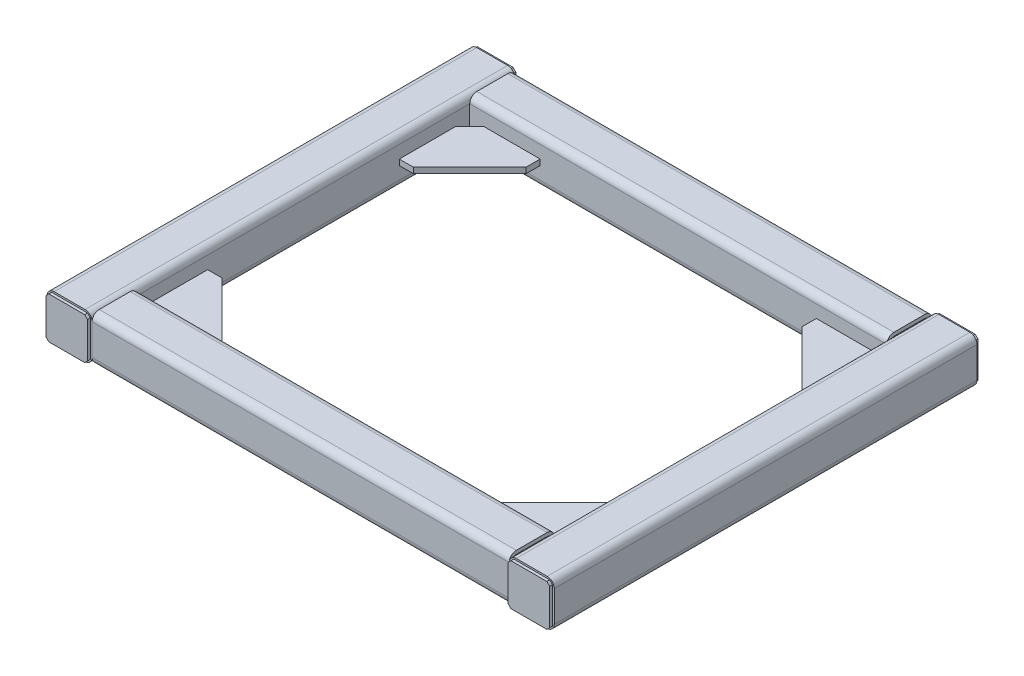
ISO-10303-21;
HEADER;
FILE_DESCRIPTION(('STEP AP214'),'2;1');
FILE_NAME('part.step','',(''),(''),'','','');
FILE_SCHEMA(('AUTOMOTIVE_DESIGN { 1 0 10303 214 1 1 1 1 }'));
ENDSEC;
DATA;
#1=APPLICATION_CONTEXT('core data for automotive mechanical design processes');
#2=APPLICATION_PROTOCOL_DEFINITION('international standard','automotive_design',2000,#1);
#3=PRODUCT_CONTEXT('',#1,'mechanical');
#4=PRODUCT('Part','Part','',(#3));
#5=PRODUCT_RELATED_PRODUCT_CATEGORY('part','',(#4));
#6=PRODUCT_DEFINITION_FORMATION('','',#4);
#7=PRODUCT_DEFINITION_CONTEXT('part definition',#1,'design');
#8=PRODUCT_DEFINITION('design','',#6,#7);
#9=PRODUCT_DEFINITION_SHAPE('','',#8);
#10=(LENGTH_UNIT() NAMED_UNIT(*) SI_UNIT(.MILLI.,.METRE.));
#11=(NAMED_UNIT(*) PLANE_ANGLE_UNIT() SI_UNIT($,.RADIAN.));
#12=(NAMED_UNIT(*) SI_UNIT($,.STERADIAN.) SOLID_ANGLE_UNIT());
#13=UNCERTAINTY_MEASURE_WITH_UNIT(LENGTH_MEASURE(1.E-05),#10,'distance_accuracy_value','');
#14=(GEOMETRIC_REPRESENTATION_CONTEXT(3) GLOBAL_UNCERTAINTY_ASSIGNED_CONTEXT((#13)) GLOBAL_UNIT_ASSIGNED_CONTEXT((#10,
#11,#12)) REPRESENTATION_CONTEXT('',''));
#15=CARTESIAN_POINT('',(0.,0.,0.));
#16=DIRECTION('',(0.,0.,1.));
#17=DIRECTION('',(1.,0.,0.));
#18=AXIS2_PLACEMENT_3D('',#15,#16,#17);
#19=CARTESIAN_POINT('',(-450.,487.4,307.6));
#20=DIRECTION('',(1.,0.,0.));
#21=DIRECTION('',(0.,0.,-1.));
#22=AXIS2_PLACEMENT_3D('',#19,#20,#21);
#23=CYLINDRICAL_SURFACE('',#22,6.3);
#24=DIRECTION('',(1.,0.,0.));
#25=VECTOR('',#24,1.);
#26=CARTESIAN_POINT('',(-450.,487.4,301.3));
#27=LINE('',#26,#25);
#28=CARTESIAN_POINT('',(-370.,487.4,301.3));
#29=VERTEX_POINT('',#28);
#30=CARTESIAN_POINT('',(370.,487.4,301.3));
#31=VERTEX_POINT('',#30);
#32=EDGE_CURVE('E198',#29,#31,#27,.T.);
#33=ORIENTED_EDGE('',*,*,#32,.T.);
#34=CARTESIAN_POINT('',(370.,487.4,307.6));
#35=DIRECTION('',(1.,0.,0.));
#36=DIRECTION('',(0.,1.,0.));
#37=AXIS2_PLACEMENT_3D('',#34,#35,#36);
#38=CIRCLE('',#37,6.3);
#39=CARTESIAN_POINT('',(370.,493.7,307.6));
#40=VERTEX_POINT('',#39);
#41=EDGE_CURVE('E290',#31,#40,#38,.T.);
#42=ORIENTED_EDGE('',*,*,#41,.T.);
#43=DIRECTION('',(1.,0.,0.));
#44=VECTOR('',#43,1.);
#45=CARTESIAN_POINT('',(-450.,493.7,307.6));
#46=LINE('',#45,#44);
#47=CARTESIAN_POINT('',(-370.,493.7,307.6));
#48=VERTEX_POINT('',#47);
#49=EDGE_CURVE('E220',#48,#40,#46,.T.);
#50=ORIENTED_EDGE('',*,*,#49,.F.);
#51=CARTESIAN_POINT('',(-370.,487.4,307.6));
#52=DIRECTION('',(-1.,0.,0.));
#53=DIRECTION('',(0.,-1.,0.));
#54=AXIS2_PLACEMENT_3D('',#51,#52,#53);
#55=CIRCLE('',#54,6.3);
#56=EDGE_CURVE('E243',#48,#29,#55,.T.);
#57=ORIENTED_EDGE('',*,*,#56,.T.);
#58=EDGE_LOOP('',(#33,#42,#50,#57));
#59=FACE_BOUND('',#58,.T.);
#60=ADVANCED_FACE('F45',(#59),#23,.F.);
#61=CARTESIAN_POINT('',(-450.,493.7,362.4));
#62=DIRECTION('',(0.,-1.,0.));
#63=DIRECTION('',(0.,0.,-1.));
#64=AXIS2_PLACEMENT_3D('',#61,#62,#63);
#65=PLANE('',#64);
#66=ORIENTED_EDGE('',*,*,#49,.T.);
#67=DIRECTION('',(0.,0.,1.));
#68=VECTOR('',#67,1.);
#69=CARTESIAN_POINT('',(370.,493.7,362.4));
#70=LINE('',#69,#68);
#71=CARTESIAN_POINT('',(370.,493.7,362.4));
#72=VERTEX_POINT('',#71);
#73=EDGE_CURVE('E59',#40,#72,#70,.T.);
#74=ORIENTED_EDGE('',*,*,#73,.T.);
#75=DIRECTION('',(1.,0.,0.));
#76=VECTOR('',#75,1.);
#77=CARTESIAN_POINT('',(-450.,493.7,362.4));
#78=LINE('',#77,#76);
#79=CARTESIAN_POINT('',(-370.,493.7,362.4));
#80=VERTEX_POINT('',#79);
#81=EDGE_CURVE('E217',#80,#72,#78,.T.);
#82=ORIENTED_EDGE('',*,*,#81,.F.);
#83=DIRECTION('',(0.,0.,-1.));
#84=VECTOR('',#83,1.);
#85=CARTESIAN_POINT('',(-370.,493.7,362.4));
#86=LINE('',#85,#84);
#87=EDGE_CURVE('E246',#80,#48,#86,.T.);
#88=ORIENTED_EDGE('',*,*,#87,.T.);
#89=EDGE_LOOP('',(#66,#74,#82,#88));
#90=FACE_BOUND('',#89,.T.);
#91=ADVANCED_FACE('F323',(#90),#65,.T.);
#92=CARTESIAN_POINT('',(-450.,487.4,362.4));
#93=DIRECTION('',(1.,0.,0.));
#94=DIRECTION('',(0.,0.,-1.));
#95=AXIS2_PLACEMENT_3D('',#92,#93,#94);
#96=CYLINDRICAL_SURFACE('',#95,6.29999999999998);
#97=ORIENTED_EDGE('',*,*,#81,.T.);
#98=CARTESIAN_POINT('',(370.,487.4,362.4));
#99=DIRECTION('',(1.,0.,0.));
#100=DIRECTION('',(0.,1.,0.));
#101=AXIS2_PLACEMENT_3D('',#98,#99,#100);
#102=CIRCLE('',#101,6.29999999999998);
#103=CARTESIAN_POINT('',(370.,487.4,368.7));
#104=VERTEX_POINT('',#103);
#105=EDGE_CURVE('E286',#72,#104,#102,.T.);
#106=ORIENTED_EDGE('',*,*,#105,.T.);
#107=DIRECTION('',(1.,0.,0.));
#108=VECTOR('',#107,1.);
#109=CARTESIAN_POINT('',(-450.,487.4,368.7));
#110=LINE('',#109,#108);
#111=CARTESIAN_POINT('',(-370.,487.4,368.7));
#112=VERTEX_POINT('',#111);
#113=EDGE_CURVE('E214',#112,#104,#110,.T.);
#114=ORIENTED_EDGE('',*,*,#113,.F.);
#115=CARTESIAN_POINT('',(-370.,487.4,362.4));
#116=DIRECTION('',(-1.,0.,0.));
#117=DIRECTION('',(0.,-1.,0.));
#118=AXIS2_PLACEMENT_3D('',#115,#116,#117);
#119=CIRCLE('',#118,6.29999999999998);
#120=EDGE_CURVE('E249',#112,#80,#119,.T.);
#121=ORIENTED_EDGE('',*,*,#120,.T.);
#122=EDGE_LOOP('',(#97,#106,#114,#121));
#123=FACE_BOUND('',#122,.T.);
#124=ADVANCED_FACE('F328',(#123),#96,.F.);
#125=CARTESIAN_POINT('',(-450.,487.4,368.7));
#126=DIRECTION('',(0.,0.,-1.));
#127=DIRECTION('',(0.,1.,0.));
#128=AXIS2_PLACEMENT_3D('',#125,#126,#127);
#129=PLANE('',#128);
#130=ORIENTED_EDGE('',*,*,#113,.T.);
#131=DIRECTION('',(0.,-1.,0.));
#132=VECTOR('',#131,1.);
#133=CARTESIAN_POINT('',(370.,487.4,368.7));
#134=LINE('',#133,#132);
#135=CARTESIAN_POINT('',(370.,432.6,368.7));
#136=VERTEX_POINT('',#135);
#137=EDGE_CURVE('E283',#104,#136,#134,.T.);
#138=ORIENTED_EDGE('',*,*,#137,.T.);
#139=DIRECTION('',(1.,0.,0.));
#140=VECTOR('',#139,1.);
#141=CARTESIAN_POINT('',(-450.,432.6,368.7));
#142=LINE('',#141,#140);
#143=CARTESIAN_POINT('',(-370.,432.6,368.7));
#144=VERTEX_POINT('',#143);
#145=EDGE_CURVE('E211',#144,#136,#142,.T.);
#146=ORIENTED_EDGE('',*,*,#145,.F.);
#147=DIRECTION('',(0.,1.,0.));
#148=VECTOR('',#147,1.);
#149=CARTESIAN_POINT('',(-370.,487.4,368.7));
#150=LINE('',#149,#148);
#151=EDGE_CURVE('E252',#144,#112,#150,.T.);
#152=ORIENTED_EDGE('',*,*,#151,.T.);
#153=EDGE_LOOP('',(#130,#138,#146,#152));
#154=FACE_BOUND('',#153,.T.);
#155=ADVANCED_FACE('F345',(#154),#129,.T.);
#156=CARTESIAN_POINT('',(-450.,432.6,362.4));
#157=DIRECTION('',(1.,0.,0.));
#158=DIRECTION('',(0.,0.,-1.));
#159=AXIS2_PLACEMENT_3D('',#156,#157,#158);
#160=CYLINDRICAL_SURFACE('',#159,6.30000000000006);
#161=ORIENTED_EDGE('',*,*,#145,.T.);
#162=CARTESIAN_POINT('',(370.,432.6,362.4));
#163=DIRECTION('',(1.,0.,0.));
#164=DIRECTION('',(0.,1.,0.));
#165=AXIS2_PLACEMENT_3D('',#162,#163,#164);
#166=CIRCLE('',#165,6.30000000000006);
#167=CARTESIAN_POINT('',(370.,426.3,362.4));
#168=VERTEX_POINT('',#167);
#169=EDGE_CURVE('E280',#136,#168,#166,.T.);
#170=ORIENTED_EDGE('',*,*,#169,.T.);
#171=DIRECTION('',(1.,0.,0.));
#172=VECTOR('',#171,1.);
#173=CARTESIAN_POINT('',(-450.,426.3,362.4));
#174=LINE('',#173,#172);
#175=CARTESIAN_POINT('',(-370.,426.3,362.400000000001));
#176=VERTEX_POINT('',#175);
#177=EDGE_CURVE('E208',#176,#168,#174,.T.);
#178=ORIENTED_EDGE('',*,*,#177,.F.);
#179=CARTESIAN_POINT('',(-370.,432.6,362.4));
#180=DIRECTION('',(-1.,0.,0.));
#181=DIRECTION('',(0.,-1.,0.));
#182=AXIS2_PLACEMENT_3D('',#179,#180,#181);
#183=CIRCLE('',#182,6.30000000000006);
#184=EDGE_CURVE('E255',#176,#144,#183,.T.);
#185=ORIENTED_EDGE('',*,*,#184,.T.);
#186=EDGE_LOOP('',(#161,#170,#178,#185));
#187=FACE_BOUND('',#186,.T.);
#188=ADVANCED_FACE('F342',(#187),#160,.F.);
#189=CARTESIAN_POINT('',(-450.,426.3,307.6));
#190=DIRECTION('',(0.,1.,0.));
#191=DIRECTION('',(0.,0.,1.));
#192=AXIS2_PLACEMENT_3D('',#189,#190,#191);
#193=PLANE('',#192);
#194=ORIENTED_EDGE('',*,*,#177,.T.);
#195=DIRECTION('',(0.,0.,-1.));
#196=VECTOR('',#195,1.);
#197=CARTESIAN_POINT('',(370.,426.3,307.6));
#198=LINE('',#197,#196);
#199=CARTESIAN_POINT('',(370.,426.3,307.6));
#200=VERTEX_POINT('',#199);
#201=EDGE_CURVE('E277',#168,#200,#198,.T.);
#202=ORIENTED_EDGE('',*,*,#201,.T.);
#203=DIRECTION('',(1.,0.,0.));
#204=VECTOR('',#203,1.);
#205=CARTESIAN_POINT('',(-450.,426.3,307.6));
#206=LINE('',#205,#204);
#207=CARTESIAN_POINT('',(-370.,426.3,307.6));
#208=VERTEX_POINT('',#207);
#209=EDGE_CURVE('E205',#208,#200,#206,.T.);
#210=ORIENTED_EDGE('',*,*,#209,.F.);
#211=DIRECTION('',(0.,0.,1.));
#212=VECTOR('',#211,1.);
#213=CARTESIAN_POINT('',(-370.,426.3,307.6));
#214=LINE('',#213,#212);
#215=EDGE_CURVE('E258',#208,#176,#214,.T.);
#216=ORIENTED_EDGE('',*,*,#215,.T.);
#217=EDGE_LOOP('',(#194,#202,#210,#216));
#218=FACE_BOUND('',#217,.T.);
#219=ADVANCED_FACE('F339',(#218),#193,.T.);
#220=CARTESIAN_POINT('',(-450.,432.6,307.6));
#221=DIRECTION('',(1.,0.,0.));
#222=DIRECTION('',(0.,0.,-1.));
#223=AXIS2_PLACEMENT_3D('',#220,#221,#222);
#224=CYLINDRICAL_SURFACE('',#223,6.3);
#225=ORIENTED_EDGE('',*,*,#209,.T.);
#226=CARTESIAN_POINT('',(370.,432.6,307.6));
#227=DIRECTION('',(1.,0.,0.));
#228=DIRECTION('',(0.,1.,0.));
#229=AXIS2_PLACEMENT_3D('',#226,#227,#228);
#230=CIRCLE('',#229,6.3);
#231=CARTESIAN_POINT('',(370.,432.6,301.3));
#232=VERTEX_POINT('',#231);
#233=EDGE_CURVE('E274',#200,#232,#230,.T.);
#234=ORIENTED_EDGE('',*,*,#233,.T.);
#235=DIRECTION('',(1.,0.,0.));
#236=VECTOR('',#235,1.);
#237=CARTESIAN_POINT('',(-450.,432.6,301.3));
#238=LINE('',#237,#236);
#239=CARTESIAN_POINT('',(-370.,432.6,301.3));
#240=VERTEX_POINT('',#239);
#241=EDGE_CURVE('E201',#240,#232,#238,.T.);
#242=ORIENTED_EDGE('',*,*,#241,.F.);
#243=CARTESIAN_POINT('',(-370.,432.6,307.6));
#244=DIRECTION('',(-1.,0.,0.));
#245=DIRECTION('',(0.,-1.,0.));
#246=AXIS2_PLACEMENT_3D('',#243,#244,#245);
#247=CIRCLE('',#246,6.3);
#248=EDGE_CURVE('E261',#240,#208,#247,.T.);
#249=ORIENTED_EDGE('',*,*,#248,.T.);
#250=EDGE_LOOP('',(#225,#234,#242,#249));
#251=FACE_BOUND('',#250,.T.);
#252=ADVANCED_FACE('F336',(#251),#224,.F.);
#253=CARTESIAN_POINT('',(-450.,432.6,301.3));
#254=DIRECTION('',(0.,0.,1.));
#255=DIRECTION('',(0.,-1.,0.));
#256=AXIS2_PLACEMENT_3D('',#253,#254,#255);
#257=PLANE('',#256);
#258=ORIENTED_EDGE('',*,*,#241,.T.);
#259=DIRECTION('',(0.,1.,0.));
#260=VECTOR('',#259,1.);
#261=CARTESIAN_POINT('',(370.,432.6,301.3));
#262=LINE('',#261,#260);
#263=EDGE_CURVE('E271',#232,#31,#262,.T.);
#264=ORIENTED_EDGE('',*,*,#263,.T.);
#265=ORIENTED_EDGE('',*,*,#32,.F.);
#266=DIRECTION('',(0.,-1.,0.));
#267=VECTOR('',#266,1.);
#268=CARTESIAN_POINT('',(-370.,432.6,301.3));
#269=LINE('',#268,#267);
#270=EDGE_CURVE('E234',#29,#240,#269,.T.);
#271=ORIENTED_EDGE('',*,*,#270,.T.);
#272=EDGE_LOOP('',(#258,#264,#265,#271));
#273=FACE_BOUND('',#272,.T.);
#274=ADVANCED_FACE('F333',(#273),#257,.T.);
#275=CARTESIAN_POINT('',(-370.,432.6,-375.));
#276=DIRECTION('',(-1.,0.,0.));
#277=DIRECTION('',(0.,-1.,0.));
#278=AXIS2_PLACEMENT_3D('',#275,#276,#277);
#279=PLANE('',#278);
#280=ORIENTED_EDGE('',*,*,#87,.F.);
#281=ORIENTED_EDGE('',*,*,#120,.F.);
#282=ORIENTED_EDGE('',*,*,#151,.F.);
#283=ORIENTED_EDGE('',*,*,#184,.F.);
#284=ORIENTED_EDGE('',*,*,#215,.F.);
#285=ORIENTED_EDGE('',*,*,#248,.F.);
#286=ORIENTED_EDGE('',*,*,#270,.F.);
#287=ORIENTED_EDGE('',*,*,#56,.F.);
#288=EDGE_LOOP('',(#280,#281,#282,#283,#284,#285,#286,#287));
#289=FACE_BOUND('',#288,.T.);
#290=CARTESIAN_POINT('',(-370.,487.4,307.6));
#291=DIRECTION('',(-1.,0.,0.));
#292=DIRECTION('',(0.,-1.,0.));
#293=AXIS2_PLACEMENT_3D('',#290,#291,#292);
#294=CIRCLE('',#293,12.6);
#295=CARTESIAN_POINT('',(-370.,500.,307.6));
#296=VERTEX_POINT('',#295);
#297=CARTESIAN_POINT('',(-370.,487.4,295.));
#298=VERTEX_POINT('',#297);
#299=EDGE_CURVE('E202',#296,#298,#294,.T.);
#300=ORIENTED_EDGE('',*,*,#299,.T.);
#301=DIRECTION('',(0.,-1.,0.));
#302=VECTOR('',#301,1.);
#303=CARTESIAN_POINT('',(-370.,432.6,295.));
#304=LINE('',#303,#302);
#305=CARTESIAN_POINT('',(-370.,432.6,295.));
#306=VERTEX_POINT('',#305);
#307=EDGE_CURVE('E239',#298,#306,#304,.T.);
#308=ORIENTED_EDGE('',*,*,#307,.T.);
#309=CARTESIAN_POINT('',(-370.,432.6,307.6));
#310=DIRECTION('',(-1.,0.,0.));
#311=DIRECTION('',(0.,-1.,0.));
#312=AXIS2_PLACEMENT_3D('',#309,#310,#311);
#313=CIRCLE('',#312,12.6);
#314=CARTESIAN_POINT('',(-370.,420.,307.6));
#315=VERTEX_POINT('',#314);
#316=EDGE_CURVE('E241',#306,#315,#313,.T.);
#317=ORIENTED_EDGE('',*,*,#316,.T.);
#318=DIRECTION('',(0.,0.,1.));
#319=VECTOR('',#318,1.);
#320=CARTESIAN_POINT('',(-370.,420.,-375.));
#321=LINE('',#320,#319);
#322=CARTESIAN_POINT('',(-370.,420.,362.4));
#323=VERTEX_POINT('',#322);
#324=EDGE_CURVE('E269',#315,#323,#321,.T.);
#325=ORIENTED_EDGE('',*,*,#324,.T.);
#326=CARTESIAN_POINT('',(-370.,432.6,362.4));
#327=DIRECTION('',(-1.,0.,0.));
#328=DIRECTION('',(0.,-1.,0.));
#329=AXIS2_PLACEMENT_3D('',#326,#327,#328);
#330=CIRCLE('',#329,12.6);
#331=CARTESIAN_POINT('',(-370.,432.6,375.));
#332=VERTEX_POINT('',#331);
#333=EDGE_CURVE('E178',#323,#332,#330,.T.);
#334=ORIENTED_EDGE('',*,*,#333,.T.);
#335=DIRECTION('',(0.,1.,0.));
#336=VECTOR('',#335,1.);
#337=CARTESIAN_POINT('',(-370.,487.4,375.));
#338=LINE('',#337,#336);
#339=CARTESIAN_POINT('',(-370.,487.4,375.));
#340=VERTEX_POINT('',#339);
#341=EDGE_CURVE('E52',#332,#340,#338,.T.);
#342=ORIENTED_EDGE('',*,*,#341,.T.);
#343=CARTESIAN_POINT('',(-370.,487.4,362.4));
#344=DIRECTION('',(-1.,0.,0.));
#345=DIRECTION('',(0.,-1.,0.));
#346=AXIS2_PLACEMENT_3D('',#343,#344,#345);
#347=CIRCLE('',#346,12.6);
#348=CARTESIAN_POINT('',(-370.,500.,362.400000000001));
#349=VERTEX_POINT('',#348);
#350=EDGE_CURVE('E226',#340,#349,#347,.T.);
#351=ORIENTED_EDGE('',*,*,#350,.T.);
#352=DIRECTION('',(0.,0.,1.));
#353=VECTOR('',#352,1.);
#354=CARTESIAN_POINT('',(-370.,500.,-375.));
#355=LINE('',#354,#353);
#356=EDGE_CURVE('E267',#296,#349,#355,.T.);
#357=ORIENTED_EDGE('',*,*,#356,.F.);
#358=EDGE_LOOP('',(#300,#308,#317,#325,#334,#342,#351,#357));
#359=FACE_BOUND('',#358,.T.);
#360=ADVANCED_FACE('F225',(#289,#359),#279,.T.);
#361=CARTESIAN_POINT('',(-450.,487.4,362.4));
#362=DIRECTION('',(1.,0.,0.));
#363=DIRECTION('',(0.,0.,-1.));
#364=AXIS2_PLACEMENT_3D('',#361,#362,#363);
#365=CYLINDRICAL_SURFACE('',#364,12.6);
#366=CARTESIAN_POINT('',(370.,487.4,362.4));
#367=DIRECTION('',(1.,0.,0.));
#368=DIRECTION('',(0.,1.,0.));
#369=AXIS2_PLACEMENT_3D('',#366,#367,#368);
#370=CIRCLE('',#369,12.6);
#371=CARTESIAN_POINT('',(370.,500.,362.4));
#372=VERTEX_POINT('',#371);
#373=CARTESIAN_POINT('',(370.,487.4,375.));
#374=VERTEX_POINT('',#373);
#375=EDGE_CURVE('E12',#372,#374,#370,.T.);
#376=ORIENTED_EDGE('',*,*,#375,.F.);
#377=DIRECTION('',(1.,0.,0.));
#378=VECTOR('',#377,1.);
#379=CARTESIAN_POINT('',(-450.,500.,362.4));
#380=LINE('',#379,#378);
#381=EDGE_CURVE('E195',#349,#372,#380,.T.);
#382=ORIENTED_EDGE('',*,*,#381,.F.);
#383=ORIENTED_EDGE('',*,*,#350,.F.);
#384=DIRECTION('',(1.,0.,0.));
#385=VECTOR('',#384,1.);
#386=CARTESIAN_POINT('',(-450.,487.4,375.));
#387=LINE('',#386,#385);
#388=EDGE_CURVE('E183',#340,#374,#387,.T.);
#389=ORIENTED_EDGE('',*,*,#388,.T.);
#390=EDGE_LOOP('',(#376,#382,#383,#389));
#391=FACE_BOUND('',#390,.T.);
#392=ADVANCED_FACE('F233',(#391),#365,.T.);
#393=CARTESIAN_POINT('',(-450.,500.,362.4));
#394=DIRECTION('',(0.,-1.,0.));
#395=DIRECTION('',(0.,0.,-1.));
#396=AXIS2_PLACEMENT_3D('',#393,#394,#395);
#397=PLANE('',#396);
#398=DIRECTION('',(0.,0.,-1.));
#399=VECTOR('',#398,1.);
#400=CARTESIAN_POINT('',(370.,500.,375.));
#401=LINE('',#400,#399);
#402=CARTESIAN_POINT('',(370.,500.,307.6));
#403=VERTEX_POINT('',#402);
#404=EDGE_CURVE('E66',#372,#403,#401,.T.);
#405=ORIENTED_EDGE('',*,*,#404,.T.);
#406=DIRECTION('',(1.,0.,0.));
#407=VECTOR('',#406,1.);
#408=CARTESIAN_POINT('',(-450.,500.,307.6));
#409=LINE('',#408,#407);
#410=EDGE_CURVE('E192',#296,#403,#409,.T.);
#411=ORIENTED_EDGE('',*,*,#410,.F.);
#412=ORIENTED_EDGE('',*,*,#356,.T.);
#413=ORIENTED_EDGE('',*,*,#381,.T.);
#414=EDGE_LOOP('',(#405,#411,#412,#413));
#415=FACE_BOUND('',#414,.T.);
#416=ADVANCED_FACE('F300',(#415),#397,.F.);
#417=CARTESIAN_POINT('',(-450.,487.4,307.6));
#418=DIRECTION('',(1.,0.,0.));
#419=DIRECTION('',(0.,0.,-1.));
#420=AXIS2_PLACEMENT_3D('',#417,#418,#419);
#421=CYLINDRICAL_SURFACE('',#420,12.6);
#422=CARTESIAN_POINT('',(370.,487.4,307.6));
#423=DIRECTION('',(1.,0.,0.));
#424=DIRECTION('',(0.,1.,0.));
#425=AXIS2_PLACEMENT_3D('',#422,#423,#424);
#426=CIRCLE('',#425,12.6);
#427=CARTESIAN_POINT('',(370.,487.4,295.));
#428=VERTEX_POINT('',#427);
#429=EDGE_CURVE('E165',#428,#403,#426,.T.);
#430=ORIENTED_EDGE('',*,*,#429,.F.);
#431=DIRECTION('',(1.,0.,0.));
#432=VECTOR('',#431,1.);
#433=CARTESIAN_POINT('',(-450.,487.4,295.));
#434=LINE('',#433,#432);
#435=EDGE_CURVE('E189',#298,#428,#434,.T.);
#436=ORIENTED_EDGE('',*,*,#435,.F.);
#437=ORIENTED_EDGE('',*,*,#299,.F.);
#438=ORIENTED_EDGE('',*,*,#410,.T.);
#439=EDGE_LOOP('',(#430,#436,#437,#438));
#440=FACE_BOUND('',#439,.T.);
#441=ADVANCED_FACE('F304',(#440),#421,.T.);
#442=CARTESIAN_POINT('',(-450.,432.6,295.));
#443=DIRECTION('',(0.,0.,1.));
#444=DIRECTION('',(0.,-1.,0.));
#445=AXIS2_PLACEMENT_3D('',#442,#443,#444);
#446=PLANE('',#445);
#447=DIRECTION('',(0.,1.,0.));
#448=VECTOR('',#447,1.);
#449=CARTESIAN_POINT('',(370.,432.6,295.));
#450=LINE('',#449,#448);
#451=CARTESIAN_POINT('',(370.,432.6,295.));
#452=VERTEX_POINT('',#451);
#453=EDGE_CURVE('E294',#452,#428,#450,.T.);
#454=ORIENTED_EDGE('',*,*,#453,.F.);
#455=DIRECTION('',(1.,0.,0.));
#456=VECTOR('',#455,1.);
#457=CARTESIAN_POINT('',(-450.,432.6,295.));
#458=LINE('',#457,#456);
#459=EDGE_CURVE('E181',#306,#452,#458,.T.);
#460=ORIENTED_EDGE('',*,*,#459,.F.);
#461=ORIENTED_EDGE('',*,*,#307,.F.);
#462=ORIENTED_EDGE('',*,*,#435,.T.);
#463=EDGE_LOOP('',(#454,#460,#461,#462));
#464=FACE_BOUND('',#463,.T.);
#465=ADVANCED_FACE('F311',(#464),#446,.F.);
#466=CARTESIAN_POINT('',(-450.,432.6,307.6));
#467=DIRECTION('',(1.,0.,0.));
#468=DIRECTION('',(0.,0.,-1.));
#469=AXIS2_PLACEMENT_3D('',#466,#467,#468);
#470=CYLINDRICAL_SURFACE('',#469,12.6);
#471=CARTESIAN_POINT('',(370.,432.6,307.6));
#472=DIRECTION('',(1.,0.,0.));
#473=DIRECTION('',(0.,1.,0.));
#474=AXIS2_PLACEMENT_3D('',#471,#472,#473);
#475=CIRCLE('',#474,12.6);
#476=CARTESIAN_POINT('',(370.,420.,307.6));
#477=VERTEX_POINT('',#476);
#478=EDGE_CURVE('E292',#477,#452,#475,.T.);
#479=ORIENTED_EDGE('',*,*,#478,.F.);
#480=DIRECTION('',(1.,0.,0.));
#481=VECTOR('',#480,1.);
#482=CARTESIAN_POINT('',(-450.,420.,307.6));
#483=LINE('',#482,#481);
#484=EDGE_CURVE('E174',#315,#477,#483,.T.);
#485=ORIENTED_EDGE('',*,*,#484,.F.);
#486=ORIENTED_EDGE('',*,*,#316,.F.);
#487=ORIENTED_EDGE('',*,*,#459,.T.);
#488=EDGE_LOOP('',(#479,#485,#486,#487));
#489=FACE_BOUND('',#488,.T.);
#490=ADVANCED_FACE('F313',(#489),#470,.T.);
#491=CARTESIAN_POINT('',(-450.,420.,307.6));
#492=DIRECTION('',(0.,1.,0.));
#493=DIRECTION('',(0.,0.,1.));
#494=AXIS2_PLACEMENT_3D('',#491,#492,#493);
#495=PLANE('',#494);
#496=DIRECTION('',(0.,0.,-1.));
#497=VECTOR('',#496,1.);
#498=CARTESIAN_POINT('',(370.,420.,375.));
#499=LINE('',#498,#497);
#500=CARTESIAN_POINT('',(370.,420.,362.4));
#501=VERTEX_POINT('',#500);
#502=EDGE_CURVE('E157',#501,#477,#499,.T.);
#503=ORIENTED_EDGE('',*,*,#502,.F.);
#504=DIRECTION('',(1.,0.,0.));
#505=VECTOR('',#504,1.);
#506=CARTESIAN_POINT('',(-450.,420.,362.4));
#507=LINE('',#506,#505);
#508=EDGE_CURVE('E172',#323,#501,#507,.T.);
#509=ORIENTED_EDGE('',*,*,#508,.F.);
#510=ORIENTED_EDGE('',*,*,#324,.F.);
#511=ORIENTED_EDGE('',*,*,#484,.T.);
#512=EDGE_LOOP('',(#503,#509,#510,#511));
#513=FACE_BOUND('',#512,.T.);
#514=ADVANCED_FACE('F170',(#513),#495,.F.);
#515=CARTESIAN_POINT('',(-450.,432.6,362.4));
#516=DIRECTION('',(1.,0.,0.));
#517=DIRECTION('',(0.,0.,-1.));
#518=AXIS2_PLACEMENT_3D('',#515,#516,#517);
#519=CYLINDRICAL_SURFACE('',#518,12.6);
#520=CARTESIAN_POINT('',(370.,432.6,362.4));
#521=DIRECTION('',(1.,0.,0.));
#522=DIRECTION('',(0.,1.,0.));
#523=AXIS2_PLACEMENT_3D('',#520,#521,#522);
#524=CIRCLE('',#523,12.6);
#525=CARTESIAN_POINT('',(370.,432.6,375.));
#526=VERTEX_POINT('',#525);
#527=EDGE_CURVE('E154',#526,#501,#524,.T.);
#528=ORIENTED_EDGE('',*,*,#527,.F.);
#529=DIRECTION('',(1.,0.,0.));
#530=VECTOR('',#529,1.);
#531=CARTESIAN_POINT('',(-450.,432.6,375.));
#532=LINE('',#531,#530);
#533=EDGE_CURVE('E179',#332,#526,#532,.T.);
#534=ORIENTED_EDGE('',*,*,#533,.F.);
#535=ORIENTED_EDGE('',*,*,#333,.F.);
#536=ORIENTED_EDGE('',*,*,#508,.T.);
#537=EDGE_LOOP('',(#528,#534,#535,#536));
#538=FACE_BOUND('',#537,.T.);
#539=ADVANCED_FACE('F177',(#538),#519,.T.);
#540=CARTESIAN_POINT('',(-450.,487.4,375.));
#541=DIRECTION('',(0.,0.,-1.));
#542=DIRECTION('',(0.,1.,0.));
#543=AXIS2_PLACEMENT_3D('',#540,#541,#542);
#544=PLANE('',#543);
#545=DIRECTION('',(0.,-1.,0.));
#546=VECTOR('',#545,1.);
#547=CARTESIAN_POINT('',(370.,487.4,375.));
#548=LINE('',#547,#546);
#549=EDGE_CURVE('E160',#374,#526,#548,.T.);
#550=ORIENTED_EDGE('',*,*,#549,.F.);
#551=ORIENTED_EDGE('',*,*,#388,.F.);
#552=ORIENTED_EDGE('',*,*,#341,.F.);
#553=ORIENTED_EDGE('',*,*,#533,.T.);
#554=EDGE_LOOP('',(#550,#551,#552,#553));
#555=FACE_BOUND('',#554,.T.);
#556=ADVANCED_FACE('F236',(#555),#544,.F.);
#557=CARTESIAN_POINT('',(370.,432.6,375.));
#558=DIRECTION('',(1.,0.,0.));
#559=DIRECTION('',(0.,1.,0.));
#560=AXIS2_PLACEMENT_3D('',#557,#558,#559);
#561=PLANE('',#560);
#562=ORIENTED_EDGE('',*,*,#233,.F.);
#563=ORIENTED_EDGE('',*,*,#201,.F.);
#564=ORIENTED_EDGE('',*,*,#169,.F.);
#565=ORIENTED_EDGE('',*,*,#137,.F.);
#566=ORIENTED_EDGE('',*,*,#105,.F.);
#567=ORIENTED_EDGE('',*,*,#73,.F.);
#568=ORIENTED_EDGE('',*,*,#41,.F.);
#569=ORIENTED_EDGE('',*,*,#263,.F.);
#570=EDGE_LOOP('',(#562,#563,#564,#565,#566,#567,#568,#569));
#571=FACE_BOUND('',#570,.T.);
#572=ORIENTED_EDGE('',*,*,#478,.T.);
#573=ORIENTED_EDGE('',*,*,#453,.T.);
#574=ORIENTED_EDGE('',*,*,#429,.T.);
#575=ORIENTED_EDGE('',*,*,#404,.F.);
#576=ORIENTED_EDGE('',*,*,#375,.T.);
#577=ORIENTED_EDGE('',*,*,#549,.T.);
#578=ORIENTED_EDGE('',*,*,#527,.T.);
#579=ORIENTED_EDGE('',*,*,#502,.T.);
#580=EDGE_LOOP('',(#572,#573,#574,#575,#576,#577,#578,#579));
#581=FACE_BOUND('',#580,.T.);
#582=ADVANCED_FACE('F156',(#571,#581),#561,.T.);
#583=CLOSED_SHELL('',(#60,#91,#124,#155,#188,#219,#252,#274,#360,#392,#416,#441,#465,#490,#514,
#539,#556,#582));
#584=MANIFOLD_SOLID_BREP('B2',#583);
#585=CARTESIAN_POINT('',(450.,487.4,-307.6));
#586=DIRECTION('',(-1.,0.,0.));
#587=DIRECTION('',(0.,0.,1.));
#588=AXIS2_PLACEMENT_3D('',#585,#586,#587);
#589=CYLINDRICAL_SURFACE('',#588,6.3);
#590=DIRECTION('',(-1.,0.,0.));
#591=VECTOR('',#590,1.);
#592=CARTESIAN_POINT('',(450.,493.7,-307.6));
#593=LINE('',#592,#591);
#594=CARTESIAN_POINT('',(370.,493.7,-307.6));
#595=VERTEX_POINT('',#594);
#596=CARTESIAN_POINT('',(-370.,493.7,-307.599999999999));
#597=VERTEX_POINT('',#596);
#598=EDGE_CURVE('E647',#595,#597,#593,.T.);
#599=ORIENTED_EDGE('',*,*,#598,.F.);
#600=CARTESIAN_POINT('',(370.,487.4,-307.6));
#601=DIRECTION('',(1.,0.,0.));
#602=DIRECTION('',(0.,1.,0.));
#603=AXIS2_PLACEMENT_3D('',#600,#601,#602);
#604=CIRCLE('',#603,6.3);
#605=CARTESIAN_POINT('',(370.,487.4,-301.3));
#606=VERTEX_POINT('',#605);
#607=EDGE_CURVE('E722',#595,#606,#604,.T.);
#608=ORIENTED_EDGE('',*,*,#607,.T.);
#609=DIRECTION('',(-1.,0.,0.));
#610=VECTOR('',#609,1.);
#611=CARTESIAN_POINT('',(450.,487.4,-301.3));
#612=LINE('',#611,#610);
#613=CARTESIAN_POINT('',(-370.,487.4,-301.3));
#614=VERTEX_POINT('',#613);
#615=EDGE_CURVE('E632',#606,#614,#612,.T.);
#616=ORIENTED_EDGE('',*,*,#615,.T.);
#617=CARTESIAN_POINT('',(-370.,487.4,-307.6));
#618=DIRECTION('',(-1.,0.,0.));
#619=DIRECTION('',(0.,-1.,0.));
#620=AXIS2_PLACEMENT_3D('',#617,#618,#619);
#621=CIRCLE('',#620,6.3);
#622=EDGE_CURVE('E697',#614,#597,#621,.T.);
#623=ORIENTED_EDGE('',*,*,#622,.T.);
#624=EDGE_LOOP('',(#599,#608,#616,#623));
#625=FACE_BOUND('',#624,.T.);
#626=ADVANCED_FACE('F492',(#625),#589,.F.);
#627=CARTESIAN_POINT('',(450.,493.7,-362.4));
#628=DIRECTION('',(0.,-1.,0.));
#629=DIRECTION('',(0.,0.,-1.));
#630=AXIS2_PLACEMENT_3D('',#627,#628,#629);
#631=PLANE('',#630);
#632=DIRECTION('',(-1.,0.,0.));
#633=VECTOR('',#632,1.);
#634=CARTESIAN_POINT('',(450.,493.7,-362.4));
#635=LINE('',#634,#633);
#636=CARTESIAN_POINT('',(370.,493.7,-362.4));
#637=VERTEX_POINT('',#636);
#638=CARTESIAN_POINT('',(-370.,493.7,-362.4));
#639=VERTEX_POINT('',#638);
#640=EDGE_CURVE('E645',#637,#639,#635,.T.);
#641=ORIENTED_EDGE('',*,*,#640,.F.);
#642=DIRECTION('',(0.,0.,1.));
#643=VECTOR('',#642,1.);
#644=CARTESIAN_POINT('',(370.,493.7,-362.4));
#645=LINE('',#644,#643);
#646=EDGE_CURVE('E727',#637,#595,#645,.T.);
#647=ORIENTED_EDGE('',*,*,#646,.T.);
#648=ORIENTED_EDGE('',*,*,#598,.T.);
#649=DIRECTION('',(0.,0.,-1.));
#650=VECTOR('',#649,1.);
#651=CARTESIAN_POINT('',(-370.,493.7,-362.4));
#652=LINE('',#651,#650);
#653=EDGE_CURVE('E694',#597,#639,#652,.T.);
#654=ORIENTED_EDGE('',*,*,#653,.T.);
#655=EDGE_LOOP('',(#641,#647,#648,#654));
#656=FACE_BOUND('',#655,.T.);
#657=ADVANCED_FACE('F774',(#656),#631,.T.);
#658=CARTESIAN_POINT('',(450.,487.4,-362.4));
#659=DIRECTION('',(-1.,0.,0.));
#660=DIRECTION('',(0.,0.,1.));
#661=AXIS2_PLACEMENT_3D('',#658,#659,#660);
#662=CYLINDRICAL_SURFACE('',#661,6.29999999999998);
#663=DIRECTION('',(-1.,0.,0.));
#664=VECTOR('',#663,1.);
#665=CARTESIAN_POINT('',(450.,487.4,-368.7));
#666=LINE('',#665,#664);
#667=CARTESIAN_POINT('',(370.,487.4,-368.7));
#668=VERTEX_POINT('',#667);
#669=CARTESIAN_POINT('',(-370.,487.4,-368.7));
#670=VERTEX_POINT('',#669);
#671=EDGE_CURVE('E643',#668,#670,#666,.T.);
#672=ORIENTED_EDGE('',*,*,#671,.F.);
#673=CARTESIAN_POINT('',(370.,487.4,-362.4));
#674=DIRECTION('',(1.,0.,0.));
#675=DIRECTION('',(0.,1.,0.));
#676=AXIS2_PLACEMENT_3D('',#673,#674,#675);
#677=CIRCLE('',#676,6.29999999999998);
#678=EDGE_CURVE('E730',#668,#637,#677,.T.);
#679=ORIENTED_EDGE('',*,*,#678,.T.);
#680=ORIENTED_EDGE('',*,*,#640,.T.);
#681=CARTESIAN_POINT('',(-370.,487.4,-362.4));
#682=DIRECTION('',(-1.,0.,0.));
#683=DIRECTION('',(0.,-1.,0.));
#684=AXIS2_PLACEMENT_3D('',#681,#682,#683);
#685=CIRCLE('',#684,6.29999999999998);
#686=EDGE_CURVE('E691',#639,#670,#685,.T.);
#687=ORIENTED_EDGE('',*,*,#686,.T.);
#688=EDGE_LOOP('',(#672,#679,#680,#687));
#689=FACE_BOUND('',#688,.T.);
#690=ADVANCED_FACE('F770',(#689),#662,.F.);
#691=CARTESIAN_POINT('',(450.,487.4,-368.7));
#692=DIRECTION('',(0.,0.,1.));
#693=DIRECTION('',(0.,-1.,0.));
#694=AXIS2_PLACEMENT_3D('',#691,#692,#693);
#695=PLANE('',#694);
#696=DIRECTION('',(-1.,0.,0.));
#697=VECTOR('',#696,1.);
#698=CARTESIAN_POINT('',(450.,432.6,-368.7));
#699=LINE('',#698,#697);
#700=CARTESIAN_POINT('',(370.,432.6,-368.7));
#701=VERTEX_POINT('',#700);
#702=CARTESIAN_POINT('',(-370.,432.6,-368.7));
#703=VERTEX_POINT('',#702);
#704=EDGE_CURVE('E641',#701,#703,#699,.T.);
#705=ORIENTED_EDGE('',*,*,#704,.F.);
#706=DIRECTION('',(0.,1.,0.));
#707=VECTOR('',#706,1.);
#708=CARTESIAN_POINT('',(370.,487.4,-368.7));
#709=LINE('',#708,#707);
#710=EDGE_CURVE('E733',#701,#668,#709,.T.);
#711=ORIENTED_EDGE('',*,*,#710,.T.);
#712=ORIENTED_EDGE('',*,*,#671,.T.);
#713=DIRECTION('',(0.,-1.,0.));
#714=VECTOR('',#713,1.);
#715=CARTESIAN_POINT('',(-370.,487.4,-368.7));
#716=LINE('',#715,#714);
#717=EDGE_CURVE('E688',#670,#703,#716,.T.);
#718=ORIENTED_EDGE('',*,*,#717,.T.);
#719=EDGE_LOOP('',(#705,#711,#712,#718));
#720=FACE_BOUND('',#719,.T.);
#721=ADVANCED_FACE('F767',(#720),#695,.T.);
#722=CARTESIAN_POINT('',(450.,432.6,-362.4));
#723=DIRECTION('',(-1.,0.,0.));
#724=DIRECTION('',(0.,0.,1.));
#725=AXIS2_PLACEMENT_3D('',#722,#723,#724);
#726=CYLINDRICAL_SURFACE('',#725,6.30000000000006);
#727=DIRECTION('',(-1.,0.,0.));
#728=VECTOR('',#727,1.);
#729=CARTESIAN_POINT('',(450.,426.3,-362.4));
#730=LINE('',#729,#728);
#731=CARTESIAN_POINT('',(370.,426.3,-362.4));
#732=VERTEX_POINT('',#731);
#733=CARTESIAN_POINT('',(-370.,426.3,-362.4));
#734=VERTEX_POINT('',#733);
#735=EDGE_CURVE('E639',#732,#734,#730,.T.);
#736=ORIENTED_EDGE('',*,*,#735,.F.);
#737=CARTESIAN_POINT('',(370.,432.6,-362.4));
#738=DIRECTION('',(1.,0.,0.));
#739=DIRECTION('',(0.,1.,0.));
#740=AXIS2_PLACEMENT_3D('',#737,#738,#739);
#741=CIRCLE('',#740,6.30000000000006);
#742=EDGE_CURVE('E736',#732,#701,#741,.T.);
#743=ORIENTED_EDGE('',*,*,#742,.T.);
#744=ORIENTED_EDGE('',*,*,#704,.T.);
#745=CARTESIAN_POINT('',(-370.,432.6,-362.4));
#746=DIRECTION('',(-1.,0.,0.));
#747=DIRECTION('',(0.,-1.,0.));
#748=AXIS2_PLACEMENT_3D('',#745,#746,#747);
#749=CIRCLE('',#748,6.30000000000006);
#750=EDGE_CURVE('E685',#703,#734,#749,.T.);
#751=ORIENTED_EDGE('',*,*,#750,.T.);
#752=EDGE_LOOP('',(#736,#743,#744,#751));
#753=FACE_BOUND('',#752,.T.);
#754=ADVANCED_FACE('F762',(#753),#726,.F.);
#755=CARTESIAN_POINT('',(450.,426.3,-307.6));
#756=DIRECTION('',(0.,1.,0.));
#757=DIRECTION('',(0.,0.,1.));
#758=AXIS2_PLACEMENT_3D('',#755,#756,#757);
#759=PLANE('',#758);
#760=DIRECTION('',(-1.,0.,0.));
#761=VECTOR('',#760,1.);
#762=CARTESIAN_POINT('',(450.,426.3,-307.6));
#763=LINE('',#762,#761);
#764=CARTESIAN_POINT('',(370.,426.3,-307.6));
#765=VERTEX_POINT('',#764);
#766=CARTESIAN_POINT('',(-370.,426.3,-307.6));
#767=VERTEX_POINT('',#766);
#768=EDGE_CURVE('E637',#765,#767,#763,.T.);
#769=ORIENTED_EDGE('',*,*,#768,.F.);
#770=DIRECTION('',(0.,0.,-1.));
#771=VECTOR('',#770,1.);
#772=CARTESIAN_POINT('',(370.,426.3,-307.6));
#773=LINE('',#772,#771);
#774=EDGE_CURVE('E739',#765,#732,#773,.T.);
#775=ORIENTED_EDGE('',*,*,#774,.T.);
#776=ORIENTED_EDGE('',*,*,#735,.T.);
#777=DIRECTION('',(0.,0.,1.));
#778=VECTOR('',#777,1.);
#779=CARTESIAN_POINT('',(-370.,426.3,-307.6));
#780=LINE('',#779,#778);
#781=EDGE_CURVE('E682',#734,#767,#780,.T.);
#782=ORIENTED_EDGE('',*,*,#781,.T.);
#783=EDGE_LOOP('',(#769,#775,#776,#782));
#784=FACE_BOUND('',#783,.T.);
#785=ADVANCED_FACE('F759',(#784),#759,.T.);
#786=CARTESIAN_POINT('',(450.,432.6,-307.6));
#787=DIRECTION('',(-1.,0.,0.));
#788=DIRECTION('',(0.,0.,1.));
#789=AXIS2_PLACEMENT_3D('',#786,#787,#788);
#790=CYLINDRICAL_SURFACE('',#789,6.3);
#791=DIRECTION('',(-1.,0.,0.));
#792=VECTOR('',#791,1.);
#793=CARTESIAN_POINT('',(450.,432.6,-301.3));
#794=LINE('',#793,#792);
#795=CARTESIAN_POINT('',(370.,432.6,-301.3));
#796=VERTEX_POINT('',#795);
#797=CARTESIAN_POINT('',(-370.,432.6,-301.3));
#798=VERTEX_POINT('',#797);
#799=EDGE_CURVE('E634',#796,#798,#794,.T.);
#800=ORIENTED_EDGE('',*,*,#799,.F.);
#801=CARTESIAN_POINT('',(370.,432.6,-307.6));
#802=DIRECTION('',(1.,0.,0.));
#803=DIRECTION('',(0.,1.,0.));
#804=AXIS2_PLACEMENT_3D('',#801,#802,#803);
#805=CIRCLE('',#804,6.3);
#806=EDGE_CURVE('E742',#796,#765,#805,.T.);
#807=ORIENTED_EDGE('',*,*,#806,.T.);
#808=ORIENTED_EDGE('',*,*,#768,.T.);
#809=CARTESIAN_POINT('',(-370.,432.6,-307.6));
#810=DIRECTION('',(-1.,0.,0.));
#811=DIRECTION('',(0.,-1.,0.));
#812=AXIS2_PLACEMENT_3D('',#809,#810,#811);
#813=CIRCLE('',#812,6.3);
#814=EDGE_CURVE('E679',#767,#798,#813,.T.);
#815=ORIENTED_EDGE('',*,*,#814,.T.);
#816=EDGE_LOOP('',(#800,#807,#808,#815));
#817=FACE_BOUND('',#816,.T.);
#818=ADVANCED_FACE('F751',(#817),#790,.F.);
#819=CARTESIAN_POINT('',(450.,432.6,-301.3));
#820=DIRECTION('',(0.,0.,-1.));
#821=DIRECTION('',(0.,1.,0.));
#822=AXIS2_PLACEMENT_3D('',#819,#820,#821);
#823=PLANE('',#822);
#824=ORIENTED_EDGE('',*,*,#615,.F.);
#825=DIRECTION('',(0.,-1.,0.));
#826=VECTOR('',#825,1.);
#827=CARTESIAN_POINT('',(370.,432.6,-301.3));
#828=LINE('',#827,#826);
#829=EDGE_CURVE('E506',#606,#796,#828,.T.);
#830=ORIENTED_EDGE('',*,*,#829,.T.);
#831=ORIENTED_EDGE('',*,*,#799,.T.);
#832=DIRECTION('',(0.,1.,0.));
#833=VECTOR('',#832,1.);
#834=CARTESIAN_POINT('',(-370.,432.6,-301.3));
#835=LINE('',#834,#833);
#836=EDGE_CURVE('E671',#798,#614,#835,.T.);
#837=ORIENTED_EDGE('',*,*,#836,.T.);
#838=EDGE_LOOP('',(#824,#830,#831,#837));
#839=FACE_BOUND('',#838,.T.);
#840=ADVANCED_FACE('F748',(#839),#823,.T.);
#841=CARTESIAN_POINT('',(-370.,432.6,-375.));
#842=DIRECTION('',(-1.,0.,0.));
#843=DIRECTION('',(0.,-1.,0.));
#844=AXIS2_PLACEMENT_3D('',#841,#842,#843);
#845=PLANE('',#844);
#846=ORIENTED_EDGE('',*,*,#836,.F.);
#847=ORIENTED_EDGE('',*,*,#814,.F.);
#848=ORIENTED_EDGE('',*,*,#781,.F.);
#849=ORIENTED_EDGE('',*,*,#750,.F.);
#850=ORIENTED_EDGE('',*,*,#717,.F.);
#851=ORIENTED_EDGE('',*,*,#686,.F.);
#852=ORIENTED_EDGE('',*,*,#653,.F.);
#853=ORIENTED_EDGE('',*,*,#622,.F.);
#854=EDGE_LOOP('',(#846,#847,#848,#849,#850,#851,#852,#853));
#855=FACE_BOUND('',#854,.T.);
#856=CARTESIAN_POINT('',(-370.,487.4,-307.6));
#857=DIRECTION('',(-1.,0.,0.));
#858=DIRECTION('',(0.,-1.,0.));
#859=AXIS2_PLACEMENT_3D('',#856,#857,#858);
#860=CIRCLE('',#859,12.6);
#861=CARTESIAN_POINT('',(-370.,487.4,-295.));
#862=VERTEX_POINT('',#861);
#863=CARTESIAN_POINT('',(-370.,500.,-307.6));
#864=VERTEX_POINT('',#863);
#865=EDGE_CURVE('E635',#862,#864,#860,.T.);
#866=ORIENTED_EDGE('',*,*,#865,.T.);
#867=DIRECTION('',(0.,0.,1.));
#868=VECTOR('',#867,1.);
#869=CARTESIAN_POINT('',(-370.,500.,-375.));
#870=LINE('',#869,#868);
#871=CARTESIAN_POINT('',(-370.,500.,-362.4));
#872=VERTEX_POINT('',#871);
#873=EDGE_CURVE('E624',#872,#864,#870,.T.);
#874=ORIENTED_EDGE('',*,*,#873,.F.);
#875=CARTESIAN_POINT('',(-370.,487.4,-362.4));
#876=DIRECTION('',(-1.,0.,0.));
#877=DIRECTION('',(0.,-1.,0.));
#878=AXIS2_PLACEMENT_3D('',#875,#876,#877);
#879=CIRCLE('',#878,12.6);
#880=CARTESIAN_POINT('',(-370.,487.4,-375.));
#881=VERTEX_POINT('',#880);
#882=EDGE_CURVE('E660',#872,#881,#879,.T.);
#883=ORIENTED_EDGE('',*,*,#882,.T.);
#884=DIRECTION('',(0.,-1.,0.));
#885=VECTOR('',#884,1.);
#886=CARTESIAN_POINT('',(-370.,487.4,-375.));
#887=LINE('',#886,#885);
#888=CARTESIAN_POINT('',(-370.,432.6,-375.));
#889=VERTEX_POINT('',#888);
#890=EDGE_CURVE('E499',#881,#889,#887,.T.);
#891=ORIENTED_EDGE('',*,*,#890,.T.);
#892=CARTESIAN_POINT('',(-370.,432.6,-362.4));
#893=DIRECTION('',(-1.,0.,0.));
#894=DIRECTION('',(0.,-1.,0.));
#895=AXIS2_PLACEMENT_3D('',#892,#893,#894);
#896=CIRCLE('',#895,12.6);
#897=CARTESIAN_POINT('',(-370.,420.,-362.4));
#898=VERTEX_POINT('',#897);
#899=EDGE_CURVE('E657',#889,#898,#896,.T.);
#900=ORIENTED_EDGE('',*,*,#899,.T.);
#901=DIRECTION('',(0.,0.,1.));
#902=VECTOR('',#901,1.);
#903=CARTESIAN_POINT('',(-370.,420.,-375.));
#904=LINE('',#903,#902);
#905=CARTESIAN_POINT('',(-370.,420.,-307.599999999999));
#906=VERTEX_POINT('',#905);
#907=EDGE_CURVE('E673',#898,#906,#904,.T.);
#908=ORIENTED_EDGE('',*,*,#907,.T.);
#909=CARTESIAN_POINT('',(-370.,432.6,-307.6));
#910=DIRECTION('',(-1.,0.,0.));
#911=DIRECTION('',(0.,-1.,0.));
#912=AXIS2_PLACEMENT_3D('',#909,#910,#911);
#913=CIRCLE('',#912,12.6);
#914=CARTESIAN_POINT('',(-370.,432.6,-295.));
#915=VERTEX_POINT('',#914);
#916=EDGE_CURVE('E700',#906,#915,#913,.T.);
#917=ORIENTED_EDGE('',*,*,#916,.T.);
#918=DIRECTION('',(0.,1.,0.));
#919=VECTOR('',#918,1.);
#920=CARTESIAN_POINT('',(-370.,432.6,-295.));
#921=LINE('',#920,#919);
#922=EDGE_CURVE('E703',#915,#862,#921,.T.);
#923=ORIENTED_EDGE('',*,*,#922,.T.);
#924=EDGE_LOOP('',(#866,#874,#883,#891,#900,#908,#917,#923));
#925=FACE_BOUND('',#924,.T.);
#926=ADVANCED_FACE('F655',(#855,#925),#845,.T.);
#927=CARTESIAN_POINT('',(450.,487.4,-362.4));
#928=DIRECTION('',(-1.,0.,0.));
#929=DIRECTION('',(0.,0.,1.));
#930=AXIS2_PLACEMENT_3D('',#927,#928,#929);
#931=CYLINDRICAL_SURFACE('',#930,12.6);
#932=CARTESIAN_POINT('',(370.,487.4,-362.4));
#933=DIRECTION('',(1.,0.,0.));
#934=DIRECTION('',(0.,1.,0.));
#935=AXIS2_PLACEMENT_3D('',#932,#933,#934);
#936=CIRCLE('',#935,12.6);
#937=CARTESIAN_POINT('',(370.,487.4,-375.));
#938=VERTEX_POINT('',#937);
#939=CARTESIAN_POINT('',(370.,500.,-362.4));
#940=VERTEX_POINT('',#939);
#941=EDGE_CURVE('E43',#938,#940,#936,.T.);
#942=ORIENTED_EDGE('',*,*,#941,.F.);
#943=DIRECTION('',(-1.,0.,0.));
#944=VECTOR('',#943,1.);
#945=CARTESIAN_POINT('',(450.,487.4,-375.));
#946=LINE('',#945,#944);
#947=EDGE_CURVE('E648',#938,#881,#946,.T.);
#948=ORIENTED_EDGE('',*,*,#947,.T.);
#949=ORIENTED_EDGE('',*,*,#882,.F.);
#950=DIRECTION('',(-1.,0.,0.));
#951=VECTOR('',#950,1.);
#952=CARTESIAN_POINT('',(450.,500.,-362.4));
#953=LINE('',#952,#951);
#954=EDGE_CURVE('E625',#940,#872,#953,.T.);
#955=ORIENTED_EDGE('',*,*,#954,.F.);
#956=EDGE_LOOP('',(#942,#948,#949,#955));
#957=FACE_BOUND('',#956,.T.);
#958=ADVANCED_FACE('F804',(#957),#931,.T.);
#959=CARTESIAN_POINT('',(450.,500.,-362.4));
#960=DIRECTION('',(0.,-1.,0.));
#961=DIRECTION('',(0.,0.,-1.));
#962=AXIS2_PLACEMENT_3D('',#959,#960,#961);
#963=PLANE('',#962);
#964=DIRECTION('',(0.,0.,-1.));
#965=VECTOR('',#964,1.);
#966=CARTESIAN_POINT('',(370.,500.,375.));
#967=LINE('',#966,#965);
#968=CARTESIAN_POINT('',(370.,500.,-307.6));
#969=VERTEX_POINT('',#968);
#970=EDGE_CURVE('E601',#969,#940,#967,.T.);
#971=ORIENTED_EDGE('',*,*,#970,.T.);
#972=ORIENTED_EDGE('',*,*,#954,.T.);
#973=ORIENTED_EDGE('',*,*,#873,.T.);
#974=DIRECTION('',(-1.,0.,0.));
#975=VECTOR('',#974,1.);
#976=CARTESIAN_POINT('',(450.,500.,-307.6));
#977=LINE('',#976,#975);
#978=EDGE_CURVE('E615',#969,#864,#977,.T.);
#979=ORIENTED_EDGE('',*,*,#978,.F.);
#980=EDGE_LOOP('',(#971,#972,#973,#979));
#981=FACE_BOUND('',#980,.T.);
#982=ADVANCED_FACE('F622',(#981),#963,.F.);
#983=CARTESIAN_POINT('',(450.,487.4,-307.6));
#984=DIRECTION('',(-1.,0.,0.));
#985=DIRECTION('',(0.,0.,1.));
#986=AXIS2_PLACEMENT_3D('',#983,#984,#985);
#987=CYLINDRICAL_SURFACE('',#986,12.6);
#988=CARTESIAN_POINT('',(370.,487.4,-307.6));
#989=DIRECTION('',(1.,0.,0.));
#990=DIRECTION('',(0.,1.,0.));
#991=AXIS2_PLACEMENT_3D('',#988,#989,#990);
#992=CIRCLE('',#991,12.6);
#993=CARTESIAN_POINT('',(370.,487.4,-295.));
#994=VERTEX_POINT('',#993);
#995=EDGE_CURVE('E604',#969,#994,#992,.T.);
#996=ORIENTED_EDGE('',*,*,#995,.F.);
#997=ORIENTED_EDGE('',*,*,#978,.T.);
#998=ORIENTED_EDGE('',*,*,#865,.F.);
#999=DIRECTION('',(-1.,0.,0.));
#1000=VECTOR('',#999,1.);
#1001=CARTESIAN_POINT('',(450.,487.4,-295.));
#1002=LINE('',#1001,#1000);
#1003=EDGE_CURVE('E617',#994,#862,#1002,.T.);
#1004=ORIENTED_EDGE('',*,*,#1003,.F.);
#1005=EDGE_LOOP('',(#996,#997,#998,#1004));
#1006=FACE_BOUND('',#1005,.T.);
#1007=ADVANCED_FACE('F613',(#1006),#987,.T.);
#1008=CARTESIAN_POINT('',(450.,432.6,-295.));
#1009=DIRECTION('',(0.,0.,-1.));
#1010=DIRECTION('',(0.,1.,0.));
#1011=AXIS2_PLACEMENT_3D('',#1008,#1009,#1010);
#1012=PLANE('',#1011);
#1013=DIRECTION('',(0.,-1.,0.));
#1014=VECTOR('',#1013,1.);
#1015=CARTESIAN_POINT('',(370.,432.6,-295.));
#1016=LINE('',#1015,#1014);
#1017=CARTESIAN_POINT('',(370.,432.6,-295.));
#1018=VERTEX_POINT('',#1017);
#1019=EDGE_CURVE('E618',#994,#1018,#1016,.T.);
#1020=ORIENTED_EDGE('',*,*,#1019,.F.);
#1021=ORIENTED_EDGE('',*,*,#1003,.T.);
#1022=ORIENTED_EDGE('',*,*,#922,.F.);
#1023=DIRECTION('',(-1.,0.,0.));
#1024=VECTOR('',#1023,1.);
#1025=CARTESIAN_POINT('',(450.,432.6,-295.));
#1026=LINE('',#1025,#1024);
#1027=EDGE_CURVE('E628',#1018,#915,#1026,.T.);
#1028=ORIENTED_EDGE('',*,*,#1027,.F.);
#1029=EDGE_LOOP('',(#1020,#1021,#1022,#1028));
#1030=FACE_BOUND('',#1029,.T.);
#1031=ADVANCED_FACE('F720',(#1030),#1012,.F.);
#1032=CARTESIAN_POINT('',(450.,432.6,-307.6));
#1033=DIRECTION('',(-1.,0.,0.));
#1034=DIRECTION('',(0.,0.,1.));
#1035=AXIS2_PLACEMENT_3D('',#1032,#1033,#1034);
#1036=CYLINDRICAL_SURFACE('',#1035,12.6);
#1037=CARTESIAN_POINT('',(370.,432.6,-307.6));
#1038=DIRECTION('',(1.,0.,0.));
#1039=DIRECTION('',(0.,1.,0.));
#1040=AXIS2_PLACEMENT_3D('',#1037,#1038,#1039);
#1041=CIRCLE('',#1040,12.6);
#1042=CARTESIAN_POINT('',(370.,420.,-307.6));
#1043=VERTEX_POINT('',#1042);
#1044=EDGE_CURVE('E717',#1018,#1043,#1041,.T.);
#1045=ORIENTED_EDGE('',*,*,#1044,.F.);
#1046=ORIENTED_EDGE('',*,*,#1027,.T.);
#1047=ORIENTED_EDGE('',*,*,#916,.F.);
#1048=DIRECTION('',(-1.,0.,0.));
#1049=VECTOR('',#1048,1.);
#1050=CARTESIAN_POINT('',(450.,420.,-307.6));
#1051=LINE('',#1050,#1049);
#1052=EDGE_CURVE('E710',#1043,#906,#1051,.T.);
#1053=ORIENTED_EDGE('',*,*,#1052,.F.);
#1054=EDGE_LOOP('',(#1045,#1046,#1047,#1053));
#1055=FACE_BOUND('',#1054,.T.);
#1056=ADVANCED_FACE('F715',(#1055),#1036,.T.);
#1057=CARTESIAN_POINT('',(450.,420.,-307.6));
#1058=DIRECTION('',(0.,1.,0.));
#1059=DIRECTION('',(0.,0.,1.));
#1060=AXIS2_PLACEMENT_3D('',#1057,#1058,#1059);
#1061=PLANE('',#1060);
#1062=DIRECTION('',(0.,0.,-1.));
#1063=VECTOR('',#1062,1.);
#1064=CARTESIAN_POINT('',(370.,420.,375.));
#1065=LINE('',#1064,#1063);
#1066=CARTESIAN_POINT('',(370.,420.,-362.4));
#1067=VERTEX_POINT('',#1066);
#1068=EDGE_CURVE('E609',#1043,#1067,#1065,.T.);
#1069=ORIENTED_EDGE('',*,*,#1068,.F.);
#1070=ORIENTED_EDGE('',*,*,#1052,.T.);
#1071=ORIENTED_EDGE('',*,*,#907,.F.);
#1072=DIRECTION('',(-1.,0.,0.));
#1073=VECTOR('',#1072,1.);
#1074=CARTESIAN_POINT('',(450.,420.,-362.4));
#1075=LINE('',#1074,#1073);
#1076=EDGE_CURVE('E669',#1067,#898,#1075,.T.);
#1077=ORIENTED_EDGE('',*,*,#1076,.F.);
#1078=EDGE_LOOP('',(#1069,#1070,#1071,#1077));
#1079=FACE_BOUND('',#1078,.T.);
#1080=ADVANCED_FACE('F816',(#1079),#1061,.F.);
#1081=CARTESIAN_POINT('',(450.,432.6,-362.4));
#1082=DIRECTION('',(-1.,0.,0.));
#1083=DIRECTION('',(0.,0.,1.));
#1084=AXIS2_PLACEMENT_3D('',#1081,#1082,#1083);
#1085=CYLINDRICAL_SURFACE('',#1084,12.6);
#1086=CARTESIAN_POINT('',(370.,432.6,-362.4));
#1087=DIRECTION('',(1.,0.,0.));
#1088=DIRECTION('',(0.,1.,0.));
#1089=AXIS2_PLACEMENT_3D('',#1086,#1087,#1088);
#1090=CIRCLE('',#1089,12.6);
#1091=CARTESIAN_POINT('',(370.,432.6,-375.));
#1092=VERTEX_POINT('',#1091);
#1093=EDGE_CURVE('E619',#1067,#1092,#1090,.T.);
#1094=ORIENTED_EDGE('',*,*,#1093,.F.);
#1095=ORIENTED_EDGE('',*,*,#1076,.T.);
#1096=ORIENTED_EDGE('',*,*,#899,.F.);
#1097=DIRECTION('',(-1.,0.,0.));
#1098=VECTOR('',#1097,1.);
#1099=CARTESIAN_POINT('',(450.,432.6,-375.));
#1100=LINE('',#1099,#1098);
#1101=EDGE_CURVE('E667',#1092,#889,#1100,.T.);
#1102=ORIENTED_EDGE('',*,*,#1101,.F.);
#1103=EDGE_LOOP('',(#1094,#1095,#1096,#1102));
#1104=FACE_BOUND('',#1103,.T.);
#1105=ADVANCED_FACE('F666',(#1104),#1085,.T.);
#1106=CARTESIAN_POINT('',(450.,487.4,-375.));
#1107=DIRECTION('',(0.,0.,1.));
#1108=DIRECTION('',(0.,-1.,0.));
#1109=AXIS2_PLACEMENT_3D('',#1106,#1107,#1108);
#1110=PLANE('',#1109);
#1111=DIRECTION('',(0.,1.,0.));
#1112=VECTOR('',#1111,1.);
#1113=CARTESIAN_POINT('',(370.,487.4,-375.));
#1114=LINE('',#1113,#1112);
#1115=EDGE_CURVE('E513',#1092,#938,#1114,.T.);
#1116=ORIENTED_EDGE('',*,*,#1115,.F.);
#1117=ORIENTED_EDGE('',*,*,#1101,.T.);
#1118=ORIENTED_EDGE('',*,*,#890,.F.);
#1119=ORIENTED_EDGE('',*,*,#947,.F.);
#1120=EDGE_LOOP('',(#1116,#1117,#1118,#1119));
#1121=FACE_BOUND('',#1120,.T.);
#1122=ADVANCED_FACE('F778',(#1121),#1110,.F.);
#1123=CARTESIAN_POINT('',(370.,432.6,375.));
#1124=DIRECTION('',(1.,0.,0.));
#1125=DIRECTION('',(0.,1.,0.));
#1126=AXIS2_PLACEMENT_3D('',#1123,#1124,#1125);
#1127=PLANE('',#1126);
#1128=ORIENTED_EDGE('',*,*,#607,.F.);
#1129=ORIENTED_EDGE('',*,*,#646,.F.);
#1130=ORIENTED_EDGE('',*,*,#678,.F.);
#1131=ORIENTED_EDGE('',*,*,#710,.F.);
#1132=ORIENTED_EDGE('',*,*,#742,.F.);
#1133=ORIENTED_EDGE('',*,*,#774,.F.);
#1134=ORIENTED_EDGE('',*,*,#806,.F.);
#1135=ORIENTED_EDGE('',*,*,#829,.F.);
#1136=EDGE_LOOP('',(#1128,#1129,#1130,#1131,#1132,#1133,#1134,#1135));
#1137=FACE_BOUND('',#1136,.T.);
#1138=ORIENTED_EDGE('',*,*,#1044,.T.);
#1139=ORIENTED_EDGE('',*,*,#1068,.T.);
#1140=ORIENTED_EDGE('',*,*,#1093,.T.);
#1141=ORIENTED_EDGE('',*,*,#1115,.T.);
#1142=ORIENTED_EDGE('',*,*,#941,.T.);
#1143=ORIENTED_EDGE('',*,*,#970,.F.);
#1144=ORIENTED_EDGE('',*,*,#995,.T.);
#1145=ORIENTED_EDGE('',*,*,#1019,.T.);
#1146=EDGE_LOOP('',(#1138,#1139,#1140,#1141,#1142,#1143,#1144,#1145));
#1147=FACE_BOUND('',#1146,.T.);
#1148=ADVANCED_FACE('F603',(#1137,#1147),#1127,.T.);
#1149=CLOSED_SHELL('',(#626,#657,#690,#721,#754,#785,#818,#840,#926,#958,#982,#1007,#1031,#1056,
#1080,#1105,#1122,#1148));
#1150=MANIFOLD_SOLID_BREP('B6',#1149);
#1151=CARTESIAN_POINT('',(370.,465.,170.));
#1152=DIRECTION('',(0.,0.,1.));
#1153=DIRECTION('',(-1.,0.,0.));
#1154=AXIS2_PLACEMENT_3D('',#1151,#1152,#1153);
#1155=PLANE('',#1154);
#1156=DIRECTION('',(1.,0.,0.));
#1157=VECTOR('',#1156,1.);
#1158=CARTESIAN_POINT('',(370.,455.,170.));
#1159=LINE('',#1158,#1157);
#1160=CARTESIAN_POINT('',(345.,455.,170.));
#1161=VERTEX_POINT('',#1160);
#1162=CARTESIAN_POINT('',(370.,455.,170.));
#1163=VERTEX_POINT('',#1162);
#1164=EDGE_CURVE('E1022',#1161,#1163,#1159,.T.);
#1165=ORIENTED_EDGE('',*,*,#1164,.F.);
#1166=DIRECTION('',(0.,-1.,0.));
#1167=VECTOR('',#1166,1.);
#1168=CARTESIAN_POINT('',(345.,465.,170.));
#1169=LINE('',#1168,#1167);
#1170=CARTESIAN_POINT('',(345.,465.,170.));
#1171=VERTEX_POINT('',#1170);
#1172=EDGE_CURVE('E1021',#1171,#1161,#1169,.T.);
#1173=ORIENTED_EDGE('',*,*,#1172,.F.);
#1174=DIRECTION('',(1.,0.,0.));
#1175=VECTOR('',#1174,1.);
#1176=CARTESIAN_POINT('',(370.,465.,170.));
#1177=LINE('',#1176,#1175);
#1178=CARTESIAN_POINT('',(370.,465.,170.));
#1179=VERTEX_POINT('',#1178);
#1180=EDGE_CURVE('E1034',#1171,#1179,#1177,.T.);
#1181=ORIENTED_EDGE('',*,*,#1180,.T.);
#1182=DIRECTION('',(0.,-1.,0.));
#1183=VECTOR('',#1182,1.);
#1184=CARTESIAN_POINT('',(370.,465.,170.));
#1185=LINE('',#1184,#1183);
#1186=EDGE_CURVE('E490',#1179,#1163,#1185,.T.);
#1187=ORIENTED_EDGE('',*,*,#1186,.T.);
#1188=EDGE_LOOP('',(#1165,#1173,#1181,#1187));
#1189=FACE_BOUND('',#1188,.T.);
#1190=ADVANCED_FACE('F939',(#1189),#1155,.F.);
#1191=CARTESIAN_POINT('',(370.,465.,270.));
#1192=DIRECTION('',(-1.,0.,0.));
#1193=DIRECTION('',(0.,0.,-1.));
#1194=AXIS2_PLACEMENT_3D('',#1191,#1192,#1193);
#1195=PLANE('',#1194);
#1196=DIRECTION('',(0.,0.,1.));
#1197=VECTOR('',#1196,1.);
#1198=CARTESIAN_POINT('',(370.,455.,270.));
#1199=LINE('',#1198,#1197);
#1200=CARTESIAN_POINT('',(370.,455.,270.));
#1201=VERTEX_POINT('',#1200);
#1202=EDGE_CURVE('E1024',#1163,#1201,#1199,.T.);
#1203=ORIENTED_EDGE('',*,*,#1202,.F.);
#1204=ORIENTED_EDGE('',*,*,#1186,.F.);
#1205=DIRECTION('',(0.,0.,1.));
#1206=VECTOR('',#1205,1.);
#1207=CARTESIAN_POINT('',(370.,465.,270.));
#1208=LINE('',#1207,#1206);
#1209=CARTESIAN_POINT('',(370.,465.,270.));
#1210=VERTEX_POINT('',#1209);
#1211=EDGE_CURVE('E987',#1179,#1210,#1208,.T.);
#1212=ORIENTED_EDGE('',*,*,#1211,.T.);
#1213=DIRECTION('',(0.,-1.,0.));
#1214=VECTOR('',#1213,1.);
#1215=CARTESIAN_POINT('',(370.,465.,270.));
#1216=LINE('',#1215,#1214);
#1217=EDGE_CURVE('E947',#1210,#1201,#1216,.T.);
#1218=ORIENTED_EDGE('',*,*,#1217,.T.);
#1219=EDGE_LOOP('',(#1203,#1204,#1212,#1218));
#1220=FACE_BOUND('',#1219,.T.);
#1221=ADVANCED_FACE('F1040',(#1220),#1195,.F.);
#1222=CARTESIAN_POINT('',(370.,465.,270.));
#1223=DIRECTION('',(-0.707106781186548,0.,-0.707106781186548));
#1224=DIRECTION('',(0.707106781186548,0.,-0.707106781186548));
#1225=AXIS2_PLACEMENT_3D('',#1222,#1223,#1224);
#1226=PLANE('',#1225);
#1227=DIRECTION('',(-0.707106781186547,0.,0.707106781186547));
#1228=VECTOR('',#1227,1.);
#1229=CARTESIAN_POINT('',(370.,455.,270.));
#1230=LINE('',#1229,#1228);
#1231=CARTESIAN_POINT('',(345.,455.,295.));
#1232=VERTEX_POINT('',#1231);
#1233=EDGE_CURVE('E1027',#1201,#1232,#1230,.T.);
#1234=ORIENTED_EDGE('',*,*,#1233,.F.);
#1235=ORIENTED_EDGE('',*,*,#1217,.F.);
#1236=DIRECTION('',(-0.707106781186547,0.,0.707106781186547));
#1237=VECTOR('',#1236,1.);
#1238=CARTESIAN_POINT('',(370.,465.,270.));
#1239=LINE('',#1238,#1237);
#1240=CARTESIAN_POINT('',(345.,465.,295.));
#1241=VERTEX_POINT('',#1240);
#1242=EDGE_CURVE('E1015',#1210,#1241,#1239,.T.);
#1243=ORIENTED_EDGE('',*,*,#1242,.T.);
#1244=DIRECTION('',(0.,-1.,0.));
#1245=VECTOR('',#1244,1.);
#1246=CARTESIAN_POINT('',(345.,465.,295.));
#1247=LINE('',#1246,#1245);
#1248=EDGE_CURVE('E1009',#1241,#1232,#1247,.T.);
#1249=ORIENTED_EDGE('',*,*,#1248,.T.);
#1250=EDGE_LOOP('',(#1234,#1235,#1243,#1249));
#1251=FACE_BOUND('',#1250,.T.);
#1252=ADVANCED_FACE('F1062',(#1251),#1226,.F.);
#1253=CARTESIAN_POINT('',(345.,465.,295.));
#1254=DIRECTION('',(0.,0.,-1.));
#1255=DIRECTION('',(1.,0.,0.));
#1256=AXIS2_PLACEMENT_3D('',#1253,#1254,#1255);
#1257=PLANE('',#1256);
#1258=DIRECTION('',(-1.,0.,0.));
#1259=VECTOR('',#1258,1.);
#1260=CARTESIAN_POINT('',(345.,455.,295.));
#1261=LINE('',#1260,#1259);
#1262=CARTESIAN_POINT('',(245.,455.,295.));
#1263=VERTEX_POINT('',#1262);
#1264=EDGE_CURVE('E1030',#1232,#1263,#1261,.T.);
#1265=ORIENTED_EDGE('',*,*,#1264,.F.);
#1266=ORIENTED_EDGE('',*,*,#1248,.F.);
#1267=DIRECTION('',(-1.,0.,0.));
#1268=VECTOR('',#1267,1.);
#1269=CARTESIAN_POINT('',(345.,465.,295.));
#1270=LINE('',#1269,#1268);
#1271=CARTESIAN_POINT('',(245.,465.,295.));
#1272=VERTEX_POINT('',#1271);
#1273=EDGE_CURVE('E999',#1241,#1272,#1270,.T.);
#1274=ORIENTED_EDGE('',*,*,#1273,.T.);
#1275=DIRECTION('',(0.,-1.,0.));
#1276=VECTOR('',#1275,1.);
#1277=CARTESIAN_POINT('',(245.,465.,295.));
#1278=LINE('',#1277,#1276);
#1279=EDGE_CURVE('E1004',#1272,#1263,#1278,.T.);
#1280=ORIENTED_EDGE('',*,*,#1279,.T.);
#1281=EDGE_LOOP('',(#1265,#1266,#1274,#1280));
#1282=FACE_BOUND('',#1281,.T.);
#1283=ADVANCED_FACE('F1012',(#1282),#1257,.F.);
#1284=CARTESIAN_POINT('',(245.,465.,295.));
#1285=DIRECTION('',(1.,0.,0.));
#1286=DIRECTION('',(0.,0.,1.));
#1287=AXIS2_PLACEMENT_3D('',#1284,#1285,#1286);
#1288=PLANE('',#1287);
#1289=DIRECTION('',(0.,0.,-1.));
#1290=VECTOR('',#1289,1.);
#1291=CARTESIAN_POINT('',(245.,455.,295.));
#1292=LINE('',#1291,#1290);
#1293=CARTESIAN_POINT('',(245.,455.,270.));
#1294=VERTEX_POINT('',#1293);
#1295=EDGE_CURVE('E1006',#1263,#1294,#1292,.T.);
#1296=ORIENTED_EDGE('',*,*,#1295,.F.);
#1297=ORIENTED_EDGE('',*,*,#1279,.F.);
#1298=DIRECTION('',(0.,0.,-1.));
#1299=VECTOR('',#1298,1.);
#1300=CARTESIAN_POINT('',(245.,465.,295.));
#1301=LINE('',#1300,#1299);
#1302=CARTESIAN_POINT('',(245.,465.,270.));
#1303=VERTEX_POINT('',#1302);
#1304=EDGE_CURVE('E995',#1272,#1303,#1301,.T.);
#1305=ORIENTED_EDGE('',*,*,#1304,.T.);
#1306=DIRECTION('',(0.,-1.,0.));
#1307=VECTOR('',#1306,1.);
#1308=CARTESIAN_POINT('',(245.,465.,270.));
#1309=LINE('',#1308,#1307);
#1310=EDGE_CURVE('E1010',#1303,#1294,#1309,.T.);
#1311=ORIENTED_EDGE('',*,*,#1310,.T.);
#1312=EDGE_LOOP('',(#1296,#1297,#1305,#1311));
#1313=FACE_BOUND('',#1312,.T.);
#1314=ADVANCED_FACE('F1005',(#1313),#1288,.F.);
#1315=CARTESIAN_POINT('',(345.,465.,170.));
#1316=DIRECTION('',(0.707106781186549,0.,0.707106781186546));
#1317=DIRECTION('',(-0.707106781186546,0.,0.707106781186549));
#1318=AXIS2_PLACEMENT_3D('',#1315,#1316,#1317);
#1319=PLANE('',#1318);
#1320=DIRECTION('',(0.707106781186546,0.,-0.707106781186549));
#1321=VECTOR('',#1320,1.);
#1322=CARTESIAN_POINT('',(345.,455.,170.));
#1323=LINE('',#1322,#1321);
#1324=EDGE_CURVE('E975',#1294,#1161,#1323,.T.);
#1325=ORIENTED_EDGE('',*,*,#1324,.F.);
#1326=ORIENTED_EDGE('',*,*,#1310,.F.);
#1327=DIRECTION('',(0.707106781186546,0.,-0.707106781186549));
#1328=VECTOR('',#1327,1.);
#1329=CARTESIAN_POINT('',(345.,465.,170.));
#1330=LINE('',#1329,#1328);
#1331=EDGE_CURVE('E955',#1303,#1171,#1330,.T.);
#1332=ORIENTED_EDGE('',*,*,#1331,.T.);
#1333=ORIENTED_EDGE('',*,*,#1172,.T.);
#1334=EDGE_LOOP('',(#1325,#1326,#1332,#1333));
#1335=FACE_BOUND('',#1334,.T.);
#1336=ADVANCED_FACE('F1048',(#1335),#1319,.F.);
#1337=CARTESIAN_POINT('',(0.,465.,0.));
#1338=DIRECTION('',(0.,1.,0.));
#1339=DIRECTION('',(0.,0.,1.));
#1340=AXIS2_PLACEMENT_3D('',#1337,#1338,#1339);
#1341=PLANE('',#1340);
#1342=ORIENTED_EDGE('',*,*,#1180,.F.);
#1343=ORIENTED_EDGE('',*,*,#1331,.F.);
#1344=ORIENTED_EDGE('',*,*,#1304,.F.);
#1345=ORIENTED_EDGE('',*,*,#1273,.F.);
#1346=ORIENTED_EDGE('',*,*,#1242,.F.);
#1347=ORIENTED_EDGE('',*,*,#1211,.F.);
#1348=EDGE_LOOP('',(#1342,#1343,#1344,#1345,#1346,#1347));
#1349=FACE_BOUND('',#1348,.T.);
#1350=ADVANCED_FACE('F997',(#1349),#1341,.T.);
#1351=CARTESIAN_POINT('',(0.,455.,0.));
#1352=DIRECTION('',(0.,1.,0.));
#1353=DIRECTION('',(0.,0.,1.));
#1354=AXIS2_PLACEMENT_3D('',#1351,#1352,#1353);
#1355=PLANE('',#1354);
#1356=ORIENTED_EDGE('',*,*,#1164,.T.);
#1357=ORIENTED_EDGE('',*,*,#1202,.T.);
#1358=ORIENTED_EDGE('',*,*,#1233,.T.);
#1359=ORIENTED_EDGE('',*,*,#1264,.T.);
#1360=ORIENTED_EDGE('',*,*,#1295,.T.);
#1361=ORIENTED_EDGE('',*,*,#1324,.T.);
#1362=EDGE_LOOP('',(#1356,#1357,#1358,#1359,#1360,#1361));
#1363=FACE_BOUND('',#1362,.T.);
#1364=ADVANCED_FACE('F1042',(#1363),#1355,.F.);
#1365=CLOSED_SHELL('',(#1190,#1221,#1252,#1283,#1314,#1336,#1350,#1364));
#1366=MANIFOLD_SOLID_BREP('B37',#1365);
#1367=CARTESIAN_POINT('',(370.,465.,-170.));
#1368=DIRECTION('',(0.,0.,-1.));
#1369=DIRECTION('',(-1.,0.,0.));
#1370=AXIS2_PLACEMENT_3D('',#1367,#1368,#1369);
#1371=PLANE('',#1370);
#1372=DIRECTION('',(1.,0.,0.));
#1373=VECTOR('',#1372,1.);
#1374=CARTESIAN_POINT('',(370.,455.,-170.));
#1375=LINE('',#1374,#1373);
#1376=CARTESIAN_POINT('',(345.,455.,-170.));
#1377=VERTEX_POINT('',#1376);
#1378=CARTESIAN_POINT('',(370.,455.,-170.));
#1379=VERTEX_POINT('',#1378);
#1380=EDGE_CURVE('E1218',#1377,#1379,#1375,.T.);
#1381=ORIENTED_EDGE('',*,*,#1380,.T.);
#1382=DIRECTION('',(0.,-1.,0.));
#1383=VECTOR('',#1382,1.);
#1384=CARTESIAN_POINT('',(370.,465.,-170.));
#1385=LINE('',#1384,#1383);
#1386=CARTESIAN_POINT('',(370.,465.,-170.));
#1387=VERTEX_POINT('',#1386);
#1388=EDGE_CURVE('E937',#1387,#1379,#1385,.T.);
#1389=ORIENTED_EDGE('',*,*,#1388,.F.);
#1390=DIRECTION('',(1.,0.,0.));
#1391=VECTOR('',#1390,1.);
#1392=CARTESIAN_POINT('',(370.,465.,-170.));
#1393=LINE('',#1392,#1391);
#1394=CARTESIAN_POINT('',(345.,465.,-170.));
#1395=VERTEX_POINT('',#1394);
#1396=EDGE_CURVE('E1227',#1395,#1387,#1393,.T.);
#1397=ORIENTED_EDGE('',*,*,#1396,.F.);
#1398=DIRECTION('',(0.,-1.,0.));
#1399=VECTOR('',#1398,1.);
#1400=CARTESIAN_POINT('',(345.,465.,-170.));
#1401=LINE('',#1400,#1399);
#1402=EDGE_CURVE('E1205',#1395,#1377,#1401,.T.);
#1403=ORIENTED_EDGE('',*,*,#1402,.T.);
#1404=EDGE_LOOP('',(#1381,#1389,#1397,#1403));
#1405=FACE_BOUND('',#1404,.T.);
#1406=ADVANCED_FACE('F1124',(#1405),#1371,.F.);
#1407=CARTESIAN_POINT('',(370.,465.,-270.));
#1408=DIRECTION('',(-1.,0.,0.));
#1409=DIRECTION('',(0.,0.,1.));
#1410=AXIS2_PLACEMENT_3D('',#1407,#1408,#1409);
#1411=PLANE('',#1410);
#1412=DIRECTION('',(0.,0.,-1.));
#1413=VECTOR('',#1412,1.);
#1414=CARTESIAN_POINT('',(370.,455.,-270.));
#1415=LINE('',#1414,#1413);
#1416=CARTESIAN_POINT('',(370.,455.,-270.));
#1417=VERTEX_POINT('',#1416);
#1418=EDGE_CURVE('E1214',#1379,#1417,#1415,.T.);
#1419=ORIENTED_EDGE('',*,*,#1418,.T.);
#1420=DIRECTION('',(0.,-1.,0.));
#1421=VECTOR('',#1420,1.);
#1422=CARTESIAN_POINT('',(370.,465.,-270.));
#1423=LINE('',#1422,#1421);
#1424=CARTESIAN_POINT('',(370.,465.,-270.));
#1425=VERTEX_POINT('',#1424);
#1426=EDGE_CURVE('E1132',#1425,#1417,#1423,.T.);
#1427=ORIENTED_EDGE('',*,*,#1426,.F.);
#1428=DIRECTION('',(0.,0.,-1.));
#1429=VECTOR('',#1428,1.);
#1430=CARTESIAN_POINT('',(370.,465.,-270.));
#1431=LINE('',#1430,#1429);
#1432=EDGE_CURVE('E1173',#1387,#1425,#1431,.T.);
#1433=ORIENTED_EDGE('',*,*,#1432,.F.);
#1434=ORIENTED_EDGE('',*,*,#1388,.T.);
#1435=EDGE_LOOP('',(#1419,#1427,#1433,#1434));
#1436=FACE_BOUND('',#1435,.T.);
#1437=ADVANCED_FACE('F1215',(#1436),#1411,.F.);
#1438=CARTESIAN_POINT('',(370.,465.,-270.));
#1439=DIRECTION('',(-0.707106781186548,0.,0.707106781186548));
#1440=DIRECTION('',(0.707106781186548,0.,0.707106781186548));
#1441=AXIS2_PLACEMENT_3D('',#1438,#1439,#1440);
#1442=PLANE('',#1441);
#1443=DIRECTION('',(-0.707106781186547,0.,-0.707106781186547));
#1444=VECTOR('',#1443,1.);
#1445=CARTESIAN_POINT('',(370.,455.,-270.));
#1446=LINE('',#1445,#1444);
#1447=CARTESIAN_POINT('',(345.,455.,-295.));
#1448=VERTEX_POINT('',#1447);
#1449=EDGE_CURVE('E1213',#1417,#1448,#1446,.T.);
#1450=ORIENTED_EDGE('',*,*,#1449,.T.);
#1451=DIRECTION('',(0.,-1.,0.));
#1452=VECTOR('',#1451,1.);
#1453=CARTESIAN_POINT('',(345.,465.,-295.));
#1454=LINE('',#1453,#1452);
#1455=CARTESIAN_POINT('',(345.,465.,-295.));
#1456=VERTEX_POINT('',#1455);
#1457=EDGE_CURVE('E1202',#1456,#1448,#1454,.T.);
#1458=ORIENTED_EDGE('',*,*,#1457,.F.);
#1459=DIRECTION('',(-0.707106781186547,0.,-0.707106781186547));
#1460=VECTOR('',#1459,1.);
#1461=CARTESIAN_POINT('',(370.,465.,-270.));
#1462=LINE('',#1461,#1460);
#1463=EDGE_CURVE('E1195',#1425,#1456,#1462,.T.);
#1464=ORIENTED_EDGE('',*,*,#1463,.F.);
#1465=ORIENTED_EDGE('',*,*,#1426,.T.);
#1466=EDGE_LOOP('',(#1450,#1458,#1464,#1465));
#1467=FACE_BOUND('',#1466,.T.);
#1468=ADVANCED_FACE('F1212',(#1467),#1442,.F.);
#1469=CARTESIAN_POINT('',(345.,465.,-295.));
#1470=DIRECTION('',(0.,0.,1.));
#1471=DIRECTION('',(1.,0.,0.));
#1472=AXIS2_PLACEMENT_3D('',#1469,#1470,#1471);
#1473=PLANE('',#1472);
#1474=DIRECTION('',(-1.,0.,0.));
#1475=VECTOR('',#1474,1.);
#1476=CARTESIAN_POINT('',(345.,455.,-295.));
#1477=LINE('',#1476,#1475);
#1478=CARTESIAN_POINT('',(245.,455.,-295.));
#1479=VERTEX_POINT('',#1478);
#1480=EDGE_CURVE('E1201',#1448,#1479,#1477,.T.);
#1481=ORIENTED_EDGE('',*,*,#1480,.T.);
#1482=DIRECTION('',(0.,-1.,0.));
#1483=VECTOR('',#1482,1.);
#1484=CARTESIAN_POINT('',(245.,465.,-295.));
#1485=LINE('',#1484,#1483);
#1486=CARTESIAN_POINT('',(245.,465.,-295.));
#1487=VERTEX_POINT('',#1486);
#1488=EDGE_CURVE('E1188',#1487,#1479,#1485,.T.);
#1489=ORIENTED_EDGE('',*,*,#1488,.F.);
#1490=DIRECTION('',(-1.,0.,0.));
#1491=VECTOR('',#1490,1.);
#1492=CARTESIAN_POINT('',(345.,465.,-295.));
#1493=LINE('',#1492,#1491);
#1494=EDGE_CURVE('E1191',#1456,#1487,#1493,.T.);
#1495=ORIENTED_EDGE('',*,*,#1494,.F.);
#1496=ORIENTED_EDGE('',*,*,#1457,.T.);
#1497=EDGE_LOOP('',(#1481,#1489,#1495,#1496));
#1498=FACE_BOUND('',#1497,.T.);
#1499=ADVANCED_FACE('F1200',(#1498),#1473,.F.);
#1500=CARTESIAN_POINT('',(245.,465.,-295.));
#1501=DIRECTION('',(1.,0.,0.));
#1502=DIRECTION('',(0.,0.,-1.));
#1503=AXIS2_PLACEMENT_3D('',#1500,#1501,#1502);
#1504=PLANE('',#1503);
#1505=DIRECTION('',(0.,0.,1.));
#1506=VECTOR('',#1505,1.);
#1507=CARTESIAN_POINT('',(245.,455.,-295.));
#1508=LINE('',#1507,#1506);
#1509=CARTESIAN_POINT('',(245.,455.,-270.));
#1510=VERTEX_POINT('',#1509);
#1511=EDGE_CURVE('E1225',#1479,#1510,#1508,.T.);
#1512=ORIENTED_EDGE('',*,*,#1511,.T.);
#1513=DIRECTION('',(0.,-1.,0.));
#1514=VECTOR('',#1513,1.);
#1515=CARTESIAN_POINT('',(245.,465.,-270.));
#1516=LINE('',#1515,#1514);
#1517=CARTESIAN_POINT('',(245.,465.,-270.));
#1518=VERTEX_POINT('',#1517);
#1519=EDGE_CURVE('E1190',#1518,#1510,#1516,.T.);
#1520=ORIENTED_EDGE('',*,*,#1519,.F.);
#1521=DIRECTION('',(0.,0.,1.));
#1522=VECTOR('',#1521,1.);
#1523=CARTESIAN_POINT('',(245.,465.,-295.));
#1524=LINE('',#1523,#1522);
#1525=EDGE_CURVE('E1183',#1487,#1518,#1524,.T.);
#1526=ORIENTED_EDGE('',*,*,#1525,.F.);
#1527=ORIENTED_EDGE('',*,*,#1488,.T.);
#1528=EDGE_LOOP('',(#1512,#1520,#1526,#1527));
#1529=FACE_BOUND('',#1528,.T.);
#1530=ADVANCED_FACE('F1186',(#1529),#1504,.F.);
#1531=CARTESIAN_POINT('',(345.,465.,-170.));
#1532=DIRECTION('',(0.707106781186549,0.,-0.707106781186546));
#1533=DIRECTION('',(-0.707106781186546,0.,-0.707106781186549));
#1534=AXIS2_PLACEMENT_3D('',#1531,#1532,#1533);
#1535=PLANE('',#1534);
#1536=DIRECTION('',(0.707106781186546,0.,0.707106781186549));
#1537=VECTOR('',#1536,1.);
#1538=CARTESIAN_POINT('',(345.,455.,-170.));
#1539=LINE('',#1538,#1537);
#1540=EDGE_CURVE('E1162',#1510,#1377,#1539,.T.);
#1541=ORIENTED_EDGE('',*,*,#1540,.T.);
#1542=ORIENTED_EDGE('',*,*,#1402,.F.);
#1543=DIRECTION('',(0.707106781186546,0.,0.707106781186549));
#1544=VECTOR('',#1543,1.);
#1545=CARTESIAN_POINT('',(345.,465.,-170.));
#1546=LINE('',#1545,#1544);
#1547=EDGE_CURVE('E1140',#1518,#1395,#1546,.T.);
#1548=ORIENTED_EDGE('',*,*,#1547,.F.);
#1549=ORIENTED_EDGE('',*,*,#1519,.T.);
#1550=EDGE_LOOP('',(#1541,#1542,#1548,#1549));
#1551=FACE_BOUND('',#1550,.T.);
#1552=ADVANCED_FACE('F1239',(#1551),#1535,.F.);
#1553=CARTESIAN_POINT('',(0.,465.,0.));
#1554=DIRECTION('',(0.,1.,0.));
#1555=DIRECTION('',(0.,0.,-1.));
#1556=AXIS2_PLACEMENT_3D('',#1553,#1554,#1555);
#1557=PLANE('',#1556);
#1558=ORIENTED_EDGE('',*,*,#1396,.T.);
#1559=ORIENTED_EDGE('',*,*,#1432,.T.);
#1560=ORIENTED_EDGE('',*,*,#1463,.T.);
#1561=ORIENTED_EDGE('',*,*,#1494,.T.);
#1562=ORIENTED_EDGE('',*,*,#1525,.T.);
#1563=ORIENTED_EDGE('',*,*,#1547,.T.);
#1564=EDGE_LOOP('',(#1558,#1559,#1560,#1561,#1562,#1563));
#1565=FACE_BOUND('',#1564,.T.);
#1566=ADVANCED_FACE('F1194',(#1565),#1557,.T.);
#1567=CARTESIAN_POINT('',(0.,455.,0.));
#1568=DIRECTION('',(0.,1.,0.));
#1569=DIRECTION('',(0.,0.,-1.));
#1570=AXIS2_PLACEMENT_3D('',#1567,#1568,#1569);
#1571=PLANE('',#1570);
#1572=ORIENTED_EDGE('',*,*,#1380,.F.);
#1573=ORIENTED_EDGE('',*,*,#1540,.F.);
#1574=ORIENTED_EDGE('',*,*,#1511,.F.);
#1575=ORIENTED_EDGE('',*,*,#1480,.F.);
#1576=ORIENTED_EDGE('',*,*,#1449,.F.);
#1577=ORIENTED_EDGE('',*,*,#1418,.F.);
#1578=EDGE_LOOP('',(#1572,#1573,#1574,#1575,#1576,#1577));
#1579=FACE_BOUND('',#1578,.T.);
#1580=ADVANCED_FACE('F1233',(#1579),#1571,.F.);
#1581=CLOSED_SHELL('',(#1406,#1437,#1468,#1499,#1530,#1552,#1566,#1580));
#1582=MANIFOLD_SOLID_BREP('B484',#1581);
#1583=CARTESIAN_POINT('',(-370.,465.,-170.));
#1584=DIRECTION('',(0.,0.,-1.));
#1585=DIRECTION('',(1.,0.,0.));
#1586=AXIS2_PLACEMENT_3D('',#1583,#1584,#1585);
#1587=PLANE('',#1586);
#1588=DIRECTION('',(-1.,0.,0.));
#1589=VECTOR('',#1588,1.);
#1590=CARTESIAN_POINT('',(-370.,455.,-170.));
#1591=LINE('',#1590,#1589);
#1592=CARTESIAN_POINT('',(-345.,455.,-170.));
#1593=VERTEX_POINT('',#1592);
#1594=CARTESIAN_POINT('',(-370.,455.,-170.));
#1595=VERTEX_POINT('',#1594);
#1596=EDGE_CURVE('E1392',#1593,#1595,#1591,.T.);
#1597=ORIENTED_EDGE('',*,*,#1596,.F.);
#1598=DIRECTION('',(0.,-1.,0.));
#1599=VECTOR('',#1598,1.);
#1600=CARTESIAN_POINT('',(-345.,465.,-170.));
#1601=LINE('',#1600,#1599);
#1602=CARTESIAN_POINT('',(-345.,465.,-170.));
#1603=VERTEX_POINT('',#1602);
#1604=EDGE_CURVE('E1391',#1603,#1593,#1601,.T.);
#1605=ORIENTED_EDGE('',*,*,#1604,.F.);
#1606=DIRECTION('',(-1.,0.,0.));
#1607=VECTOR('',#1606,1.);
#1608=CARTESIAN_POINT('',(-370.,465.,-170.));
#1609=LINE('',#1608,#1607);
#1610=CARTESIAN_POINT('',(-370.,465.,-170.));
#1611=VERTEX_POINT('',#1610);
#1612=EDGE_CURVE('E1404',#1603,#1611,#1609,.T.);
#1613=ORIENTED_EDGE('',*,*,#1612,.T.);
#1614=DIRECTION('',(0.,-1.,0.));
#1615=VECTOR('',#1614,1.);
#1616=CARTESIAN_POINT('',(-370.,465.,-170.));
#1617=LINE('',#1616,#1615);
#1618=EDGE_CURVE('E1122',#1611,#1595,#1617,.T.);
#1619=ORIENTED_EDGE('',*,*,#1618,.T.);
#1620=EDGE_LOOP('',(#1597,#1605,#1613,#1619));
#1621=FACE_BOUND('',#1620,.T.);
#1622=ADVANCED_FACE('F1309',(#1621),#1587,.F.);
#1623=CARTESIAN_POINT('',(-370.,465.,-270.));
#1624=DIRECTION('',(1.,0.,0.));
#1625=DIRECTION('',(0.,0.,1.));
#1626=AXIS2_PLACEMENT_3D('',#1623,#1624,#1625);
#1627=PLANE('',#1626);
#1628=DIRECTION('',(0.,0.,-1.));
#1629=VECTOR('',#1628,1.);
#1630=CARTESIAN_POINT('',(-370.,455.,-270.));
#1631=LINE('',#1630,#1629);
#1632=CARTESIAN_POINT('',(-370.,455.,-270.));
#1633=VERTEX_POINT('',#1632);
#1634=EDGE_CURVE('E1394',#1595,#1633,#1631,.T.);
#1635=ORIENTED_EDGE('',*,*,#1634,.F.);
#1636=ORIENTED_EDGE('',*,*,#1618,.F.);
#1637=DIRECTION('',(0.,0.,-1.));
#1638=VECTOR('',#1637,1.);
#1639=CARTESIAN_POINT('',(-370.,465.,-270.));
#1640=LINE('',#1639,#1638);
#1641=CARTESIAN_POINT('',(-370.,465.,-270.));
#1642=VERTEX_POINT('',#1641);
#1643=EDGE_CURVE('E1357',#1611,#1642,#1640,.T.);
#1644=ORIENTED_EDGE('',*,*,#1643,.T.);
#1645=DIRECTION('',(0.,-1.,0.));
#1646=VECTOR('',#1645,1.);
#1647=CARTESIAN_POINT('',(-370.,465.,-270.));
#1648=LINE('',#1647,#1646);
#1649=EDGE_CURVE('E1317',#1642,#1633,#1648,.T.);
#1650=ORIENTED_EDGE('',*,*,#1649,.T.);
#1651=EDGE_LOOP('',(#1635,#1636,#1644,#1650));
#1652=FACE_BOUND('',#1651,.T.);
#1653=ADVANCED_FACE('F1410',(#1652),#1627,.F.);
#1654=CARTESIAN_POINT('',(-370.,465.,-270.));
#1655=DIRECTION('',(0.707106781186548,0.,0.707106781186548));
#1656=DIRECTION('',(-0.707106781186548,0.,0.707106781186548));
#1657=AXIS2_PLACEMENT_3D('',#1654,#1655,#1656);
#1658=PLANE('',#1657);
#1659=DIRECTION('',(0.707106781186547,0.,-0.707106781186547));
#1660=VECTOR('',#1659,1.);
#1661=CARTESIAN_POINT('',(-370.,455.,-270.));
#1662=LINE('',#1661,#1660);
#1663=CARTESIAN_POINT('',(-345.,455.,-295.));
#1664=VERTEX_POINT('',#1663);
#1665=EDGE_CURVE('E1397',#1633,#1664,#1662,.T.);
#1666=ORIENTED_EDGE('',*,*,#1665,.F.);
#1667=ORIENTED_EDGE('',*,*,#1649,.F.);
#1668=DIRECTION('',(0.707106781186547,0.,-0.707106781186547));
#1669=VECTOR('',#1668,1.);
#1670=CARTESIAN_POINT('',(-370.,465.,-270.));
#1671=LINE('',#1670,#1669);
#1672=CARTESIAN_POINT('',(-345.,465.,-295.));
#1673=VERTEX_POINT('',#1672);
#1674=EDGE_CURVE('E1385',#1642,#1673,#1671,.T.);
#1675=ORIENTED_EDGE('',*,*,#1674,.T.);
#1676=DIRECTION('',(0.,-1.,0.));
#1677=VECTOR('',#1676,1.);
#1678=CARTESIAN_POINT('',(-345.,465.,-295.));
#1679=LINE('',#1678,#1677);
#1680=EDGE_CURVE('E1379',#1673,#1664,#1679,.T.);
#1681=ORIENTED_EDGE('',*,*,#1680,.T.);
#1682=EDGE_LOOP('',(#1666,#1667,#1675,#1681));
#1683=FACE_BOUND('',#1682,.T.);
#1684=ADVANCED_FACE('F1432',(#1683),#1658,.F.);
#1685=CARTESIAN_POINT('',(-345.,465.,-295.));
#1686=DIRECTION('',(0.,0.,1.));
#1687=DIRECTION('',(-1.,0.,0.));
#1688=AXIS2_PLACEMENT_3D('',#1685,#1686,#1687);
#1689=PLANE('',#1688);
#1690=DIRECTION('',(1.,0.,0.));
#1691=VECTOR('',#1690,1.);
#1692=CARTESIAN_POINT('',(-345.,455.,-295.));
#1693=LINE('',#1692,#1691);
#1694=CARTESIAN_POINT('',(-245.,455.,-295.));
#1695=VERTEX_POINT('',#1694);
#1696=EDGE_CURVE('E1400',#1664,#1695,#1693,.T.);
#1697=ORIENTED_EDGE('',*,*,#1696,.F.);
#1698=ORIENTED_EDGE('',*,*,#1680,.F.);
#1699=DIRECTION('',(1.,0.,0.));
#1700=VECTOR('',#1699,1.);
#1701=CARTESIAN_POINT('',(-345.,465.,-295.));
#1702=LINE('',#1701,#1700);
#1703=CARTESIAN_POINT('',(-245.,465.,-295.));
#1704=VERTEX_POINT('',#1703);
#1705=EDGE_CURVE('E1369',#1673,#1704,#1702,.T.);
#1706=ORIENTED_EDGE('',*,*,#1705,.T.);
#1707=DIRECTION('',(0.,-1.,0.));
#1708=VECTOR('',#1707,1.);
#1709=CARTESIAN_POINT('',(-245.,465.,-295.));
#1710=LINE('',#1709,#1708);
#1711=EDGE_CURVE('E1374',#1704,#1695,#1710,.T.);
#1712=ORIENTED_EDGE('',*,*,#1711,.T.);
#1713=EDGE_LOOP('',(#1697,#1698,#1706,#1712));
#1714=FACE_BOUND('',#1713,.T.);
#1715=ADVANCED_FACE('F1382',(#1714),#1689,.F.);
#1716=CARTESIAN_POINT('',(-245.,465.,-295.));
#1717=DIRECTION('',(-1.,0.,0.));
#1718=DIRECTION('',(0.,0.,-1.));
#1719=AXIS2_PLACEMENT_3D('',#1716,#1717,#1718);
#1720=PLANE('',#1719);
#1721=DIRECTION('',(0.,0.,1.));
#1722=VECTOR('',#1721,1.);
#1723=CARTESIAN_POINT('',(-245.,455.,-295.));
#1724=LINE('',#1723,#1722);
#1725=CARTESIAN_POINT('',(-245.,455.,-270.));
#1726=VERTEX_POINT('',#1725);
#1727=EDGE_CURVE('E1376',#1695,#1726,#1724,.T.);
#1728=ORIENTED_EDGE('',*,*,#1727,.F.);
#1729=ORIENTED_EDGE('',*,*,#1711,.F.);
#1730=DIRECTION('',(0.,0.,1.));
#1731=VECTOR('',#1730,1.);
#1732=CARTESIAN_POINT('',(-245.,465.,-295.));
#1733=LINE('',#1732,#1731);
#1734=CARTESIAN_POINT('',(-245.,465.,-270.));
#1735=VERTEX_POINT('',#1734);
#1736=EDGE_CURVE('E1365',#1704,#1735,#1733,.T.);
#1737=ORIENTED_EDGE('',*,*,#1736,.T.);
#1738=DIRECTION('',(0.,-1.,0.));
#1739=VECTOR('',#1738,1.);
#1740=CARTESIAN_POINT('',(-245.,465.,-270.));
#1741=LINE('',#1740,#1739);
#1742=EDGE_CURVE('E1380',#1735,#1726,#1741,.T.);
#1743=ORIENTED_EDGE('',*,*,#1742,.T.);
#1744=EDGE_LOOP('',(#1728,#1729,#1737,#1743));
#1745=FACE_BOUND('',#1744,.T.);
#1746=ADVANCED_FACE('F1375',(#1745),#1720,.F.);
#1747=CARTESIAN_POINT('',(-345.,465.,-170.));
#1748=DIRECTION('',(-0.707106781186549,0.,-0.707106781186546));
#1749=DIRECTION('',(0.707106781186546,0.,-0.707106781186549));
#1750=AXIS2_PLACEMENT_3D('',#1747,#1748,#1749);
#1751=PLANE('',#1750);
#1752=DIRECTION('',(-0.707106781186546,0.,0.707106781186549));
#1753=VECTOR('',#1752,1.);
#1754=CARTESIAN_POINT('',(-345.,455.,-170.));
#1755=LINE('',#1754,#1753);
#1756=EDGE_CURVE('E1345',#1726,#1593,#1755,.T.);
#1757=ORIENTED_EDGE('',*,*,#1756,.F.);
#1758=ORIENTED_EDGE('',*,*,#1742,.F.);
#1759=DIRECTION('',(-0.707106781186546,0.,0.707106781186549));
#1760=VECTOR('',#1759,1.);
#1761=CARTESIAN_POINT('',(-345.,465.,-170.));
#1762=LINE('',#1761,#1760);
#1763=EDGE_CURVE('E1325',#1735,#1603,#1762,.T.);
#1764=ORIENTED_EDGE('',*,*,#1763,.T.);
#1765=ORIENTED_EDGE('',*,*,#1604,.T.);
#1766=EDGE_LOOP('',(#1757,#1758,#1764,#1765));
#1767=FACE_BOUND('',#1766,.T.);
#1768=ADVANCED_FACE('F1418',(#1767),#1751,.F.);
#1769=CARTESIAN_POINT('',(0.,465.,0.));
#1770=DIRECTION('',(0.,1.,0.));
#1771=DIRECTION('',(0.,0.,-1.));
#1772=AXIS2_PLACEMENT_3D('',#1769,#1770,#1771);
#1773=PLANE('',#1772);
#1774=ORIENTED_EDGE('',*,*,#1612,.F.);
#1775=ORIENTED_EDGE('',*,*,#1763,.F.);
#1776=ORIENTED_EDGE('',*,*,#1736,.F.);
#1777=ORIENTED_EDGE('',*,*,#1705,.F.);
#1778=ORIENTED_EDGE('',*,*,#1674,.F.);
#1779=ORIENTED_EDGE('',*,*,#1643,.F.);
#1780=EDGE_LOOP('',(#1774,#1775,#1776,#1777,#1778,#1779));
#1781=FACE_BOUND('',#1780,.T.);
#1782=ADVANCED_FACE('F1367',(#1781),#1773,.T.);
#1783=CARTESIAN_POINT('',(0.,455.,0.));
#1784=DIRECTION('',(0.,1.,0.));
#1785=DIRECTION('',(0.,0.,-1.));
#1786=AXIS2_PLACEMENT_3D('',#1783,#1784,#1785);
#1787=PLANE('',#1786);
#1788=ORIENTED_EDGE('',*,*,#1596,.T.);
#1789=ORIENTED_EDGE('',*,*,#1634,.T.);
#1790=ORIENTED_EDGE('',*,*,#1665,.T.);
#1791=ORIENTED_EDGE('',*,*,#1696,.T.);
#1792=ORIENTED_EDGE('',*,*,#1727,.T.);
#1793=ORIENTED_EDGE('',*,*,#1756,.T.);
#1794=EDGE_LOOP('',(#1788,#1789,#1790,#1791,#1792,#1793));
#1795=FACE_BOUND('',#1794,.T.);
#1796=ADVANCED_FACE('F1412',(#1795),#1787,.F.);
#1797=CLOSED_SHELL('',(#1622,#1653,#1684,#1715,#1746,#1768,#1782,#1796));
#1798=MANIFOLD_SOLID_BREP('B931',#1797);
#1799=CARTESIAN_POINT('',(-370.,465.,170.));
#1800=DIRECTION('',(0.,0.,1.));
#1801=DIRECTION('',(1.,0.,0.));
#1802=AXIS2_PLACEMENT_3D('',#1799,#1800,#1801);
#1803=PLANE('',#1802);
#1804=DIRECTION('',(-1.,0.,0.));
#1805=VECTOR('',#1804,1.);
#1806=CARTESIAN_POINT('',(-370.,455.,170.));
#1807=LINE('',#1806,#1805);
#1808=CARTESIAN_POINT('',(-345.,455.,170.));
#1809=VERTEX_POINT('',#1808);
#1810=CARTESIAN_POINT('',(-370.,455.,170.));
#1811=VERTEX_POINT('',#1810);
#1812=EDGE_CURVE('E1578',#1809,#1811,#1807,.T.);
#1813=ORIENTED_EDGE('',*,*,#1812,.T.);
#1814=DIRECTION('',(0.,-1.,0.));
#1815=VECTOR('',#1814,1.);
#1816=CARTESIAN_POINT('',(-370.,465.,170.));
#1817=LINE('',#1816,#1815);
#1818=CARTESIAN_POINT('',(-370.,465.,170.));
#1819=VERTEX_POINT('',#1818);
#1820=EDGE_CURVE('E1307',#1819,#1811,#1817,.T.);
#1821=ORIENTED_EDGE('',*,*,#1820,.F.);
#1822=DIRECTION('',(-1.,0.,0.));
#1823=VECTOR('',#1822,1.);
#1824=CARTESIAN_POINT('',(-370.,465.,170.));
#1825=LINE('',#1824,#1823);
#1826=CARTESIAN_POINT('',(-345.,465.,170.));
#1827=VERTEX_POINT('',#1826);
#1828=EDGE_CURVE('E1588',#1827,#1819,#1825,.T.);
#1829=ORIENTED_EDGE('',*,*,#1828,.F.);
#1830=DIRECTION('',(0.,-1.,0.));
#1831=VECTOR('',#1830,1.);
#1832=CARTESIAN_POINT('',(-345.,465.,170.));
#1833=LINE('',#1832,#1831);
#1834=EDGE_CURVE('E1574',#1827,#1809,#1833,.T.);
#1835=ORIENTED_EDGE('',*,*,#1834,.T.);
#1836=EDGE_LOOP('',(#1813,#1821,#1829,#1835));
#1837=FACE_BOUND('',#1836,.T.);
#1838=ADVANCED_FACE('F1494',(#1837),#1803,.F.);
#1839=CARTESIAN_POINT('',(-370.,465.,270.));
#1840=DIRECTION('',(1.,0.,0.));
#1841=DIRECTION('',(0.,0.,-1.));
#1842=AXIS2_PLACEMENT_3D('',#1839,#1840,#1841);
#1843=PLANE('',#1842);
#1844=DIRECTION('',(0.,0.,1.));
#1845=VECTOR('',#1844,1.);
#1846=CARTESIAN_POINT('',(-370.,455.,270.));
#1847=LINE('',#1846,#1845);
#1848=CARTESIAN_POINT('',(-370.,455.,270.));
#1849=VERTEX_POINT('',#1848);
#1850=EDGE_CURVE('E1581',#1811,#1849,#1847,.T.);
#1851=ORIENTED_EDGE('',*,*,#1850,.T.);
#1852=DIRECTION('',(0.,-1.,0.));
#1853=VECTOR('',#1852,1.);
#1854=CARTESIAN_POINT('',(-370.,465.,270.));
#1855=LINE('',#1854,#1853);
#1856=CARTESIAN_POINT('',(-370.,465.,270.));
#1857=VERTEX_POINT('',#1856);
#1858=EDGE_CURVE('E1502',#1857,#1849,#1855,.T.);
#1859=ORIENTED_EDGE('',*,*,#1858,.F.);
#1860=DIRECTION('',(0.,0.,1.));
#1861=VECTOR('',#1860,1.);
#1862=CARTESIAN_POINT('',(-370.,465.,270.));
#1863=LINE('',#1862,#1861);
#1864=EDGE_CURVE('E1547',#1819,#1857,#1863,.T.);
#1865=ORIENTED_EDGE('',*,*,#1864,.F.);
#1866=ORIENTED_EDGE('',*,*,#1820,.T.);
#1867=EDGE_LOOP('',(#1851,#1859,#1865,#1866));
#1868=FACE_BOUND('',#1867,.T.);
#1869=ADVANCED_FACE('F1612',(#1868),#1843,.F.);
#1870=CARTESIAN_POINT('',(-370.,465.,270.));
#1871=DIRECTION('',(0.707106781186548,0.,-0.707106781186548));
#1872=DIRECTION('',(-0.707106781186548,0.,-0.707106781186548));
#1873=AXIS2_PLACEMENT_3D('',#1870,#1871,#1872);
#1874=PLANE('',#1873);
#1875=DIRECTION('',(0.707106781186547,0.,0.707106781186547));
#1876=VECTOR('',#1875,1.);
#1877=CARTESIAN_POINT('',(-370.,455.,270.));
#1878=LINE('',#1877,#1876);
#1879=CARTESIAN_POINT('',(-345.,455.,295.));
#1880=VERTEX_POINT('',#1879);
#1881=EDGE_CURVE('E1583',#1849,#1880,#1878,.T.);
#1882=ORIENTED_EDGE('',*,*,#1881,.T.);
#1883=DIRECTION('',(0.,-1.,0.));
#1884=VECTOR('',#1883,1.);
#1885=CARTESIAN_POINT('',(-345.,465.,295.));
#1886=LINE('',#1885,#1884);
#1887=CARTESIAN_POINT('',(-345.,465.,295.));
#1888=VERTEX_POINT('',#1887);
#1889=EDGE_CURVE('E1569',#1888,#1880,#1886,.T.);
#1890=ORIENTED_EDGE('',*,*,#1889,.F.);
#1891=DIRECTION('',(0.707106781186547,0.,0.707106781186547));
#1892=VECTOR('',#1891,1.);
#1893=CARTESIAN_POINT('',(-370.,465.,270.));
#1894=LINE('',#1893,#1892);
#1895=EDGE_CURVE('E1560',#1857,#1888,#1894,.T.);
#1896=ORIENTED_EDGE('',*,*,#1895,.F.);
#1897=ORIENTED_EDGE('',*,*,#1858,.T.);
#1898=EDGE_LOOP('',(#1882,#1890,#1896,#1897));
#1899=FACE_BOUND('',#1898,.T.);
#1900=ADVANCED_FACE('F1594',(#1899),#1874,.F.);
#1901=CARTESIAN_POINT('',(-345.,465.,295.));
#1902=DIRECTION('',(0.,0.,-1.));
#1903=DIRECTION('',(-1.,0.,0.));
#1904=AXIS2_PLACEMENT_3D('',#1901,#1902,#1903);
#1905=PLANE('',#1904);
#1906=DIRECTION('',(1.,0.,0.));
#1907=VECTOR('',#1906,1.);
#1908=CARTESIAN_POINT('',(-345.,455.,295.));
#1909=LINE('',#1908,#1907);
#1910=CARTESIAN_POINT('',(-245.,455.,295.));
#1911=VERTEX_POINT('',#1910);
#1912=EDGE_CURVE('E1568',#1880,#1911,#1909,.T.);
#1913=ORIENTED_EDGE('',*,*,#1912,.T.);
#1914=DIRECTION('',(0.,-1.,0.));
#1915=VECTOR('',#1914,1.);
#1916=CARTESIAN_POINT('',(-245.,465.,295.));
#1917=LINE('',#1916,#1915);
#1918=CARTESIAN_POINT('',(-245.,465.,295.));
#1919=VERTEX_POINT('',#1918);
#1920=EDGE_CURVE('E1565',#1919,#1911,#1917,.T.);
#1921=ORIENTED_EDGE('',*,*,#1920,.F.);
#1922=DIRECTION('',(1.,0.,0.));
#1923=VECTOR('',#1922,1.);
#1924=CARTESIAN_POINT('',(-345.,465.,295.));
#1925=LINE('',#1924,#1923);
#1926=EDGE_CURVE('E1554',#1888,#1919,#1925,.T.);
#1927=ORIENTED_EDGE('',*,*,#1926,.F.);
#1928=ORIENTED_EDGE('',*,*,#1889,.T.);
#1929=EDGE_LOOP('',(#1913,#1921,#1927,#1928));
#1930=FACE_BOUND('',#1929,.T.);
#1931=ADVANCED_FACE('F1566',(#1930),#1905,.F.);
#1932=CARTESIAN_POINT('',(-245.,465.,295.));
#1933=DIRECTION('',(-1.,0.,0.));
#1934=DIRECTION('',(0.,0.,1.));
#1935=AXIS2_PLACEMENT_3D('',#1932,#1933,#1934);
#1936=PLANE('',#1935);
#1937=DIRECTION('',(0.,0.,-1.));
#1938=VECTOR('',#1937,1.);
#1939=CARTESIAN_POINT('',(-245.,455.,295.));
#1940=LINE('',#1939,#1938);
#1941=CARTESIAN_POINT('',(-245.,455.,270.));
#1942=VERTEX_POINT('',#1941);
#1943=EDGE_CURVE('E1533',#1911,#1942,#1940,.T.);
#1944=ORIENTED_EDGE('',*,*,#1943,.T.);
#1945=DIRECTION('',(0.,-1.,0.));
#1946=VECTOR('',#1945,1.);
#1947=CARTESIAN_POINT('',(-245.,465.,270.));
#1948=LINE('',#1947,#1946);
#1949=CARTESIAN_POINT('',(-245.,465.,270.));
#1950=VERTEX_POINT('',#1949);
#1951=EDGE_CURVE('E1570',#1950,#1942,#1948,.T.);
#1952=ORIENTED_EDGE('',*,*,#1951,.F.);
#1953=DIRECTION('',(0.,0.,-1.));
#1954=VECTOR('',#1953,1.);
#1955=CARTESIAN_POINT('',(-245.,465.,295.));
#1956=LINE('',#1955,#1954);
#1957=EDGE_CURVE('E1558',#1919,#1950,#1956,.T.);
#1958=ORIENTED_EDGE('',*,*,#1957,.F.);
#1959=ORIENTED_EDGE('',*,*,#1920,.T.);
#1960=EDGE_LOOP('',(#1944,#1952,#1958,#1959));
#1961=FACE_BOUND('',#1960,.T.);
#1962=ADVANCED_FACE('F1572',(#1961),#1936,.F.);
#1963=CARTESIAN_POINT('',(-345.,465.,170.));
#1964=DIRECTION('',(-0.707106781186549,0.,0.707106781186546));
#1965=DIRECTION('',(0.707106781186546,0.,0.707106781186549));
#1966=AXIS2_PLACEMENT_3D('',#1963,#1964,#1965);
#1967=PLANE('',#1966);
#1968=DIRECTION('',(-0.707106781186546,0.,-0.707106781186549));
#1969=VECTOR('',#1968,1.);
#1970=CARTESIAN_POINT('',(-345.,455.,170.));
#1971=LINE('',#1970,#1969);
#1972=EDGE_CURVE('E1539',#1942,#1809,#1971,.T.);
#1973=ORIENTED_EDGE('',*,*,#1972,.T.);
#1974=ORIENTED_EDGE('',*,*,#1834,.F.);
#1975=DIRECTION('',(-0.707106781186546,0.,-0.707106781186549));
#1976=VECTOR('',#1975,1.);
#1977=CARTESIAN_POINT('',(-345.,465.,170.));
#1978=LINE('',#1977,#1976);
#1979=EDGE_CURVE('E1510',#1950,#1827,#1978,.T.);
#1980=ORIENTED_EDGE('',*,*,#1979,.F.);
#1981=ORIENTED_EDGE('',*,*,#1951,.T.);
#1982=EDGE_LOOP('',(#1973,#1974,#1980,#1981));
#1983=FACE_BOUND('',#1982,.T.);
#1984=ADVANCED_FACE('F1601',(#1983),#1967,.F.);
#1985=CARTESIAN_POINT('',(0.,465.,0.));
#1986=DIRECTION('',(0.,1.,0.));
#1987=DIRECTION('',(0.,0.,1.));
#1988=AXIS2_PLACEMENT_3D('',#1985,#1986,#1987);
#1989=PLANE('',#1988);
#1990=ORIENTED_EDGE('',*,*,#1828,.T.);
#1991=ORIENTED_EDGE('',*,*,#1864,.T.);
#1992=ORIENTED_EDGE('',*,*,#1895,.T.);
#1993=ORIENTED_EDGE('',*,*,#1926,.T.);
#1994=ORIENTED_EDGE('',*,*,#1957,.T.);
#1995=ORIENTED_EDGE('',*,*,#1979,.T.);
#1996=EDGE_LOOP('',(#1990,#1991,#1992,#1993,#1994,#1995));
#1997=FACE_BOUND('',#1996,.T.);
#1998=ADVANCED_FACE('F1556',(#1997),#1989,.T.);
#1999=CARTESIAN_POINT('',(0.,455.,0.));
#2000=DIRECTION('',(0.,1.,0.));
#2001=DIRECTION('',(0.,0.,1.));
#2002=AXIS2_PLACEMENT_3D('',#1999,#2000,#2001);
#2003=PLANE('',#2002);
#2004=ORIENTED_EDGE('',*,*,#1812,.F.);
#2005=ORIENTED_EDGE('',*,*,#1972,.F.);
#2006=ORIENTED_EDGE('',*,*,#1943,.F.);
#2007=ORIENTED_EDGE('',*,*,#1912,.F.);
#2008=ORIENTED_EDGE('',*,*,#1881,.F.);
#2009=ORIENTED_EDGE('',*,*,#1850,.F.);
#2010=EDGE_LOOP('',(#2004,#2005,#2006,#2007,#2008,#2009));
#2011=FACE_BOUND('',#2010,.T.);
#2012=ADVANCED_FACE('F1597',(#2011),#2003,.F.);
#2013=CLOSED_SHELL('',(#1838,#1869,#1900,#1931,#1962,#1984,#1998,#2012));
#2014=MANIFOLD_SOLID_BREP('B1116',#2013);
#2015=CARTESIAN_POINT('',(437.4,487.4,375.));
#2016=DIRECTION('',(0.,0.,-1.));
#2017=DIRECTION('',(-1.,0.,0.));
#2018=AXIS2_PLACEMENT_3D('',#2015,#2016,#2017);
#2019=CYLINDRICAL_SURFACE('',#2018,12.6);
#2020=CARTESIAN_POINT('',(437.4,487.4,-375.));
#2021=DIRECTION('',(0.,0.,-1.));
#2022=DIRECTION('',(-1.,0.,0.));
#2023=AXIS2_PLACEMENT_3D('',#2020,#2021,#2022);
#2024=CIRCLE('',#2023,12.6);
#2025=CARTESIAN_POINT('',(437.4,500.,-375.));
#2026=VERTEX_POINT('',#2025);
#2027=CARTESIAN_POINT('',(450.,487.4,-375.));
#2028=VERTEX_POINT('',#2027);
#2029=EDGE_CURVE('E1823',#2026,#2028,#2024,.T.);
#2030=ORIENTED_EDGE('',*,*,#2029,.F.);
#2031=DIRECTION('',(0.,0.,-1.));
#2032=VECTOR('',#2031,1.);
#2033=CARTESIAN_POINT('',(437.4,500.,375.));
#2034=LINE('',#2033,#2032);
#2035=CARTESIAN_POINT('',(437.4,500.,375.));
#2036=VERTEX_POINT('',#2035);
#2037=EDGE_CURVE('E1903',#2036,#2026,#2034,.T.);
#2038=ORIENTED_EDGE('',*,*,#2037,.F.);
#2039=CARTESIAN_POINT('',(437.4,487.4,375.));
#2040=DIRECTION('',(0.,0.,1.));
#2041=DIRECTION('',(1.,0.,0.));
#2042=AXIS2_PLACEMENT_3D('',#2039,#2040,#2041);
#2043=CIRCLE('',#2042,12.6);
#2044=CARTESIAN_POINT('',(450.,487.4,375.));
#2045=VERTEX_POINT('',#2044);
#2046=EDGE_CURVE('E1814',#2045,#2036,#2043,.T.);
#2047=ORIENTED_EDGE('',*,*,#2046,.F.);
#2048=DIRECTION('',(0.,0.,-1.));
#2049=VECTOR('',#2048,1.);
#2050=CARTESIAN_POINT('',(450.,487.4,375.));
#2051=LINE('',#2050,#2049);
#2052=EDGE_CURVE('E1683',#2045,#2028,#2051,.T.);
#2053=ORIENTED_EDGE('',*,*,#2052,.T.);
#2054=EDGE_LOOP('',(#2030,#2038,#2047,#2053));
#2055=FACE_BOUND('',#2054,.T.);
#2056=ADVANCED_FACE('F1679',(#2055),#2019,.T.);
#2057=CARTESIAN_POINT('',(437.4,500.,375.));
#2058=DIRECTION('',(0.,-1.,0.));
#2059=DIRECTION('',(1.,0.,0.));
#2060=AXIS2_PLACEMENT_3D('',#2057,#2058,#2059);
#2061=PLANE('',#2060);
#2062=DIRECTION('',(1.,0.,0.));
#2063=VECTOR('',#2062,1.);
#2064=CARTESIAN_POINT('',(437.4,500.,-375.));
#2065=LINE('',#2064,#2063);
#2066=CARTESIAN_POINT('',(382.6,500.,-375.));
#2067=VERTEX_POINT('',#2066);
#2068=EDGE_CURVE('E1820',#2067,#2026,#2065,.T.);
#2069=ORIENTED_EDGE('',*,*,#2068,.F.);
#2070=DIRECTION('',(0.,0.,-1.));
#2071=VECTOR('',#2070,1.);
#2072=CARTESIAN_POINT('',(382.6,500.,375.));
#2073=LINE('',#2072,#2071);
#2074=CARTESIAN_POINT('',(382.6,500.,375.));
#2075=VERTEX_POINT('',#2074);
#2076=EDGE_CURVE('E1901',#2075,#2067,#2073,.T.);
#2077=ORIENTED_EDGE('',*,*,#2076,.F.);
#2078=DIRECTION('',(-1.,0.,0.));
#2079=VECTOR('',#2078,1.);
#2080=CARTESIAN_POINT('',(437.4,500.,375.));
#2081=LINE('',#2080,#2079);
#2082=EDGE_CURVE('E1919',#2036,#2075,#2081,.T.);
#2083=ORIENTED_EDGE('',*,*,#2082,.F.);
#2084=ORIENTED_EDGE('',*,*,#2037,.T.);
#2085=EDGE_LOOP('',(#2069,#2077,#2083,#2084));
#2086=FACE_BOUND('',#2085,.T.);
#2087=ADVANCED_FACE('F1910',(#2086),#2061,.F.);
#2088=CARTESIAN_POINT('',(382.6,487.4,375.));
#2089=DIRECTION('',(0.,0.,-1.));
#2090=DIRECTION('',(-1.,0.,0.));
#2091=AXIS2_PLACEMENT_3D('',#2088,#2089,#2090);
#2092=CYLINDRICAL_SURFACE('',#2091,12.6);
#2093=CARTESIAN_POINT('',(382.6,487.4,-375.));
#2094=DIRECTION('',(0.,0.,-1.));
#2095=DIRECTION('',(-1.,0.,0.));
#2096=AXIS2_PLACEMENT_3D('',#2093,#2094,#2095);
#2097=CIRCLE('',#2096,12.6);
#2098=CARTESIAN_POINT('',(370.,487.4,-375.));
#2099=VERTEX_POINT('',#2098);
#2100=EDGE_CURVE('E1492',#2099,#2067,#2097,.T.);
#2101=ORIENTED_EDGE('',*,*,#2100,.F.);
#2102=DIRECTION('',(0.,0.,-1.));
#2103=VECTOR('',#2102,1.);
#2104=CARTESIAN_POINT('',(370.,487.4,375.));
#2105=LINE('',#2104,#2103);
#2106=CARTESIAN_POINT('',(370.,487.4,375.));
#2107=VERTEX_POINT('',#2106);
#2108=EDGE_CURVE('E1898',#2107,#2099,#2105,.T.);
#2109=ORIENTED_EDGE('',*,*,#2108,.F.);
#2110=CARTESIAN_POINT('',(382.6,487.4,375.));
#2111=DIRECTION('',(0.,0.,1.));
#2112=DIRECTION('',(1.,0.,0.));
#2113=AXIS2_PLACEMENT_3D('',#2110,#2111,#2112);
#2114=CIRCLE('',#2113,12.6);
#2115=EDGE_CURVE('E1916',#2075,#2107,#2114,.T.);
#2116=ORIENTED_EDGE('',*,*,#2115,.F.);
#2117=ORIENTED_EDGE('',*,*,#2076,.T.);
#2118=EDGE_LOOP('',(#2101,#2109,#2116,#2117));
#2119=FACE_BOUND('',#2118,.T.);
#2120=ADVANCED_FACE('F1913',(#2119),#2092,.T.);
#2121=CARTESIAN_POINT('',(370.,432.6,375.));
#2122=DIRECTION('',(1.,0.,0.));
#2123=DIRECTION('',(0.,1.,0.));
#2124=AXIS2_PLACEMENT_3D('',#2121,#2122,#2123);
#2125=PLANE('',#2124);
#2126=DIRECTION('',(0.,1.,0.));
#2127=VECTOR('',#2126,1.);
#2128=CARTESIAN_POINT('',(370.,432.6,-375.));
#2129=LINE('',#2128,#2127);
#2130=CARTESIAN_POINT('',(370.,432.6,-375.));
#2131=VERTEX_POINT('',#2130);
#2132=EDGE_CURVE('E1689',#2131,#2099,#2129,.T.);
#2133=ORIENTED_EDGE('',*,*,#2132,.F.);
#2134=DIRECTION('',(0.,0.,-1.));
#2135=VECTOR('',#2134,1.);
#2136=CARTESIAN_POINT('',(370.,432.6,375.));
#2137=LINE('',#2136,#2135);
#2138=CARTESIAN_POINT('',(370.,432.6,375.));
#2139=VERTEX_POINT('',#2138);
#2140=EDGE_CURVE('E1895',#2139,#2131,#2137,.T.);
#2141=ORIENTED_EDGE('',*,*,#2140,.F.);
#2142=DIRECTION('',(0.,-1.,0.));
#2143=VECTOR('',#2142,1.);
#2144=CARTESIAN_POINT('',(370.,432.6,375.));
#2145=LINE('',#2144,#2143);
#2146=EDGE_CURVE('E1918',#2107,#2139,#2145,.T.);
#2147=ORIENTED_EDGE('',*,*,#2146,.F.);
#2148=ORIENTED_EDGE('',*,*,#2108,.T.);
#2149=EDGE_LOOP('',(#2133,#2141,#2147,#2148));
#2150=FACE_BOUND('',#2149,.T.);
#2151=ADVANCED_FACE('F1929',(#2150),#2125,.F.);
#2152=CARTESIAN_POINT('',(382.6,432.6,375.));
#2153=DIRECTION('',(0.,0.,-1.));
#2154=DIRECTION('',(-1.,0.,0.));
#2155=AXIS2_PLACEMENT_3D('',#2152,#2153,#2154);
#2156=CYLINDRICAL_SURFACE('',#2155,12.6);
#2157=CARTESIAN_POINT('',(382.6,432.6,-375.));
#2158=DIRECTION('',(0.,0.,-1.));
#2159=DIRECTION('',(-1.,0.,0.));
#2160=AXIS2_PLACEMENT_3D('',#2157,#2158,#2159);
#2161=CIRCLE('',#2160,12.6);
#2162=CARTESIAN_POINT('',(382.6,420.,-375.));
#2163=VERTEX_POINT('',#2162);
#2164=EDGE_CURVE('E1838',#2163,#2131,#2161,.T.);
#2165=ORIENTED_EDGE('',*,*,#2164,.F.);
#2166=DIRECTION('',(0.,0.,-1.));
#2167=VECTOR('',#2166,1.);
#2168=CARTESIAN_POINT('',(382.6,420.,375.));
#2169=LINE('',#2168,#2167);
#2170=CARTESIAN_POINT('',(382.6,420.,375.));
#2171=VERTEX_POINT('',#2170);
#2172=EDGE_CURVE('E1892',#2171,#2163,#2169,.T.);
#2173=ORIENTED_EDGE('',*,*,#2172,.F.);
#2174=CARTESIAN_POINT('',(382.6,432.6,375.));
#2175=DIRECTION('',(0.,0.,1.));
#2176=DIRECTION('',(1.,0.,0.));
#2177=AXIS2_PLACEMENT_3D('',#2174,#2175,#2176);
#2178=CIRCLE('',#2177,12.6);
#2179=EDGE_CURVE('E1825',#2139,#2171,#2178,.T.);
#2180=ORIENTED_EDGE('',*,*,#2179,.F.);
#2181=ORIENTED_EDGE('',*,*,#2140,.T.);
#2182=EDGE_LOOP('',(#2165,#2173,#2180,#2181));
#2183=FACE_BOUND('',#2182,.T.);
#2184=ADVANCED_FACE('F1927',(#2183),#2156,.T.);
#2185=CARTESIAN_POINT('',(382.6,420.,375.));
#2186=DIRECTION('',(0.,1.,0.));
#2187=DIRECTION('',(-1.,0.,0.));
#2188=AXIS2_PLACEMENT_3D('',#2185,#2186,#2187);
#2189=PLANE('',#2188);
#2190=DIRECTION('',(-1.,0.,0.));
#2191=VECTOR('',#2190,1.);
#2192=CARTESIAN_POINT('',(382.6,420.,-375.));
#2193=LINE('',#2192,#2191);
#2194=CARTESIAN_POINT('',(437.4,420.,-375.));
#2195=VERTEX_POINT('',#2194);
#2196=EDGE_CURVE('E1841',#2195,#2163,#2193,.T.);
#2197=ORIENTED_EDGE('',*,*,#2196,.F.);
#2198=DIRECTION('',(0.,0.,-1.));
#2199=VECTOR('',#2198,1.);
#2200=CARTESIAN_POINT('',(437.4,420.,375.));
#2201=LINE('',#2200,#2199);
#2202=CARTESIAN_POINT('',(437.4,420.,375.));
#2203=VERTEX_POINT('',#2202);
#2204=EDGE_CURVE('E1890',#2203,#2195,#2201,.T.);
#2205=ORIENTED_EDGE('',*,*,#2204,.F.);
#2206=DIRECTION('',(1.,0.,0.));
#2207=VECTOR('',#2206,1.);
#2208=CARTESIAN_POINT('',(382.6,420.,375.));
#2209=LINE('',#2208,#2207);
#2210=EDGE_CURVE('E1819',#2171,#2203,#2209,.T.);
#2211=ORIENTED_EDGE('',*,*,#2210,.F.);
#2212=ORIENTED_EDGE('',*,*,#2172,.T.);
#2213=EDGE_LOOP('',(#2197,#2205,#2211,#2212));
#2214=FACE_BOUND('',#2213,.T.);
#2215=ADVANCED_FACE('F1931',(#2214),#2189,.F.);
#2216=CARTESIAN_POINT('',(437.4,432.6,375.));
#2217=DIRECTION('',(0.,0.,-1.));
#2218=DIRECTION('',(-1.,0.,0.));
#2219=AXIS2_PLACEMENT_3D('',#2216,#2217,#2218);
#2220=CYLINDRICAL_SURFACE('',#2219,12.6);
#2221=CARTESIAN_POINT('',(437.4,432.6,-375.));
#2222=DIRECTION('',(0.,0.,-1.));
#2223=DIRECTION('',(-1.,0.,0.));
#2224=AXIS2_PLACEMENT_3D('',#2221,#2222,#2223);
#2225=CIRCLE('',#2224,12.6);
#2226=CARTESIAN_POINT('',(450.,432.6,-375.));
#2227=VERTEX_POINT('',#2226);
#2228=EDGE_CURVE('E1802',#2227,#2195,#2225,.T.);
#2229=ORIENTED_EDGE('',*,*,#2228,.F.);
#2230=DIRECTION('',(0.,0.,-1.));
#2231=VECTOR('',#2230,1.);
#2232=CARTESIAN_POINT('',(450.,432.6,375.));
#2233=LINE('',#2232,#2231);
#2234=CARTESIAN_POINT('',(450.,432.6,375.));
#2235=VERTEX_POINT('',#2234);
#2236=EDGE_CURVE('E1794',#2235,#2227,#2233,.T.);
#2237=ORIENTED_EDGE('',*,*,#2236,.F.);
#2238=CARTESIAN_POINT('',(437.4,432.6,375.));
#2239=DIRECTION('',(0.,0.,1.));
#2240=DIRECTION('',(1.,0.,0.));
#2241=AXIS2_PLACEMENT_3D('',#2238,#2239,#2240);
#2242=CIRCLE('',#2241,12.6);
#2243=EDGE_CURVE('E1799',#2203,#2235,#2242,.T.);
#2244=ORIENTED_EDGE('',*,*,#2243,.F.);
#2245=ORIENTED_EDGE('',*,*,#2204,.T.);
#2246=EDGE_LOOP('',(#2229,#2237,#2244,#2245));
#2247=FACE_BOUND('',#2246,.T.);
#2248=ADVANCED_FACE('F1796',(#2247),#2220,.T.);
#2249=CARTESIAN_POINT('',(382.6,487.4,375.));
#2250=DIRECTION('',(0.,0.,-1.));
#2251=DIRECTION('',(-1.,0.,0.));
#2252=AXIS2_PLACEMENT_3D('',#2249,#2250,#2251);
#2253=CYLINDRICAL_SURFACE('',#2252,6.3);
#2254=DIRECTION('',(0.,0.,-1.));
#2255=VECTOR('',#2254,1.);
#2256=CARTESIAN_POINT('',(376.3,487.4,375.));
#2257=LINE('',#2256,#2255);
#2258=CARTESIAN_POINT('',(376.3,487.4,375.));
#2259=VERTEX_POINT('',#2258);
#2260=CARTESIAN_POINT('',(376.3,487.4,-375.));
#2261=VERTEX_POINT('',#2260);
#2262=EDGE_CURVE('E1847',#2259,#2261,#2257,.T.);
#2263=ORIENTED_EDGE('',*,*,#2262,.T.);
#2264=CARTESIAN_POINT('',(382.6,487.4,-375.));
#2265=DIRECTION('',(0.,0.,-1.));
#2266=DIRECTION('',(-1.,0.,0.));
#2267=AXIS2_PLACEMENT_3D('',#2264,#2265,#2266);
#2268=CIRCLE('',#2267,6.3);
#2269=CARTESIAN_POINT('',(382.599999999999,493.7,-375.));
#2270=VERTEX_POINT('',#2269);
#2271=EDGE_CURVE('E1725',#2261,#2270,#2268,.T.);
#2272=ORIENTED_EDGE('',*,*,#2271,.T.);
#2273=DIRECTION('',(0.,0.,-1.));
#2274=VECTOR('',#2273,1.);
#2275=CARTESIAN_POINT('',(382.6,493.7,375.));
#2276=LINE('',#2275,#2274);
#2277=CARTESIAN_POINT('',(382.6,493.7,375.));
#2278=VERTEX_POINT('',#2277);
#2279=EDGE_CURVE('E1850',#2278,#2270,#2276,.T.);
#2280=ORIENTED_EDGE('',*,*,#2279,.F.);
#2281=CARTESIAN_POINT('',(382.6,487.4,375.));
#2282=DIRECTION('',(0.,0.,1.));
#2283=DIRECTION('',(1.,0.,0.));
#2284=AXIS2_PLACEMENT_3D('',#2281,#2282,#2283);
#2285=CIRCLE('',#2284,6.3);
#2286=EDGE_CURVE('E1846',#2278,#2259,#2285,.T.);
#2287=ORIENTED_EDGE('',*,*,#2286,.T.);
#2288=EDGE_LOOP('',(#2263,#2272,#2280,#2287));
#2289=FACE_BOUND('',#2288,.T.);
#2290=ADVANCED_FACE('F1938',(#2289),#2253,.F.);
#2291=CARTESIAN_POINT('',(437.4,493.7,375.));
#2292=DIRECTION('',(0.,-1.,0.));
#2293=DIRECTION('',(1.,0.,0.));
#2294=AXIS2_PLACEMENT_3D('',#2291,#2292,#2293);
#2295=PLANE('',#2294);
#2296=ORIENTED_EDGE('',*,*,#2279,.T.);
#2297=DIRECTION('',(1.,0.,0.));
#2298=VECTOR('',#2297,1.);
#2299=CARTESIAN_POINT('',(437.4,493.7,-375.));
#2300=LINE('',#2299,#2298);
#2301=CARTESIAN_POINT('',(437.4,493.7,-375.));
#2302=VERTEX_POINT('',#2301);
#2303=EDGE_CURVE('E1698',#2270,#2302,#2300,.T.);
#2304=ORIENTED_EDGE('',*,*,#2303,.T.);
#2305=DIRECTION('',(0.,0.,-1.));
#2306=VECTOR('',#2305,1.);
#2307=CARTESIAN_POINT('',(437.4,493.7,375.));
#2308=LINE('',#2307,#2306);
#2309=CARTESIAN_POINT('',(437.4,493.7,375.));
#2310=VERTEX_POINT('',#2309);
#2311=EDGE_CURVE('E1855',#2310,#2302,#2308,.T.);
#2312=ORIENTED_EDGE('',*,*,#2311,.F.);
#2313=DIRECTION('',(-1.,0.,0.));
#2314=VECTOR('',#2313,1.);
#2315=CARTESIAN_POINT('',(437.4,493.7,375.));
#2316=LINE('',#2315,#2314);
#2317=EDGE_CURVE('E1849',#2310,#2278,#2316,.T.);
#2318=ORIENTED_EDGE('',*,*,#2317,.T.);
#2319=EDGE_LOOP('',(#2296,#2304,#2312,#2318));
#2320=FACE_BOUND('',#2319,.T.);
#2321=ADVANCED_FACE('F1980',(#2320),#2295,.T.);
#2322=CARTESIAN_POINT('',(437.4,487.4,375.));
#2323=DIRECTION('',(0.,0.,-1.));
#2324=DIRECTION('',(-1.,0.,0.));
#2325=AXIS2_PLACEMENT_3D('',#2322,#2323,#2324);
#2326=CYLINDRICAL_SURFACE('',#2325,6.29999999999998);
#2327=ORIENTED_EDGE('',*,*,#2311,.T.);
#2328=CARTESIAN_POINT('',(437.4,487.4,-375.));
#2329=DIRECTION('',(0.,0.,-1.));
#2330=DIRECTION('',(-1.,0.,0.));
#2331=AXIS2_PLACEMENT_3D('',#2328,#2329,#2330);
#2332=CIRCLE('',#2331,6.29999999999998);
#2333=CARTESIAN_POINT('',(443.7,487.4,-375.));
#2334=VERTEX_POINT('',#2333);
#2335=EDGE_CURVE('E1851',#2302,#2334,#2332,.T.);
#2336=ORIENTED_EDGE('',*,*,#2335,.T.);
#2337=DIRECTION('',(0.,0.,-1.));
#2338=VECTOR('',#2337,1.);
#2339=CARTESIAN_POINT('',(443.7,487.4,375.));
#2340=LINE('',#2339,#2338);
#2341=CARTESIAN_POINT('',(443.7,487.4,375.));
#2342=VERTEX_POINT('',#2341);
#2343=EDGE_CURVE('E1860',#2342,#2334,#2340,.T.);
#2344=ORIENTED_EDGE('',*,*,#2343,.F.);
#2345=CARTESIAN_POINT('',(437.4,487.4,375.));
#2346=DIRECTION('',(0.,0.,1.));
#2347=DIRECTION('',(1.,0.,0.));
#2348=AXIS2_PLACEMENT_3D('',#2345,#2346,#2347);
#2349=CIRCLE('',#2348,6.29999999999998);
#2350=EDGE_CURVE('E1854',#2342,#2310,#2349,.T.);
#2351=ORIENTED_EDGE('',*,*,#2350,.T.);
#2352=EDGE_LOOP('',(#2327,#2336,#2344,#2351));
#2353=FACE_BOUND('',#2352,.T.);
#2354=ADVANCED_FACE('F1990',(#2353),#2326,.F.);
#2355=CARTESIAN_POINT('',(443.7,487.4,375.));
#2356=DIRECTION('',(-1.,0.,0.));
#2357=DIRECTION('',(0.,-1.,0.));
#2358=AXIS2_PLACEMENT_3D('',#2355,#2356,#2357);
#2359=PLANE('',#2358);
#2360=ORIENTED_EDGE('',*,*,#2343,.T.);
#2361=DIRECTION('',(0.,-1.,0.));
#2362=VECTOR('',#2361,1.);
#2363=CARTESIAN_POINT('',(443.7,487.4,-375.));
#2364=LINE('',#2363,#2362);
#2365=CARTESIAN_POINT('',(443.7,432.6,-375.));
#2366=VERTEX_POINT('',#2365);
#2367=EDGE_CURVE('E1856',#2334,#2366,#2364,.T.);
#2368=ORIENTED_EDGE('',*,*,#2367,.T.);
#2369=DIRECTION('',(0.,0.,-1.));
#2370=VECTOR('',#2369,1.);
#2371=CARTESIAN_POINT('',(443.7,432.6,375.));
#2372=LINE('',#2371,#2370);
#2373=CARTESIAN_POINT('',(443.7,432.6,375.));
#2374=VERTEX_POINT('',#2373);
#2375=EDGE_CURVE('E1865',#2374,#2366,#2372,.T.);
#2376=ORIENTED_EDGE('',*,*,#2375,.F.);
#2377=DIRECTION('',(0.,1.,0.));
#2378=VECTOR('',#2377,1.);
#2379=CARTESIAN_POINT('',(443.7,487.4,375.));
#2380=LINE('',#2379,#2378);
#2381=EDGE_CURVE('E1859',#2374,#2342,#2380,.T.);
#2382=ORIENTED_EDGE('',*,*,#2381,.T.);
#2383=EDGE_LOOP('',(#2360,#2368,#2376,#2382));
#2384=FACE_BOUND('',#2383,.T.);
#2385=ADVANCED_FACE('F2000',(#2384),#2359,.T.);
#2386=CARTESIAN_POINT('',(437.4,432.6,375.));
#2387=DIRECTION('',(0.,0.,-1.));
#2388=DIRECTION('',(-1.,0.,0.));
#2389=AXIS2_PLACEMENT_3D('',#2386,#2387,#2388);
#2390=CYLINDRICAL_SURFACE('',#2389,6.30000000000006);
#2391=ORIENTED_EDGE('',*,*,#2375,.T.);
#2392=CARTESIAN_POINT('',(437.4,432.6,-375.));
#2393=DIRECTION('',(0.,0.,-1.));
#2394=DIRECTION('',(-1.,0.,0.));
#2395=AXIS2_PLACEMENT_3D('',#2392,#2393,#2394);
#2396=CIRCLE('',#2395,6.30000000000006);
#2397=CARTESIAN_POINT('',(437.400000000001,426.3,-375.));
#2398=VERTEX_POINT('',#2397);
#2399=EDGE_CURVE('E1861',#2366,#2398,#2396,.T.);
#2400=ORIENTED_EDGE('',*,*,#2399,.T.);
#2401=DIRECTION('',(0.,0.,-1.));
#2402=VECTOR('',#2401,1.);
#2403=CARTESIAN_POINT('',(437.4,426.3,375.));
#2404=LINE('',#2403,#2402);
#2405=CARTESIAN_POINT('',(437.400000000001,426.3,375.));
#2406=VERTEX_POINT('',#2405);
#2407=EDGE_CURVE('E1870',#2406,#2398,#2404,.T.);
#2408=ORIENTED_EDGE('',*,*,#2407,.F.);
#2409=CARTESIAN_POINT('',(437.4,432.6,375.));
#2410=DIRECTION('',(0.,0.,1.));
#2411=DIRECTION('',(1.,0.,0.));
#2412=AXIS2_PLACEMENT_3D('',#2409,#2410,#2411);
#2413=CIRCLE('',#2412,6.30000000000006);
#2414=EDGE_CURVE('E1864',#2406,#2374,#2413,.T.);
#2415=ORIENTED_EDGE('',*,*,#2414,.T.);
#2416=EDGE_LOOP('',(#2391,#2400,#2408,#2415));
#2417=FACE_BOUND('',#2416,.T.);
#2418=ADVANCED_FACE('F2010',(#2417),#2390,.F.);
#2419=CARTESIAN_POINT('',(382.6,426.3,375.));
#2420=DIRECTION('',(0.,1.,0.));
#2421=DIRECTION('',(-1.,0.,0.));
#2422=AXIS2_PLACEMENT_3D('',#2419,#2420,#2421);
#2423=PLANE('',#2422);
#2424=ORIENTED_EDGE('',*,*,#2407,.T.);
#2425=DIRECTION('',(-1.,0.,0.));
#2426=VECTOR('',#2425,1.);
#2427=CARTESIAN_POINT('',(382.6,426.3,-375.));
#2428=LINE('',#2427,#2426);
#2429=CARTESIAN_POINT('',(382.6,426.3,-375.));
#2430=VERTEX_POINT('',#2429);
#2431=EDGE_CURVE('E1866',#2398,#2430,#2428,.T.);
#2432=ORIENTED_EDGE('',*,*,#2431,.T.);
#2433=DIRECTION('',(0.,0.,-1.));
#2434=VECTOR('',#2433,1.);
#2435=CARTESIAN_POINT('',(382.6,426.3,375.));
#2436=LINE('',#2435,#2434);
#2437=CARTESIAN_POINT('',(382.6,426.3,375.));
#2438=VERTEX_POINT('',#2437);
#2439=EDGE_CURVE('E1874',#2438,#2430,#2436,.T.);
#2440=ORIENTED_EDGE('',*,*,#2439,.F.);
#2441=DIRECTION('',(1.,0.,0.));
#2442=VECTOR('',#2441,1.);
#2443=CARTESIAN_POINT('',(382.6,426.3,375.));
#2444=LINE('',#2443,#2442);
#2445=EDGE_CURVE('E1869',#2438,#2406,#2444,.T.);
#2446=ORIENTED_EDGE('',*,*,#2445,.T.);
#2447=EDGE_LOOP('',(#2424,#2432,#2440,#2446));
#2448=FACE_BOUND('',#2447,.T.);
#2449=ADVANCED_FACE('F2020',(#2448),#2423,.T.);
#2450=CARTESIAN_POINT('',(382.6,432.6,375.));
#2451=DIRECTION('',(0.,0.,-1.));
#2452=DIRECTION('',(-1.,0.,0.));
#2453=AXIS2_PLACEMENT_3D('',#2450,#2451,#2452);
#2454=CYLINDRICAL_SURFACE('',#2453,6.3);
#2455=ORIENTED_EDGE('',*,*,#2439,.T.);
#2456=CARTESIAN_POINT('',(382.6,432.6,-375.));
#2457=DIRECTION('',(0.,0.,-1.));
#2458=DIRECTION('',(-1.,0.,0.));
#2459=AXIS2_PLACEMENT_3D('',#2456,#2457,#2458);
#2460=CIRCLE('',#2459,6.3);
#2461=CARTESIAN_POINT('',(376.3,432.6,-375.));
#2462=VERTEX_POINT('',#2461);
#2463=EDGE_CURVE('E1871',#2430,#2462,#2460,.T.);
#2464=ORIENTED_EDGE('',*,*,#2463,.T.);
#2465=DIRECTION('',(0.,0.,-1.));
#2466=VECTOR('',#2465,1.);
#2467=CARTESIAN_POINT('',(376.3,432.6,375.));
#2468=LINE('',#2467,#2466);
#2469=CARTESIAN_POINT('',(376.3,432.6,375.));
#2470=VERTEX_POINT('',#2469);
#2471=EDGE_CURVE('E1832',#2470,#2462,#2468,.T.);
#2472=ORIENTED_EDGE('',*,*,#2471,.F.);
#2473=CARTESIAN_POINT('',(382.6,432.6,375.));
#2474=DIRECTION('',(0.,0.,1.));
#2475=DIRECTION('',(1.,0.,0.));
#2476=AXIS2_PLACEMENT_3D('',#2473,#2474,#2475);
#2477=CIRCLE('',#2476,6.3);
#2478=EDGE_CURVE('E1873',#2470,#2438,#2477,.T.);
#2479=ORIENTED_EDGE('',*,*,#2478,.T.);
#2480=EDGE_LOOP('',(#2455,#2464,#2472,#2479));
#2481=FACE_BOUND('',#2480,.T.);
#2482=ADVANCED_FACE('F2030',(#2481),#2454,.F.);
#2483=CARTESIAN_POINT('',(376.3,432.6,375.));
#2484=DIRECTION('',(1.,0.,0.));
#2485=DIRECTION('',(0.,1.,0.));
#2486=AXIS2_PLACEMENT_3D('',#2483,#2484,#2485);
#2487=PLANE('',#2486);
#2488=ORIENTED_EDGE('',*,*,#2471,.T.);
#2489=DIRECTION('',(0.,1.,0.));
#2490=VECTOR('',#2489,1.);
#2491=CARTESIAN_POINT('',(376.3,432.6,-375.));
#2492=LINE('',#2491,#2490);
#2493=EDGE_CURVE('E1720',#2462,#2261,#2492,.T.);
#2494=ORIENTED_EDGE('',*,*,#2493,.T.);
#2495=ORIENTED_EDGE('',*,*,#2262,.F.);
#2496=DIRECTION('',(0.,-1.,0.));
#2497=VECTOR('',#2496,1.);
#2498=CARTESIAN_POINT('',(376.3,432.6,375.));
#2499=LINE('',#2498,#2497);
#2500=EDGE_CURVE('E1807',#2259,#2470,#2499,.T.);
#2501=ORIENTED_EDGE('',*,*,#2500,.T.);
#2502=EDGE_LOOP('',(#2488,#2494,#2495,#2501));
#2503=FACE_BOUND('',#2502,.T.);
#2504=ADVANCED_FACE('F2040',(#2503),#2487,.T.);
#2505=CARTESIAN_POINT('',(450.,487.4,375.));
#2506=DIRECTION('',(-1.,0.,0.));
#2507=DIRECTION('',(0.,-1.,0.));
#2508=AXIS2_PLACEMENT_3D('',#2505,#2506,#2507);
#2509=PLANE('',#2508);
#2510=DIRECTION('',(0.,-1.,0.));
#2511=VECTOR('',#2510,1.);
#2512=CARTESIAN_POINT('',(450.,487.4,-375.));
#2513=LINE('',#2512,#2511);
#2514=EDGE_CURVE('E1834',#2028,#2227,#2513,.T.);
#2515=ORIENTED_EDGE('',*,*,#2514,.F.);
#2516=ORIENTED_EDGE('',*,*,#2052,.F.);
#2517=DIRECTION('',(0.,1.,0.));
#2518=VECTOR('',#2517,1.);
#2519=CARTESIAN_POINT('',(450.,487.4,375.));
#2520=LINE('',#2519,#2518);
#2521=EDGE_CURVE('E1806',#2235,#2045,#2520,.T.);
#2522=ORIENTED_EDGE('',*,*,#2521,.F.);
#2523=ORIENTED_EDGE('',*,*,#2236,.T.);
#2524=EDGE_LOOP('',(#2515,#2516,#2522,#2523));
#2525=FACE_BOUND('',#2524,.T.);
#2526=ADVANCED_FACE('F1810',(#2525),#2509,.F.);
#2527=CARTESIAN_POINT('',(450.,420.,375.));
#2528=DIRECTION('',(0.,0.,1.));
#2529=DIRECTION('',(1.,0.,0.));
#2530=AXIS2_PLACEMENT_3D('',#2527,#2528,#2529);
#2531=PLANE('',#2530);
#2532=ORIENTED_EDGE('',*,*,#2286,.F.);
#2533=ORIENTED_EDGE('',*,*,#2317,.F.);
#2534=ORIENTED_EDGE('',*,*,#2350,.F.);
#2535=ORIENTED_EDGE('',*,*,#2381,.F.);
#2536=ORIENTED_EDGE('',*,*,#2414,.F.);
#2537=ORIENTED_EDGE('',*,*,#2445,.F.);
#2538=ORIENTED_EDGE('',*,*,#2478,.F.);
#2539=ORIENTED_EDGE('',*,*,#2500,.F.);
#2540=EDGE_LOOP('',(#2532,#2533,#2534,#2535,#2536,#2537,#2538,#2539));
#2541=FACE_BOUND('',#2540,.T.);
#2542=ORIENTED_EDGE('',*,*,#2521,.T.);
#2543=ORIENTED_EDGE('',*,*,#2046,.T.);
#2544=ORIENTED_EDGE('',*,*,#2082,.T.);
#2545=ORIENTED_EDGE('',*,*,#2115,.T.);
#2546=ORIENTED_EDGE('',*,*,#2146,.T.);
#2547=ORIENTED_EDGE('',*,*,#2179,.T.);
#2548=ORIENTED_EDGE('',*,*,#2210,.T.);
#2549=ORIENTED_EDGE('',*,*,#2243,.T.);
#2550=EDGE_LOOP('',(#2542,#2543,#2544,#2545,#2546,#2547,#2548,#2549));
#2551=FACE_BOUND('',#2550,.T.);
#2552=ADVANCED_FACE('F1817',(#2541,#2551),#2531,.T.);
#2553=CARTESIAN_POINT('',(450.,500.,-375.));
#2554=DIRECTION('',(0.,0.,-1.));
#2555=DIRECTION('',(-1.,0.,0.));
#2556=AXIS2_PLACEMENT_3D('',#2553,#2554,#2555);
#2557=PLANE('',#2556);
#2558=ORIENTED_EDGE('',*,*,#2271,.F.);
#2559=ORIENTED_EDGE('',*,*,#2493,.F.);
#2560=ORIENTED_EDGE('',*,*,#2463,.F.);
#2561=ORIENTED_EDGE('',*,*,#2431,.F.);
#2562=ORIENTED_EDGE('',*,*,#2399,.F.);
#2563=ORIENTED_EDGE('',*,*,#2367,.F.);
#2564=ORIENTED_EDGE('',*,*,#2335,.F.);
#2565=ORIENTED_EDGE('',*,*,#2303,.F.);
#2566=EDGE_LOOP('',(#2558,#2559,#2560,#2561,#2562,#2563,#2564,#2565));
#2567=FACE_BOUND('',#2566,.T.);
#2568=ORIENTED_EDGE('',*,*,#2068,.T.);
#2569=ORIENTED_EDGE('',*,*,#2029,.T.);
#2570=ORIENTED_EDGE('',*,*,#2514,.T.);
#2571=ORIENTED_EDGE('',*,*,#2228,.T.);
#2572=ORIENTED_EDGE('',*,*,#2196,.T.);
#2573=ORIENTED_EDGE('',*,*,#2164,.T.);
#2574=ORIENTED_EDGE('',*,*,#2132,.T.);
#2575=ORIENTED_EDGE('',*,*,#2100,.T.);
#2576=EDGE_LOOP('',(#2568,#2569,#2570,#2571,#2572,#2573,#2574,#2575));
#2577=FACE_BOUND('',#2576,.T.);
#2578=ADVANCED_FACE('F1681',(#2567,#2577),#2557,.T.);
#2579=CLOSED_SHELL('',(#2056,#2087,#2120,#2151,#2184,#2215,#2248,#2290,#2321,#2354,#2385,#2418,
#2449,#2482,#2504,#2526,#2552,#2578));
#2580=MANIFOLD_SOLID_BREP('B1301',#2579);
#2581=CARTESIAN_POINT('',(-437.4,487.4,-375.));
#2582=DIRECTION('',(0.,0.,1.));
#2583=DIRECTION('',(1.,0.,0.));
#2584=AXIS2_PLACEMENT_3D('',#2581,#2582,#2583);
#2585=CYLINDRICAL_SURFACE('',#2584,12.6);
#2586=CARTESIAN_POINT('',(-437.4,487.4,375.));
#2587=DIRECTION('',(0.,0.,1.));
#2588=DIRECTION('',(1.,0.,0.));
#2589=AXIS2_PLACEMENT_3D('',#2586,#2587,#2588);
#2590=CIRCLE('',#2589,12.6);
#2591=CARTESIAN_POINT('',(-437.4,500.,375.));
#2592=VERTEX_POINT('',#2591);
#2593=CARTESIAN_POINT('',(-450.,487.4,375.));
#2594=VERTEX_POINT('',#2593);
#2595=EDGE_CURVE('E2270',#2592,#2594,#2590,.T.);
#2596=ORIENTED_EDGE('',*,*,#2595,.F.);
#2597=DIRECTION('',(0.,0.,1.));
#2598=VECTOR('',#2597,1.);
#2599=CARTESIAN_POINT('',(-437.4,500.,-375.));
#2600=LINE('',#2599,#2598);
#2601=CARTESIAN_POINT('',(-437.4,500.,-375.));
#2602=VERTEX_POINT('',#2601);
#2603=EDGE_CURVE('E2350',#2602,#2592,#2600,.T.);
#2604=ORIENTED_EDGE('',*,*,#2603,.F.);
#2605=CARTESIAN_POINT('',(-437.4,487.4,-375.));
#2606=DIRECTION('',(0.,0.,-1.));
#2607=DIRECTION('',(-1.,0.,0.));
#2608=AXIS2_PLACEMENT_3D('',#2605,#2606,#2607);
#2609=CIRCLE('',#2608,12.6);
#2610=CARTESIAN_POINT('',(-450.,487.4,-375.));
#2611=VERTEX_POINT('',#2610);
#2612=EDGE_CURVE('E2261',#2611,#2602,#2609,.T.);
#2613=ORIENTED_EDGE('',*,*,#2612,.F.);
#2614=DIRECTION('',(0.,0.,1.));
#2615=VECTOR('',#2614,1.);
#2616=CARTESIAN_POINT('',(-450.,487.4,-375.));
#2617=LINE('',#2616,#2615);
#2618=EDGE_CURVE('E2130',#2611,#2594,#2617,.T.);
#2619=ORIENTED_EDGE('',*,*,#2618,.T.);
#2620=EDGE_LOOP('',(#2596,#2604,#2613,#2619));
#2621=FACE_BOUND('',#2620,.T.);
#2622=ADVANCED_FACE('F2126',(#2621),#2585,.T.);
#2623=CARTESIAN_POINT('',(-437.4,500.,-375.));
#2624=DIRECTION('',(0.,-1.,0.));
#2625=DIRECTION('',(1.,0.,0.));
#2626=AXIS2_PLACEMENT_3D('',#2623,#2624,#2625);
#2627=PLANE('',#2626);
#2628=DIRECTION('',(-1.,0.,0.));
#2629=VECTOR('',#2628,1.);
#2630=CARTESIAN_POINT('',(-437.4,500.,375.));
#2631=LINE('',#2630,#2629);
#2632=CARTESIAN_POINT('',(-382.6,500.,375.));
#2633=VERTEX_POINT('',#2632);
#2634=EDGE_CURVE('E2267',#2633,#2592,#2631,.T.);
#2635=ORIENTED_EDGE('',*,*,#2634,.F.);
#2636=DIRECTION('',(0.,0.,1.));
#2637=VECTOR('',#2636,1.);
#2638=CARTESIAN_POINT('',(-382.6,500.,-375.));
#2639=LINE('',#2638,#2637);
#2640=CARTESIAN_POINT('',(-382.6,500.,-375.));
#2641=VERTEX_POINT('',#2640);
#2642=EDGE_CURVE('E2348',#2641,#2633,#2639,.T.);
#2643=ORIENTED_EDGE('',*,*,#2642,.F.);
#2644=DIRECTION('',(1.,0.,0.));
#2645=VECTOR('',#2644,1.);
#2646=CARTESIAN_POINT('',(-437.4,500.,-375.));
#2647=LINE('',#2646,#2645);
#2648=EDGE_CURVE('E2366',#2602,#2641,#2647,.T.);
#2649=ORIENTED_EDGE('',*,*,#2648,.F.);
#2650=ORIENTED_EDGE('',*,*,#2603,.T.);
#2651=EDGE_LOOP('',(#2635,#2643,#2649,#2650));
#2652=FACE_BOUND('',#2651,.T.);
#2653=ADVANCED_FACE('F2357',(#2652),#2627,.F.);
#2654=CARTESIAN_POINT('',(-382.6,487.4,-375.));
#2655=DIRECTION('',(0.,0.,1.));
#2656=DIRECTION('',(1.,0.,0.));
#2657=AXIS2_PLACEMENT_3D('',#2654,#2655,#2656);
#2658=CYLINDRICAL_SURFACE('',#2657,12.6);
#2659=CARTESIAN_POINT('',(-382.6,487.4,375.));
#2660=DIRECTION('',(0.,0.,1.));
#2661=DIRECTION('',(1.,0.,0.));
#2662=AXIS2_PLACEMENT_3D('',#2659,#2660,#2661);
#2663=CIRCLE('',#2662,12.6);
#2664=CARTESIAN_POINT('',(-370.,487.4,375.));
#2665=VERTEX_POINT('',#2664);
#2666=EDGE_CURVE('E1677',#2665,#2633,#2663,.T.);
#2667=ORIENTED_EDGE('',*,*,#2666,.F.);
#2668=DIRECTION('',(0.,0.,1.));
#2669=VECTOR('',#2668,1.);
#2670=CARTESIAN_POINT('',(-370.,487.4,-375.));
#2671=LINE('',#2670,#2669);
#2672=CARTESIAN_POINT('',(-370.,487.4,-375.));
#2673=VERTEX_POINT('',#2672);
#2674=EDGE_CURVE('E2345',#2673,#2665,#2671,.T.);
#2675=ORIENTED_EDGE('',*,*,#2674,.F.);
#2676=CARTESIAN_POINT('',(-382.6,487.4,-375.));
#2677=DIRECTION('',(0.,0.,-1.));
#2678=DIRECTION('',(-1.,0.,0.));
#2679=AXIS2_PLACEMENT_3D('',#2676,#2677,#2678);
#2680=CIRCLE('',#2679,12.6);
#2681=EDGE_CURVE('E2363',#2641,#2673,#2680,.T.);
#2682=ORIENTED_EDGE('',*,*,#2681,.F.);
#2683=ORIENTED_EDGE('',*,*,#2642,.T.);
#2684=EDGE_LOOP('',(#2667,#2675,#2682,#2683));
#2685=FACE_BOUND('',#2684,.T.);
#2686=ADVANCED_FACE('F2360',(#2685),#2658,.T.);
#2687=CARTESIAN_POINT('',(-370.,432.6,-375.));
#2688=DIRECTION('',(-1.,0.,0.));
#2689=DIRECTION('',(0.,-1.,0.));
#2690=AXIS2_PLACEMENT_3D('',#2687,#2688,#2689);
#2691=PLANE('',#2690);
#2692=DIRECTION('',(0.,1.,0.));
#2693=VECTOR('',#2692,1.);
#2694=CARTESIAN_POINT('',(-370.,432.6,375.));
#2695=LINE('',#2694,#2693);
#2696=CARTESIAN_POINT('',(-370.,432.6,375.));
#2697=VERTEX_POINT('',#2696);
#2698=EDGE_CURVE('E2136',#2697,#2665,#2695,.T.);
#2699=ORIENTED_EDGE('',*,*,#2698,.F.);
#2700=DIRECTION('',(0.,0.,1.));
#2701=VECTOR('',#2700,1.);
#2702=CARTESIAN_POINT('',(-370.,432.6,-375.));
#2703=LINE('',#2702,#2701);
#2704=CARTESIAN_POINT('',(-370.,432.6,-375.));
#2705=VERTEX_POINT('',#2704);
#2706=EDGE_CURVE('E2342',#2705,#2697,#2703,.T.);
#2707=ORIENTED_EDGE('',*,*,#2706,.F.);
#2708=DIRECTION('',(0.,-1.,0.));
#2709=VECTOR('',#2708,1.);
#2710=CARTESIAN_POINT('',(-370.,432.6,-375.));
#2711=LINE('',#2710,#2709);
#2712=EDGE_CURVE('E2365',#2673,#2705,#2711,.T.);
#2713=ORIENTED_EDGE('',*,*,#2712,.F.);
#2714=ORIENTED_EDGE('',*,*,#2674,.T.);
#2715=EDGE_LOOP('',(#2699,#2707,#2713,#2714));
#2716=FACE_BOUND('',#2715,.T.);
#2717=ADVANCED_FACE('F2376',(#2716),#2691,.F.);
#2718=CARTESIAN_POINT('',(-382.6,432.6,-375.));
#2719=DIRECTION('',(0.,0.,1.));
#2720=DIRECTION('',(1.,0.,0.));
#2721=AXIS2_PLACEMENT_3D('',#2718,#2719,#2720);
#2722=CYLINDRICAL_SURFACE('',#2721,12.6);
#2723=CARTESIAN_POINT('',(-382.6,432.6,375.));
#2724=DIRECTION('',(0.,0.,1.));
#2725=DIRECTION('',(1.,0.,0.));
#2726=AXIS2_PLACEMENT_3D('',#2723,#2724,#2725);
#2727=CIRCLE('',#2726,12.6);
#2728=CARTESIAN_POINT('',(-382.6,420.,375.));
#2729=VERTEX_POINT('',#2728);
#2730=EDGE_CURVE('E2285',#2729,#2697,#2727,.T.);
#2731=ORIENTED_EDGE('',*,*,#2730,.F.);
#2732=DIRECTION('',(0.,0.,1.));
#2733=VECTOR('',#2732,1.);
#2734=CARTESIAN_POINT('',(-382.6,420.,-375.));
#2735=LINE('',#2734,#2733);
#2736=CARTESIAN_POINT('',(-382.6,420.,-375.));
#2737=VERTEX_POINT('',#2736);
#2738=EDGE_CURVE('E2339',#2737,#2729,#2735,.T.);
#2739=ORIENTED_EDGE('',*,*,#2738,.F.);
#2740=CARTESIAN_POINT('',(-382.6,432.6,-375.));
#2741=DIRECTION('',(0.,0.,-1.));
#2742=DIRECTION('',(-1.,0.,0.));
#2743=AXIS2_PLACEMENT_3D('',#2740,#2741,#2742);
#2744=CIRCLE('',#2743,12.6);
#2745=EDGE_CURVE('E2272',#2705,#2737,#2744,.T.);
#2746=ORIENTED_EDGE('',*,*,#2745,.F.);
#2747=ORIENTED_EDGE('',*,*,#2706,.T.);
#2748=EDGE_LOOP('',(#2731,#2739,#2746,#2747));
#2749=FACE_BOUND('',#2748,.T.);
#2750=ADVANCED_FACE('F2374',(#2749),#2722,.T.);
#2751=CARTESIAN_POINT('',(-382.6,420.,-375.));
#2752=DIRECTION('',(0.,1.,0.));
#2753=DIRECTION('',(-1.,0.,0.));
#2754=AXIS2_PLACEMENT_3D('',#2751,#2752,#2753);
#2755=PLANE('',#2754);
#2756=DIRECTION('',(1.,0.,0.));
#2757=VECTOR('',#2756,1.);
#2758=CARTESIAN_POINT('',(-382.6,420.,375.));
#2759=LINE('',#2758,#2757);
#2760=CARTESIAN_POINT('',(-437.4,420.,375.));
#2761=VERTEX_POINT('',#2760);
#2762=EDGE_CURVE('E2288',#2761,#2729,#2759,.T.);
#2763=ORIENTED_EDGE('',*,*,#2762,.F.);
#2764=DIRECTION('',(0.,0.,1.));
#2765=VECTOR('',#2764,1.);
#2766=CARTESIAN_POINT('',(-437.4,420.,-375.));
#2767=LINE('',#2766,#2765);
#2768=CARTESIAN_POINT('',(-437.4,420.,-375.));
#2769=VERTEX_POINT('',#2768);
#2770=EDGE_CURVE('E2337',#2769,#2761,#2767,.T.);
#2771=ORIENTED_EDGE('',*,*,#2770,.F.);
#2772=DIRECTION('',(-1.,0.,0.));
#2773=VECTOR('',#2772,1.);
#2774=CARTESIAN_POINT('',(-382.6,420.,-375.));
#2775=LINE('',#2774,#2773);
#2776=EDGE_CURVE('E2266',#2737,#2769,#2775,.T.);
#2777=ORIENTED_EDGE('',*,*,#2776,.F.);
#2778=ORIENTED_EDGE('',*,*,#2738,.T.);
#2779=EDGE_LOOP('',(#2763,#2771,#2777,#2778));
#2780=FACE_BOUND('',#2779,.T.);
#2781=ADVANCED_FACE('F2378',(#2780),#2755,.F.);
#2782=CARTESIAN_POINT('',(-437.4,432.6,-375.));
#2783=DIRECTION('',(0.,0.,1.));
#2784=DIRECTION('',(1.,0.,0.));
#2785=AXIS2_PLACEMENT_3D('',#2782,#2783,#2784);
#2786=CYLINDRICAL_SURFACE('',#2785,12.6);
#2787=CARTESIAN_POINT('',(-437.4,432.6,375.));
#2788=DIRECTION('',(0.,0.,1.));
#2789=DIRECTION('',(1.,0.,0.));
#2790=AXIS2_PLACEMENT_3D('',#2787,#2788,#2789);
#2791=CIRCLE('',#2790,12.6);
#2792=CARTESIAN_POINT('',(-450.,432.6,375.));
#2793=VERTEX_POINT('',#2792);
#2794=EDGE_CURVE('E2249',#2793,#2761,#2791,.T.);
#2795=ORIENTED_EDGE('',*,*,#2794,.F.);
#2796=DIRECTION('',(0.,0.,1.));
#2797=VECTOR('',#2796,1.);
#2798=CARTESIAN_POINT('',(-450.,432.6,-375.));
#2799=LINE('',#2798,#2797);
#2800=CARTESIAN_POINT('',(-450.,432.6,-375.));
#2801=VERTEX_POINT('',#2800);
#2802=EDGE_CURVE('E2241',#2801,#2793,#2799,.T.);
#2803=ORIENTED_EDGE('',*,*,#2802,.F.);
#2804=CARTESIAN_POINT('',(-437.4,432.6,-375.));
#2805=DIRECTION('',(0.,0.,-1.));
#2806=DIRECTION('',(-1.,0.,0.));
#2807=AXIS2_PLACEMENT_3D('',#2804,#2805,#2806);
#2808=CIRCLE('',#2807,12.6);
#2809=EDGE_CURVE('E2246',#2769,#2801,#2808,.T.);
#2810=ORIENTED_EDGE('',*,*,#2809,.F.);
#2811=ORIENTED_EDGE('',*,*,#2770,.T.);
#2812=EDGE_LOOP('',(#2795,#2803,#2810,#2811));
#2813=FACE_BOUND('',#2812,.T.);
#2814=ADVANCED_FACE('F2243',(#2813),#2786,.T.);
#2815=CARTESIAN_POINT('',(-382.6,487.4,-375.));
#2816=DIRECTION('',(0.,0.,1.));
#2817=DIRECTION('',(1.,0.,0.));
#2818=AXIS2_PLACEMENT_3D('',#2815,#2816,#2817);
#2819=CYLINDRICAL_SURFACE('',#2818,6.3);
#2820=DIRECTION('',(0.,0.,1.));
#2821=VECTOR('',#2820,1.);
#2822=CARTESIAN_POINT('',(-376.3,487.4,-375.));
#2823=LINE('',#2822,#2821);
#2824=CARTESIAN_POINT('',(-376.3,487.4,-375.));
#2825=VERTEX_POINT('',#2824);
#2826=CARTESIAN_POINT('',(-376.3,487.4,375.));
#2827=VERTEX_POINT('',#2826);
#2828=EDGE_CURVE('E2294',#2825,#2827,#2823,.T.);
#2829=ORIENTED_EDGE('',*,*,#2828,.T.);
#2830=CARTESIAN_POINT('',(-382.6,487.4,375.));
#2831=DIRECTION('',(0.,0.,1.));
#2832=DIRECTION('',(1.,0.,0.));
#2833=AXIS2_PLACEMENT_3D('',#2830,#2831,#2832);
#2834=CIRCLE('',#2833,6.3);
#2835=CARTESIAN_POINT('',(-382.599999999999,493.7,375.));
#2836=VERTEX_POINT('',#2835);
#2837=EDGE_CURVE('E2172',#2827,#2836,#2834,.T.);
#2838=ORIENTED_EDGE('',*,*,#2837,.T.);
#2839=DIRECTION('',(0.,0.,1.));
#2840=VECTOR('',#2839,1.);
#2841=CARTESIAN_POINT('',(-382.6,493.7,-375.));
#2842=LINE('',#2841,#2840);
#2843=CARTESIAN_POINT('',(-382.6,493.7,-375.));
#2844=VERTEX_POINT('',#2843);
#2845=EDGE_CURVE('E2297',#2844,#2836,#2842,.T.);
#2846=ORIENTED_EDGE('',*,*,#2845,.F.);
#2847=CARTESIAN_POINT('',(-382.6,487.4,-375.));
#2848=DIRECTION('',(0.,0.,-1.));
#2849=DIRECTION('',(-1.,0.,0.));
#2850=AXIS2_PLACEMENT_3D('',#2847,#2848,#2849);
#2851=CIRCLE('',#2850,6.3);
#2852=EDGE_CURVE('E2293',#2844,#2825,#2851,.T.);
#2853=ORIENTED_EDGE('',*,*,#2852,.T.);
#2854=EDGE_LOOP('',(#2829,#2838,#2846,#2853));
#2855=FACE_BOUND('',#2854,.T.);
#2856=ADVANCED_FACE('F2385',(#2855),#2819,.F.);
#2857=CARTESIAN_POINT('',(-437.4,493.7,-375.));
#2858=DIRECTION('',(0.,-1.,0.));
#2859=DIRECTION('',(1.,0.,0.));
#2860=AXIS2_PLACEMENT_3D('',#2857,#2858,#2859);
#2861=PLANE('',#2860);
#2862=ORIENTED_EDGE('',*,*,#2845,.T.);
#2863=DIRECTION('',(-1.,0.,0.));
#2864=VECTOR('',#2863,1.);
#2865=CARTESIAN_POINT('',(-437.4,493.7,375.));
#2866=LINE('',#2865,#2864);
#2867=CARTESIAN_POINT('',(-437.4,493.7,375.));
#2868=VERTEX_POINT('',#2867);
#2869=EDGE_CURVE('E2145',#2836,#2868,#2866,.T.);
#2870=ORIENTED_EDGE('',*,*,#2869,.T.);
#2871=DIRECTION('',(0.,0.,1.));
#2872=VECTOR('',#2871,1.);
#2873=CARTESIAN_POINT('',(-437.4,493.7,-375.));
#2874=LINE('',#2873,#2872);
#2875=CARTESIAN_POINT('',(-437.4,493.7,-375.));
#2876=VERTEX_POINT('',#2875);
#2877=EDGE_CURVE('E2302',#2876,#2868,#2874,.T.);
#2878=ORIENTED_EDGE('',*,*,#2877,.F.);
#2879=DIRECTION('',(1.,0.,0.));
#2880=VECTOR('',#2879,1.);
#2881=CARTESIAN_POINT('',(-437.4,493.7,-375.));
#2882=LINE('',#2881,#2880);
#2883=EDGE_CURVE('E2296',#2876,#2844,#2882,.T.);
#2884=ORIENTED_EDGE('',*,*,#2883,.T.);
#2885=EDGE_LOOP('',(#2862,#2870,#2878,#2884));
#2886=FACE_BOUND('',#2885,.T.);
#2887=ADVANCED_FACE('F2427',(#2886),#2861,.T.);
#2888=CARTESIAN_POINT('',(-437.4,487.4,-375.));
#2889=DIRECTION('',(0.,0.,1.));
#2890=DIRECTION('',(1.,0.,0.));
#2891=AXIS2_PLACEMENT_3D('',#2888,#2889,#2890);
#2892=CYLINDRICAL_SURFACE('',#2891,6.29999999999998);
#2893=ORIENTED_EDGE('',*,*,#2877,.T.);
#2894=CARTESIAN_POINT('',(-437.4,487.4,375.));
#2895=DIRECTION('',(0.,0.,1.));
#2896=DIRECTION('',(1.,0.,0.));
#2897=AXIS2_PLACEMENT_3D('',#2894,#2895,#2896);
#2898=CIRCLE('',#2897,6.29999999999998);
#2899=CARTESIAN_POINT('',(-443.7,487.4,375.));
#2900=VERTEX_POINT('',#2899);
#2901=EDGE_CURVE('E2298',#2868,#2900,#2898,.T.);
#2902=ORIENTED_EDGE('',*,*,#2901,.T.);
#2903=DIRECTION('',(0.,0.,1.));
#2904=VECTOR('',#2903,1.);
#2905=CARTESIAN_POINT('',(-443.7,487.4,-375.));
#2906=LINE('',#2905,#2904);
#2907=CARTESIAN_POINT('',(-443.7,487.4,-375.));
#2908=VERTEX_POINT('',#2907);
#2909=EDGE_CURVE('E2307',#2908,#2900,#2906,.T.);
#2910=ORIENTED_EDGE('',*,*,#2909,.F.);
#2911=CARTESIAN_POINT('',(-437.4,487.4,-375.));
#2912=DIRECTION('',(0.,0.,-1.));
#2913=DIRECTION('',(-1.,0.,0.));
#2914=AXIS2_PLACEMENT_3D('',#2911,#2912,#2913);
#2915=CIRCLE('',#2914,6.29999999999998);
#2916=EDGE_CURVE('E2301',#2908,#2876,#2915,.T.);
#2917=ORIENTED_EDGE('',*,*,#2916,.T.);
#2918=EDGE_LOOP('',(#2893,#2902,#2910,#2917));
#2919=FACE_BOUND('',#2918,.T.);
#2920=ADVANCED_FACE('F2437',(#2919),#2892,.F.);
#2921=CARTESIAN_POINT('',(-443.7,487.4,-375.));
#2922=DIRECTION('',(1.,0.,0.));
#2923=DIRECTION('',(0.,1.,0.));
#2924=AXIS2_PLACEMENT_3D('',#2921,#2922,#2923);
#2925=PLANE('',#2924);
#2926=ORIENTED_EDGE('',*,*,#2909,.T.);
#2927=DIRECTION('',(0.,-1.,0.));
#2928=VECTOR('',#2927,1.);
#2929=CARTESIAN_POINT('',(-443.7,487.4,375.));
#2930=LINE('',#2929,#2928);
#2931=CARTESIAN_POINT('',(-443.7,432.6,375.));
#2932=VERTEX_POINT('',#2931);
#2933=EDGE_CURVE('E2303',#2900,#2932,#2930,.T.);
#2934=ORIENTED_EDGE('',*,*,#2933,.T.);
#2935=DIRECTION('',(0.,0.,1.));
#2936=VECTOR('',#2935,1.);
#2937=CARTESIAN_POINT('',(-443.7,432.6,-375.));
#2938=LINE('',#2937,#2936);
#2939=CARTESIAN_POINT('',(-443.7,432.6,-375.));
#2940=VERTEX_POINT('',#2939);
#2941=EDGE_CURVE('E2312',#2940,#2932,#2938,.T.);
#2942=ORIENTED_EDGE('',*,*,#2941,.F.);
#2943=DIRECTION('',(0.,1.,0.));
#2944=VECTOR('',#2943,1.);
#2945=CARTESIAN_POINT('',(-443.7,487.4,-375.));
#2946=LINE('',#2945,#2944);
#2947=EDGE_CURVE('E2306',#2940,#2908,#2946,.T.);
#2948=ORIENTED_EDGE('',*,*,#2947,.T.);
#2949=EDGE_LOOP('',(#2926,#2934,#2942,#2948));
#2950=FACE_BOUND('',#2949,.T.);
#2951=ADVANCED_FACE('F2447',(#2950),#2925,.T.);
#2952=CARTESIAN_POINT('',(-437.4,432.6,-375.));
#2953=DIRECTION('',(0.,0.,1.));
#2954=DIRECTION('',(1.,0.,0.));
#2955=AXIS2_PLACEMENT_3D('',#2952,#2953,#2954);
#2956=CYLINDRICAL_SURFACE('',#2955,6.30000000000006);
#2957=ORIENTED_EDGE('',*,*,#2941,.T.);
#2958=CARTESIAN_POINT('',(-437.4,432.6,375.));
#2959=DIRECTION('',(0.,0.,1.));
#2960=DIRECTION('',(1.,0.,0.));
#2961=AXIS2_PLACEMENT_3D('',#2958,#2959,#2960);
#2962=CIRCLE('',#2961,6.30000000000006);
#2963=CARTESIAN_POINT('',(-437.400000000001,426.3,375.));
#2964=VERTEX_POINT('',#2963);
#2965=EDGE_CURVE('E2308',#2932,#2964,#2962,.T.);
#2966=ORIENTED_EDGE('',*,*,#2965,.T.);
#2967=DIRECTION('',(0.,0.,1.));
#2968=VECTOR('',#2967,1.);
#2969=CARTESIAN_POINT('',(-437.4,426.3,-375.));
#2970=LINE('',#2969,#2968);
#2971=CARTESIAN_POINT('',(-437.400000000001,426.3,-375.));
#2972=VERTEX_POINT('',#2971);
#2973=EDGE_CURVE('E2317',#2972,#2964,#2970,.T.);
#2974=ORIENTED_EDGE('',*,*,#2973,.F.);
#2975=CARTESIAN_POINT('',(-437.4,432.6,-375.));
#2976=DIRECTION('',(0.,0.,-1.));
#2977=DIRECTION('',(-1.,0.,0.));
#2978=AXIS2_PLACEMENT_3D('',#2975,#2976,#2977);
#2979=CIRCLE('',#2978,6.30000000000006);
#2980=EDGE_CURVE('E2311',#2972,#2940,#2979,.T.);
#2981=ORIENTED_EDGE('',*,*,#2980,.T.);
#2982=EDGE_LOOP('',(#2957,#2966,#2974,#2981));
#2983=FACE_BOUND('',#2982,.T.);
#2984=ADVANCED_FACE('F2457',(#2983),#2956,.F.);
#2985=CARTESIAN_POINT('',(-382.6,426.3,-375.));
#2986=DIRECTION('',(0.,1.,0.));
#2987=DIRECTION('',(-1.,0.,0.));
#2988=AXIS2_PLACEMENT_3D('',#2985,#2986,#2987);
#2989=PLANE('',#2988);
#2990=ORIENTED_EDGE('',*,*,#2973,.T.);
#2991=DIRECTION('',(1.,0.,0.));
#2992=VECTOR('',#2991,1.);
#2993=CARTESIAN_POINT('',(-382.6,426.3,375.));
#2994=LINE('',#2993,#2992);
#2995=CARTESIAN_POINT('',(-382.6,426.3,375.));
#2996=VERTEX_POINT('',#2995);
#2997=EDGE_CURVE('E2313',#2964,#2996,#2994,.T.);
#2998=ORIENTED_EDGE('',*,*,#2997,.T.);
#2999=DIRECTION('',(0.,0.,1.));
#3000=VECTOR('',#2999,1.);
#3001=CARTESIAN_POINT('',(-382.6,426.3,-375.));
#3002=LINE('',#3001,#3000);
#3003=CARTESIAN_POINT('',(-382.6,426.3,-375.));
#3004=VERTEX_POINT('',#3003);
#3005=EDGE_CURVE('E2321',#3004,#2996,#3002,.T.);
#3006=ORIENTED_EDGE('',*,*,#3005,.F.);
#3007=DIRECTION('',(-1.,0.,0.));
#3008=VECTOR('',#3007,1.);
#3009=CARTESIAN_POINT('',(-382.6,426.3,-375.));
#3010=LINE('',#3009,#3008);
#3011=EDGE_CURVE('E2316',#3004,#2972,#3010,.T.);
#3012=ORIENTED_EDGE('',*,*,#3011,.T.);
#3013=EDGE_LOOP('',(#2990,#2998,#3006,#3012));
#3014=FACE_BOUND('',#3013,.T.);
#3015=ADVANCED_FACE('F2467',(#3014),#2989,.T.);
#3016=CARTESIAN_POINT('',(-382.6,432.6,-375.));
#3017=DIRECTION('',(0.,0.,1.));
#3018=DIRECTION('',(1.,0.,0.));
#3019=AXIS2_PLACEMENT_3D('',#3016,#3017,#3018);
#3020=CYLINDRICAL_SURFACE('',#3019,6.3);
#3021=ORIENTED_EDGE('',*,*,#3005,.T.);
#3022=CARTESIAN_POINT('',(-382.6,432.6,375.));
#3023=DIRECTION('',(0.,0.,1.));
#3024=DIRECTION('',(1.,0.,0.));
#3025=AXIS2_PLACEMENT_3D('',#3022,#3023,#3024);
#3026=CIRCLE('',#3025,6.3);
#3027=CARTESIAN_POINT('',(-376.3,432.6,375.));
#3028=VERTEX_POINT('',#3027);
#3029=EDGE_CURVE('E2318',#2996,#3028,#3026,.T.);
#3030=ORIENTED_EDGE('',*,*,#3029,.T.);
#3031=DIRECTION('',(0.,0.,1.));
#3032=VECTOR('',#3031,1.);
#3033=CARTESIAN_POINT('',(-376.3,432.6,-375.));
#3034=LINE('',#3033,#3032);
#3035=CARTESIAN_POINT('',(-376.3,432.6,-375.));
#3036=VERTEX_POINT('',#3035);
#3037=EDGE_CURVE('E2279',#3036,#3028,#3034,.T.);
#3038=ORIENTED_EDGE('',*,*,#3037,.F.);
#3039=CARTESIAN_POINT('',(-382.6,432.6,-375.));
#3040=DIRECTION('',(0.,0.,-1.));
#3041=DIRECTION('',(-1.,0.,0.));
#3042=AXIS2_PLACEMENT_3D('',#3039,#3040,#3041);
#3043=CIRCLE('',#3042,6.3);
#3044=EDGE_CURVE('E2320',#3036,#3004,#3043,.T.);
#3045=ORIENTED_EDGE('',*,*,#3044,.T.);
#3046=EDGE_LOOP('',(#3021,#3030,#3038,#3045));
#3047=FACE_BOUND('',#3046,.T.);
#3048=ADVANCED_FACE('F2477',(#3047),#3020,.F.);
#3049=CARTESIAN_POINT('',(-376.3,432.6,-375.));
#3050=DIRECTION('',(-1.,0.,0.));
#3051=DIRECTION('',(0.,-1.,0.));
#3052=AXIS2_PLACEMENT_3D('',#3049,#3050,#3051);
#3053=PLANE('',#3052);
#3054=ORIENTED_EDGE('',*,*,#3037,.T.);
#3055=DIRECTION('',(0.,1.,0.));
#3056=VECTOR('',#3055,1.);
#3057=CARTESIAN_POINT('',(-376.3,432.6,375.));
#3058=LINE('',#3057,#3056);
#3059=EDGE_CURVE('E2167',#3028,#2827,#3058,.T.);
#3060=ORIENTED_EDGE('',*,*,#3059,.T.);
#3061=ORIENTED_EDGE('',*,*,#2828,.F.);
#3062=DIRECTION('',(0.,-1.,0.));
#3063=VECTOR('',#3062,1.);
#3064=CARTESIAN_POINT('',(-376.3,432.6,-375.));
#3065=LINE('',#3064,#3063);
#3066=EDGE_CURVE('E2254',#2825,#3036,#3065,.T.);
#3067=ORIENTED_EDGE('',*,*,#3066,.T.);
#3068=EDGE_LOOP('',(#3054,#3060,#3061,#3067));
#3069=FACE_BOUND('',#3068,.T.);
#3070=ADVANCED_FACE('F2487',(#3069),#3053,.T.);
#3071=CARTESIAN_POINT('',(-450.,487.4,-375.));
#3072=DIRECTION('',(1.,0.,0.));
#3073=DIRECTION('',(0.,1.,0.));
#3074=AXIS2_PLACEMENT_3D('',#3071,#3072,#3073);
#3075=PLANE('',#3074);
#3076=DIRECTION('',(0.,-1.,0.));
#3077=VECTOR('',#3076,1.);
#3078=CARTESIAN_POINT('',(-450.,487.4,375.));
#3079=LINE('',#3078,#3077);
#3080=EDGE_CURVE('E2281',#2594,#2793,#3079,.T.);
#3081=ORIENTED_EDGE('',*,*,#3080,.F.);
#3082=ORIENTED_EDGE('',*,*,#2618,.F.);
#3083=DIRECTION('',(0.,1.,0.));
#3084=VECTOR('',#3083,1.);
#3085=CARTESIAN_POINT('',(-450.,487.4,-375.));
#3086=LINE('',#3085,#3084);
#3087=EDGE_CURVE('E2253',#2801,#2611,#3086,.T.);
#3088=ORIENTED_EDGE('',*,*,#3087,.F.);
#3089=ORIENTED_EDGE('',*,*,#2802,.T.);
#3090=EDGE_LOOP('',(#3081,#3082,#3088,#3089));
#3091=FACE_BOUND('',#3090,.T.);
#3092=ADVANCED_FACE('F2257',(#3091),#3075,.F.);
#3093=CARTESIAN_POINT('',(-450.,420.,-375.));
#3094=DIRECTION('',(0.,0.,-1.));
#3095=DIRECTION('',(-1.,0.,0.));
#3096=AXIS2_PLACEMENT_3D('',#3093,#3094,#3095);
#3097=PLANE('',#3096);
#3098=ORIENTED_EDGE('',*,*,#2852,.F.);
#3099=ORIENTED_EDGE('',*,*,#2883,.F.);
#3100=ORIENTED_EDGE('',*,*,#2916,.F.);
#3101=ORIENTED_EDGE('',*,*,#2947,.F.);
#3102=ORIENTED_EDGE('',*,*,#2980,.F.);
#3103=ORIENTED_EDGE('',*,*,#3011,.F.);
#3104=ORIENTED_EDGE('',*,*,#3044,.F.);
#3105=ORIENTED_EDGE('',*,*,#3066,.F.);
#3106=EDGE_LOOP('',(#3098,#3099,#3100,#3101,#3102,#3103,#3104,#3105));
#3107=FACE_BOUND('',#3106,.T.);
#3108=ORIENTED_EDGE('',*,*,#3087,.T.);
#3109=ORIENTED_EDGE('',*,*,#2612,.T.);
#3110=ORIENTED_EDGE('',*,*,#2648,.T.);
#3111=ORIENTED_EDGE('',*,*,#2681,.T.);
#3112=ORIENTED_EDGE('',*,*,#2712,.T.);
#3113=ORIENTED_EDGE('',*,*,#2745,.T.);
#3114=ORIENTED_EDGE('',*,*,#2776,.T.);
#3115=ORIENTED_EDGE('',*,*,#2809,.T.);
#3116=EDGE_LOOP('',(#3108,#3109,#3110,#3111,#3112,#3113,#3114,#3115));
#3117=FACE_BOUND('',#3116,.T.);
#3118=ADVANCED_FACE('F2264',(#3107,#3117),#3097,.T.);
#3119=CARTESIAN_POINT('',(-450.,500.,375.));
#3120=DIRECTION('',(0.,0.,1.));
#3121=DIRECTION('',(1.,0.,0.));
#3122=AXIS2_PLACEMENT_3D('',#3119,#3120,#3121);
#3123=PLANE('',#3122);
#3124=ORIENTED_EDGE('',*,*,#2837,.F.);
#3125=ORIENTED_EDGE('',*,*,#3059,.F.);
#3126=ORIENTED_EDGE('',*,*,#3029,.F.);
#3127=ORIENTED_EDGE('',*,*,#2997,.F.);
#3128=ORIENTED_EDGE('',*,*,#2965,.F.);
#3129=ORIENTED_EDGE('',*,*,#2933,.F.);
#3130=ORIENTED_EDGE('',*,*,#2901,.F.);
#3131=ORIENTED_EDGE('',*,*,#2869,.F.);
#3132=EDGE_LOOP('',(#3124,#3125,#3126,#3127,#3128,#3129,#3130,#3131));
#3133=FACE_BOUND('',#3132,.T.);
#3134=ORIENTED_EDGE('',*,*,#2634,.T.);
#3135=ORIENTED_EDGE('',*,*,#2595,.T.);
#3136=ORIENTED_EDGE('',*,*,#3080,.T.);
#3137=ORIENTED_EDGE('',*,*,#2794,.T.);
#3138=ORIENTED_EDGE('',*,*,#2762,.T.);
#3139=ORIENTED_EDGE('',*,*,#2730,.T.);
#3140=ORIENTED_EDGE('',*,*,#2698,.T.);
#3141=ORIENTED_EDGE('',*,*,#2666,.T.);
#3142=EDGE_LOOP('',(#3134,#3135,#3136,#3137,#3138,#3139,#3140,#3141));
#3143=FACE_BOUND('',#3142,.T.);
#3144=ADVANCED_FACE('F2128',(#3133,#3143),#3123,.T.);
#3145=CLOSED_SHELL('',(#2622,#2653,#2686,#2717,#2750,#2781,#2814,#2856,#2887,#2920,#2951,#2984,
#3015,#3048,#3070,#3092,#3118,#3144));
#3146=MANIFOLD_SOLID_BREP('B1486',#3145);
#3147=CARTESIAN_POINT('',(373.15,491.85,380.));
#3148=DIRECTION('',(0.707106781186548,-0.707106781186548,0.));
#3149=DIRECTION('',(-0.707106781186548,-0.707106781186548,0.));
#3150=AXIS2_PLACEMENT_3D('',#3147,#3148,#3149);
#3151=PLANE('',#3150);
#3152=DIRECTION('',(0.707106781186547,0.707106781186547,0.));
#3153=VECTOR('',#3152,1.);
#3154=CARTESIAN_POINT('',(373.15,491.85,375.));
#3155=LINE('',#3154,#3153);
#3156=CARTESIAN_POINT('',(373.15,491.85,375.));
#3157=VERTEX_POINT('',#3156);
#3158=CARTESIAN_POINT('',(378.15,496.85,375.));
#3159=VERTEX_POINT('',#3158);
#3160=EDGE_CURVE('E2669',#3157,#3159,#3155,.T.);
#3161=ORIENTED_EDGE('',*,*,#3160,.F.);
#3162=DIRECTION('',(0.,0.,-1.));
#3163=VECTOR('',#3162,1.);
#3164=CARTESIAN_POINT('',(373.15,491.85,380.));
#3165=LINE('',#3164,#3163);
#3166=CARTESIAN_POINT('',(373.15,491.85,380.));
#3167=VERTEX_POINT('',#3166);
#3168=EDGE_CURVE('E2668',#3167,#3157,#3165,.T.);
#3169=ORIENTED_EDGE('',*,*,#3168,.F.);
#3170=DIRECTION('',(0.707106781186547,0.707106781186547,0.));
#3171=VECTOR('',#3170,1.);
#3172=CARTESIAN_POINT('',(373.15,491.85,380.));
#3173=LINE('',#3172,#3171);
#3174=CARTESIAN_POINT('',(378.15,496.85,380.));
#3175=VERTEX_POINT('',#3174);
#3176=EDGE_CURVE('E2687',#3167,#3175,#3173,.T.);
#3177=ORIENTED_EDGE('',*,*,#3176,.T.);
#3178=DIRECTION('',(0.,0.,-1.));
#3179=VECTOR('',#3178,1.);
#3180=CARTESIAN_POINT('',(378.15,496.85,380.));
#3181=LINE('',#3180,#3179);
#3182=EDGE_CURVE('E2124',#3175,#3159,#3181,.T.);
#3183=ORIENTED_EDGE('',*,*,#3182,.T.);
#3184=EDGE_LOOP('',(#3161,#3169,#3177,#3183));
#3185=FACE_BOUND('',#3184,.T.);
#3186=ADVANCED_FACE('F2573',(#3185),#3151,.F.);
#3187=CARTESIAN_POINT('',(378.15,496.85,380.));
#3188=DIRECTION('',(0.,-1.,0.));
#3189=DIRECTION('',(0.,0.,-1.));
#3190=AXIS2_PLACEMENT_3D('',#3187,#3188,#3189);
#3191=PLANE('',#3190);
#3192=DIRECTION('',(1.,0.,0.));
#3193=VECTOR('',#3192,1.);
#3194=CARTESIAN_POINT('',(378.15,496.85,375.));
#3195=LINE('',#3194,#3193);
#3196=CARTESIAN_POINT('',(441.85,496.85,375.));
#3197=VERTEX_POINT('',#3196);
#3198=EDGE_CURVE('E2671',#3159,#3197,#3195,.T.);
#3199=ORIENTED_EDGE('',*,*,#3198,.F.);
#3200=ORIENTED_EDGE('',*,*,#3182,.F.);
#3201=DIRECTION('',(1.,0.,0.));
#3202=VECTOR('',#3201,1.);
#3203=CARTESIAN_POINT('',(378.15,496.85,380.));
#3204=LINE('',#3203,#3202);
#3205=CARTESIAN_POINT('',(441.85,496.85,380.));
#3206=VERTEX_POINT('',#3205);
#3207=EDGE_CURVE('E2627',#3175,#3206,#3204,.T.);
#3208=ORIENTED_EDGE('',*,*,#3207,.T.);
#3209=DIRECTION('',(0.,0.,-1.));
#3210=VECTOR('',#3209,1.);
#3211=CARTESIAN_POINT('',(441.85,496.85,380.));
#3212=LINE('',#3211,#3210);
#3213=EDGE_CURVE('E2581',#3206,#3197,#3212,.T.);
#3214=ORIENTED_EDGE('',*,*,#3213,.T.);
#3215=EDGE_LOOP('',(#3199,#3200,#3208,#3214));
#3216=FACE_BOUND('',#3215,.T.);
#3217=ADVANCED_FACE('F2699',(#3216),#3191,.F.);
#3218=CARTESIAN_POINT('',(441.85,496.85,380.));
#3219=DIRECTION('',(-0.707106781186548,-0.707106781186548,0.));
#3220=DIRECTION('',(-0.707106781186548,0.707106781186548,0.));
#3221=AXIS2_PLACEMENT_3D('',#3218,#3219,#3220);
#3222=PLANE('',#3221);
#3223=DIRECTION('',(0.707106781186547,-0.707106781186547,0.));
#3224=VECTOR('',#3223,1.);
#3225=CARTESIAN_POINT('',(441.85,496.85,375.));
#3226=LINE('',#3225,#3224);
#3227=CARTESIAN_POINT('',(446.85,491.85,375.));
#3228=VERTEX_POINT('',#3227);
#3229=EDGE_CURVE('E2674',#3197,#3228,#3226,.T.);
#3230=ORIENTED_EDGE('',*,*,#3229,.F.);
#3231=ORIENTED_EDGE('',*,*,#3213,.F.);
#3232=DIRECTION('',(0.707106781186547,-0.707106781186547,0.));
#3233=VECTOR('',#3232,1.);
#3234=CARTESIAN_POINT('',(441.85,496.85,380.));
#3235=LINE('',#3234,#3233);
#3236=CARTESIAN_POINT('',(446.85,491.85,380.));
#3237=VERTEX_POINT('',#3236);
#3238=EDGE_CURVE('E2708',#3206,#3237,#3235,.T.);
#3239=ORIENTED_EDGE('',*,*,#3238,.T.);
#3240=DIRECTION('',(0.,0.,-1.));
#3241=VECTOR('',#3240,1.);
#3242=CARTESIAN_POINT('',(446.85,491.85,380.));
#3243=LINE('',#3242,#3241);
#3244=EDGE_CURVE('E2694',#3237,#3228,#3243,.T.);
#3245=ORIENTED_EDGE('',*,*,#3244,.T.);
#3246=EDGE_LOOP('',(#3230,#3231,#3239,#3245));
#3247=FACE_BOUND('',#3246,.T.);
#3248=ADVANCED_FACE('F2718',(#3247),#3222,.F.);
#3249=CARTESIAN_POINT('',(446.85,491.85,380.));
#3250=DIRECTION('',(-1.,0.,0.));
#3251=DIRECTION('',(0.,1.,0.));
#3252=AXIS2_PLACEMENT_3D('',#3249,#3250,#3251);
#3253=PLANE('',#3252);
#3254=DIRECTION('',(0.,-1.,0.));
#3255=VECTOR('',#3254,1.);
#3256=CARTESIAN_POINT('',(446.85,491.85,375.));
#3257=LINE('',#3256,#3255);
#3258=CARTESIAN_POINT('',(446.85,428.15,375.));
#3259=VERTEX_POINT('',#3258);
#3260=EDGE_CURVE('E2677',#3228,#3259,#3257,.T.);
#3261=ORIENTED_EDGE('',*,*,#3260,.F.);
#3262=ORIENTED_EDGE('',*,*,#3244,.F.);
#3263=DIRECTION('',(0.,-1.,0.));
#3264=VECTOR('',#3263,1.);
#3265=CARTESIAN_POINT('',(446.85,491.85,380.));
#3266=LINE('',#3265,#3264);
#3267=CARTESIAN_POINT('',(446.85,428.15,380.));
#3268=VERTEX_POINT('',#3267);
#3269=EDGE_CURVE('E2663',#3237,#3268,#3266,.T.);
#3270=ORIENTED_EDGE('',*,*,#3269,.T.);
#3271=DIRECTION('',(0.,0.,-1.));
#3272=VECTOR('',#3271,1.);
#3273=CARTESIAN_POINT('',(446.85,428.15,380.));
#3274=LINE('',#3273,#3272);
#3275=EDGE_CURVE('E2691',#3268,#3259,#3274,.T.);
#3276=ORIENTED_EDGE('',*,*,#3275,.T.);
#3277=EDGE_LOOP('',(#3261,#3262,#3270,#3276));
#3278=FACE_BOUND('',#3277,.T.);
#3279=ADVANCED_FACE('F2714',(#3278),#3253,.F.);
#3280=CARTESIAN_POINT('',(446.85,428.15,380.));
#3281=DIRECTION('',(-0.707106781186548,0.707106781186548,0.));
#3282=DIRECTION('',(0.707106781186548,0.707106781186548,0.));
#3283=AXIS2_PLACEMENT_3D('',#3280,#3281,#3282);
#3284=PLANE('',#3283);
#3285=DIRECTION('',(-0.707106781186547,-0.707106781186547,0.));
#3286=VECTOR('',#3285,1.);
#3287=CARTESIAN_POINT('',(446.85,428.15,375.));
#3288=LINE('',#3287,#3286);
#3289=CARTESIAN_POINT('',(441.85,423.15,375.));
#3290=VERTEX_POINT('',#3289);
#3291=EDGE_CURVE('E2680',#3259,#3290,#3288,.T.);
#3292=ORIENTED_EDGE('',*,*,#3291,.F.);
#3293=ORIENTED_EDGE('',*,*,#3275,.F.);
#3294=DIRECTION('',(-0.707106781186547,-0.707106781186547,0.));
#3295=VECTOR('',#3294,1.);
#3296=CARTESIAN_POINT('',(446.85,428.15,380.));
#3297=LINE('',#3296,#3295);
#3298=CARTESIAN_POINT('',(441.85,423.15,380.));
#3299=VERTEX_POINT('',#3298);
#3300=EDGE_CURVE('E2661',#3268,#3299,#3297,.T.);
#3301=ORIENTED_EDGE('',*,*,#3300,.T.);
#3302=DIRECTION('',(0.,0.,-1.));
#3303=VECTOR('',#3302,1.);
#3304=CARTESIAN_POINT('',(441.85,423.15,380.));
#3305=LINE('',#3304,#3303);
#3306=EDGE_CURVE('E2655',#3299,#3290,#3305,.T.);
#3307=ORIENTED_EDGE('',*,*,#3306,.T.);
#3308=EDGE_LOOP('',(#3292,#3293,#3301,#3307));
#3309=FACE_BOUND('',#3308,.T.);
#3310=ADVANCED_FACE('F2717',(#3309),#3284,.F.);
#3311=CARTESIAN_POINT('',(441.85,423.15,380.));
#3312=DIRECTION('',(0.,1.,0.));
#3313=DIRECTION('',(1.,0.,0.));
#3314=AXIS2_PLACEMENT_3D('',#3311,#3312,#3313);
#3315=PLANE('',#3314);
#3316=DIRECTION('',(-1.,0.,0.));
#3317=VECTOR('',#3316,1.);
#3318=CARTESIAN_POINT('',(441.85,423.15,375.));
#3319=LINE('',#3318,#3317);
#3320=CARTESIAN_POINT('',(378.15,423.15,375.));
#3321=VERTEX_POINT('',#3320);
#3322=EDGE_CURVE('E2683',#3290,#3321,#3319,.T.);
#3323=ORIENTED_EDGE('',*,*,#3322,.F.);
#3324=ORIENTED_EDGE('',*,*,#3306,.F.);
#3325=DIRECTION('',(-1.,0.,0.));
#3326=VECTOR('',#3325,1.);
#3327=CARTESIAN_POINT('',(441.85,423.15,380.));
#3328=LINE('',#3327,#3326);
#3329=CARTESIAN_POINT('',(378.15,423.15,380.));
#3330=VERTEX_POINT('',#3329);
#3331=EDGE_CURVE('E2645',#3299,#3330,#3328,.T.);
#3332=ORIENTED_EDGE('',*,*,#3331,.T.);
#3333=DIRECTION('',(0.,0.,-1.));
#3334=VECTOR('',#3333,1.);
#3335=CARTESIAN_POINT('',(378.15,423.15,380.));
#3336=LINE('',#3335,#3334);
#3337=EDGE_CURVE('E2650',#3330,#3321,#3336,.T.);
#3338=ORIENTED_EDGE('',*,*,#3337,.T.);
#3339=EDGE_LOOP('',(#3323,#3324,#3332,#3338));
#3340=FACE_BOUND('',#3339,.T.);
#3341=ADVANCED_FACE('F2658',(#3340),#3315,.F.);
#3342=CARTESIAN_POINT('',(378.15,423.15,380.));
#3343=DIRECTION('',(0.707106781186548,0.707106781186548,0.));
#3344=DIRECTION('',(0.707106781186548,-0.707106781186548,0.));
#3345=AXIS2_PLACEMENT_3D('',#3342,#3343,#3344);
#3346=PLANE('',#3345);
#3347=DIRECTION('',(-0.707106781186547,0.707106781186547,0.));
#3348=VECTOR('',#3347,1.);
#3349=CARTESIAN_POINT('',(378.15,423.15,375.));
#3350=LINE('',#3349,#3348);
#3351=CARTESIAN_POINT('',(373.15,428.15,375.));
#3352=VERTEX_POINT('',#3351);
#3353=EDGE_CURVE('E2652',#3321,#3352,#3350,.T.);
#3354=ORIENTED_EDGE('',*,*,#3353,.F.);
#3355=ORIENTED_EDGE('',*,*,#3337,.F.);
#3356=DIRECTION('',(-0.707106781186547,0.707106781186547,0.));
#3357=VECTOR('',#3356,1.);
#3358=CARTESIAN_POINT('',(378.15,423.15,380.));
#3359=LINE('',#3358,#3357);
#3360=CARTESIAN_POINT('',(373.15,428.15,380.));
#3361=VERTEX_POINT('',#3360);
#3362=EDGE_CURVE('E2641',#3330,#3361,#3359,.T.);
#3363=ORIENTED_EDGE('',*,*,#3362,.T.);
#3364=DIRECTION('',(0.,0.,-1.));
#3365=VECTOR('',#3364,1.);
#3366=CARTESIAN_POINT('',(373.15,428.15,380.));
#3367=LINE('',#3366,#3365);
#3368=EDGE_CURVE('E2656',#3361,#3352,#3367,.T.);
#3369=ORIENTED_EDGE('',*,*,#3368,.T.);
#3370=EDGE_LOOP('',(#3354,#3355,#3363,#3369));
#3371=FACE_BOUND('',#3370,.T.);
#3372=ADVANCED_FACE('F2651',(#3371),#3346,.F.);
#3373=CARTESIAN_POINT('',(373.15,428.15,380.));
#3374=DIRECTION('',(1.,0.,0.));
#3375=DIRECTION('',(0.,0.,1.));
#3376=AXIS2_PLACEMENT_3D('',#3373,#3374,#3375);
#3377=PLANE('',#3376);
#3378=DIRECTION('',(0.,1.,0.));
#3379=VECTOR('',#3378,1.);
#3380=CARTESIAN_POINT('',(373.15,428.15,375.));
#3381=LINE('',#3380,#3379);
#3382=EDGE_CURVE('E2615',#3352,#3157,#3381,.T.);
#3383=ORIENTED_EDGE('',*,*,#3382,.F.);
#3384=ORIENTED_EDGE('',*,*,#3368,.F.);
#3385=DIRECTION('',(0.,1.,0.));
#3386=VECTOR('',#3385,1.);
#3387=CARTESIAN_POINT('',(373.15,428.15,380.));
#3388=LINE('',#3387,#3386);
#3389=EDGE_CURVE('E2589',#3361,#3167,#3388,.T.);
#3390=ORIENTED_EDGE('',*,*,#3389,.T.);
#3391=ORIENTED_EDGE('',*,*,#3168,.T.);
#3392=EDGE_LOOP('',(#3383,#3384,#3390,#3391));
#3393=FACE_BOUND('',#3392,.T.);
#3394=ADVANCED_FACE('F2770',(#3393),#3377,.F.);
#3395=CARTESIAN_POINT('',(0.,0.,380.));
#3396=DIRECTION('',(0.,0.,1.));
#3397=DIRECTION('',(-1.,0.,0.));
#3398=AXIS2_PLACEMENT_3D('',#3395,#3396,#3397);
#3399=PLANE('',#3398);
#3400=ORIENTED_EDGE('',*,*,#3176,.F.);
#3401=ORIENTED_EDGE('',*,*,#3389,.F.);
#3402=ORIENTED_EDGE('',*,*,#3362,.F.);
#3403=ORIENTED_EDGE('',*,*,#3331,.F.);
#3404=ORIENTED_EDGE('',*,*,#3300,.F.);
#3405=ORIENTED_EDGE('',*,*,#3269,.F.);
#3406=ORIENTED_EDGE('',*,*,#3238,.F.);
#3407=ORIENTED_EDGE('',*,*,#3207,.F.);
#3408=EDGE_LOOP('',(#3400,#3401,#3402,#3403,#3404,#3405,#3406,#3407));
#3409=FACE_BOUND('',#3408,.T.);
#3410=ADVANCED_FACE('F2643',(#3409),#3399,.T.);
#3411=CARTESIAN_POINT('',(0.,0.,375.));
#3412=DIRECTION('',(0.,0.,1.));
#3413=DIRECTION('',(-1.,0.,0.));
#3414=AXIS2_PLACEMENT_3D('',#3411,#3412,#3413);
#3415=PLANE('',#3414);
#3416=ORIENTED_EDGE('',*,*,#3160,.T.);
#3417=ORIENTED_EDGE('',*,*,#3198,.T.);
#3418=ORIENTED_EDGE('',*,*,#3229,.T.);
#3419=ORIENTED_EDGE('',*,*,#3260,.T.);
#3420=ORIENTED_EDGE('',*,*,#3291,.T.);
#3421=ORIENTED_EDGE('',*,*,#3322,.T.);
#3422=ORIENTED_EDGE('',*,*,#3353,.T.);
#3423=ORIENTED_EDGE('',*,*,#3382,.T.);
#3424=EDGE_LOOP('',(#3416,#3417,#3418,#3419,#3420,#3421,#3422,#3423));
#3425=FACE_BOUND('',#3424,.T.);
#3426=ADVANCED_FACE('F2702',(#3425),#3415,.F.);
#3427=CLOSED_SHELL('',(#3186,#3217,#3248,#3279,#3310,#3341,#3372,#3394,#3410,#3426));
#3428=MANIFOLD_SOLID_BREP('B1671',#3427);
#3429=CARTESIAN_POINT('',(-373.15,491.85,380.));
#3430=DIRECTION('',(-0.707106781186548,-0.707106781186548,0.));
#3431=DIRECTION('',(0.707106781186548,-0.707106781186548,0.));
#3432=AXIS2_PLACEMENT_3D('',#3429,#3430,#3431);
#3433=PLANE('',#3432);
#3434=DIRECTION('',(-0.707106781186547,0.707106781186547,0.));
#3435=VECTOR('',#3434,1.);
#3436=CARTESIAN_POINT('',(-373.15,491.85,375.));
#3437=LINE('',#3436,#3435);
#3438=CARTESIAN_POINT('',(-373.15,491.85,375.));
#3439=VERTEX_POINT('',#3438);
#3440=CARTESIAN_POINT('',(-378.15,496.85,375.));
#3441=VERTEX_POINT('',#3440);
#3442=EDGE_CURVE('E2906',#3439,#3441,#3437,.T.);
#3443=ORIENTED_EDGE('',*,*,#3442,.T.);
#3444=DIRECTION('',(0.,0.,-1.));
#3445=VECTOR('',#3444,1.);
#3446=CARTESIAN_POINT('',(-378.15,496.85,380.));
#3447=LINE('',#3446,#3445);
#3448=CARTESIAN_POINT('',(-378.15,496.85,380.));
#3449=VERTEX_POINT('',#3448);
#3450=EDGE_CURVE('E2571',#3449,#3441,#3447,.T.);
#3451=ORIENTED_EDGE('',*,*,#3450,.F.);
#3452=DIRECTION('',(-0.707106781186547,0.707106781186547,0.));
#3453=VECTOR('',#3452,1.);
#3454=CARTESIAN_POINT('',(-373.15,491.85,380.));
#3455=LINE('',#3454,#3453);
#3456=CARTESIAN_POINT('',(-373.15,491.85,380.));
#3457=VERTEX_POINT('',#3456);
#3458=EDGE_CURVE('E2920',#3457,#3449,#3455,.T.);
#3459=ORIENTED_EDGE('',*,*,#3458,.F.);
#3460=DIRECTION('',(0.,0.,-1.));
#3461=VECTOR('',#3460,1.);
#3462=CARTESIAN_POINT('',(-373.15,491.85,380.));
#3463=LINE('',#3462,#3461);
#3464=EDGE_CURVE('E2902',#3457,#3439,#3463,.T.);
#3465=ORIENTED_EDGE('',*,*,#3464,.T.);
#3466=EDGE_LOOP('',(#3443,#3451,#3459,#3465));
#3467=FACE_BOUND('',#3466,.T.);
#3468=ADVANCED_FACE('F2810',(#3467),#3433,.F.);
#3469=CARTESIAN_POINT('',(-378.15,496.85,380.));
#3470=DIRECTION('',(0.,-1.,0.));
#3471=DIRECTION('',(0.,0.,-1.));
#3472=AXIS2_PLACEMENT_3D('',#3469,#3470,#3471);
#3473=PLANE('',#3472);
#3474=DIRECTION('',(-1.,0.,0.));
#3475=VECTOR('',#3474,1.);
#3476=CARTESIAN_POINT('',(-378.15,496.85,375.));
#3477=LINE('',#3476,#3475);
#3478=CARTESIAN_POINT('',(-441.85,496.85,375.));
#3479=VERTEX_POINT('',#3478);
#3480=EDGE_CURVE('E2909',#3441,#3479,#3477,.T.);
#3481=ORIENTED_EDGE('',*,*,#3480,.T.);
#3482=DIRECTION('',(0.,0.,-1.));
#3483=VECTOR('',#3482,1.);
#3484=CARTESIAN_POINT('',(-441.85,496.85,380.));
#3485=LINE('',#3484,#3483);
#3486=CARTESIAN_POINT('',(-441.85,496.85,380.));
#3487=VERTEX_POINT('',#3486);
#3488=EDGE_CURVE('E2818',#3487,#3479,#3485,.T.);
#3489=ORIENTED_EDGE('',*,*,#3488,.F.);
#3490=DIRECTION('',(-1.,0.,0.));
#3491=VECTOR('',#3490,1.);
#3492=CARTESIAN_POINT('',(-378.15,496.85,380.));
#3493=LINE('',#3492,#3491);
#3494=EDGE_CURVE('E2869',#3449,#3487,#3493,.T.);
#3495=ORIENTED_EDGE('',*,*,#3494,.F.);
#3496=ORIENTED_EDGE('',*,*,#3450,.T.);
#3497=EDGE_LOOP('',(#3481,#3489,#3495,#3496));
#3498=FACE_BOUND('',#3497,.T.);
#3499=ADVANCED_FACE('F2955',(#3498),#3473,.F.);
#3500=CARTESIAN_POINT('',(-441.85,496.85,380.));
#3501=DIRECTION('',(0.707106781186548,-0.707106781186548,0.));
#3502=DIRECTION('',(0.707106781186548,0.707106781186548,0.));
#3503=AXIS2_PLACEMENT_3D('',#3500,#3501,#3502);
#3504=PLANE('',#3503);
#3505=DIRECTION('',(-0.707106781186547,-0.707106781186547,0.));
#3506=VECTOR('',#3505,1.);
#3507=CARTESIAN_POINT('',(-441.85,496.85,375.));
#3508=LINE('',#3507,#3506);
#3509=CARTESIAN_POINT('',(-446.85,491.85,375.));
#3510=VERTEX_POINT('',#3509);
#3511=EDGE_CURVE('E2911',#3479,#3510,#3508,.T.);
#3512=ORIENTED_EDGE('',*,*,#3511,.T.);
#3513=DIRECTION('',(0.,0.,-1.));
#3514=VECTOR('',#3513,1.);
#3515=CARTESIAN_POINT('',(-446.85,491.85,380.));
#3516=LINE('',#3515,#3514);
#3517=CARTESIAN_POINT('',(-446.85,491.85,380.));
#3518=VERTEX_POINT('',#3517);
#3519=EDGE_CURVE('E2927',#3518,#3510,#3516,.T.);
#3520=ORIENTED_EDGE('',*,*,#3519,.F.);
#3521=DIRECTION('',(-0.707106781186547,-0.707106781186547,0.));
#3522=VECTOR('',#3521,1.);
#3523=CARTESIAN_POINT('',(-441.85,496.85,380.));
#3524=LINE('',#3523,#3522);
#3525=EDGE_CURVE('E2935',#3487,#3518,#3524,.T.);
#3526=ORIENTED_EDGE('',*,*,#3525,.F.);
#3527=ORIENTED_EDGE('',*,*,#3488,.T.);
#3528=EDGE_LOOP('',(#3512,#3520,#3526,#3527));
#3529=FACE_BOUND('',#3528,.T.);
#3530=ADVANCED_FACE('F2933',(#3529),#3504,.F.);
#3531=CARTESIAN_POINT('',(-446.85,491.85,380.));
#3532=DIRECTION('',(1.,0.,0.));
#3533=DIRECTION('',(0.,1.,0.));
#3534=AXIS2_PLACEMENT_3D('',#3531,#3532,#3533);
#3535=PLANE('',#3534);
#3536=DIRECTION('',(0.,-1.,0.));
#3537=VECTOR('',#3536,1.);
#3538=CARTESIAN_POINT('',(-446.85,491.85,375.));
#3539=LINE('',#3538,#3537);
#3540=CARTESIAN_POINT('',(-446.85,428.15,375.));
#3541=VERTEX_POINT('',#3540);
#3542=EDGE_CURVE('E2913',#3510,#3541,#3539,.T.);
#3543=ORIENTED_EDGE('',*,*,#3542,.T.);
#3544=DIRECTION('',(0.,0.,-1.));
#3545=VECTOR('',#3544,1.);
#3546=CARTESIAN_POINT('',(-446.85,428.15,380.));
#3547=LINE('',#3546,#3545);
#3548=CARTESIAN_POINT('',(-446.85,428.15,380.));
#3549=VERTEX_POINT('',#3548);
#3550=EDGE_CURVE('E2924',#3549,#3541,#3547,.T.);
#3551=ORIENTED_EDGE('',*,*,#3550,.F.);
#3552=DIRECTION('',(0.,-1.,0.));
#3553=VECTOR('',#3552,1.);
#3554=CARTESIAN_POINT('',(-446.85,491.85,380.));
#3555=LINE('',#3554,#3553);
#3556=EDGE_CURVE('E2947',#3518,#3549,#3555,.T.);
#3557=ORIENTED_EDGE('',*,*,#3556,.F.);
#3558=ORIENTED_EDGE('',*,*,#3519,.T.);
#3559=EDGE_LOOP('',(#3543,#3551,#3557,#3558));
#3560=FACE_BOUND('',#3559,.T.);
#3561=ADVANCED_FACE('F2943',(#3560),#3535,.F.);
#3562=CARTESIAN_POINT('',(-446.85,428.15,380.));
#3563=DIRECTION('',(0.707106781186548,0.707106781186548,0.));
#3564=DIRECTION('',(-0.707106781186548,0.707106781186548,0.));
#3565=AXIS2_PLACEMENT_3D('',#3562,#3563,#3564);
#3566=PLANE('',#3565);
#3567=DIRECTION('',(0.707106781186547,-0.707106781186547,0.));
#3568=VECTOR('',#3567,1.);
#3569=CARTESIAN_POINT('',(-446.85,428.15,375.));
#3570=LINE('',#3569,#3568);
#3571=CARTESIAN_POINT('',(-441.85,423.15,375.));
#3572=VERTEX_POINT('',#3571);
#3573=EDGE_CURVE('E2915',#3541,#3572,#3570,.T.);
#3574=ORIENTED_EDGE('',*,*,#3573,.T.);
#3575=DIRECTION('',(0.,0.,-1.));
#3576=VECTOR('',#3575,1.);
#3577=CARTESIAN_POINT('',(-441.85,423.15,380.));
#3578=LINE('',#3577,#3576);
#3579=CARTESIAN_POINT('',(-441.85,423.15,380.));
#3580=VERTEX_POINT('',#3579);
#3581=EDGE_CURVE('E2897',#3580,#3572,#3578,.T.);
#3582=ORIENTED_EDGE('',*,*,#3581,.F.);
#3583=DIRECTION('',(0.707106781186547,-0.707106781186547,0.));
#3584=VECTOR('',#3583,1.);
#3585=CARTESIAN_POINT('',(-446.85,428.15,380.));
#3586=LINE('',#3585,#3584);
#3587=EDGE_CURVE('E2888',#3549,#3580,#3586,.T.);
#3588=ORIENTED_EDGE('',*,*,#3587,.F.);
#3589=ORIENTED_EDGE('',*,*,#3550,.T.);
#3590=EDGE_LOOP('',(#3574,#3582,#3588,#3589));
#3591=FACE_BOUND('',#3590,.T.);
#3592=ADVANCED_FACE('F2946',(#3591),#3566,.F.);
#3593=CARTESIAN_POINT('',(-441.85,423.15,380.));
#3594=DIRECTION('',(0.,1.,0.));
#3595=DIRECTION('',(-1.,0.,0.));
#3596=AXIS2_PLACEMENT_3D('',#3593,#3594,#3595);
#3597=PLANE('',#3596);
#3598=DIRECTION('',(1.,0.,0.));
#3599=VECTOR('',#3598,1.);
#3600=CARTESIAN_POINT('',(-441.85,423.15,375.));
#3601=LINE('',#3600,#3599);
#3602=CARTESIAN_POINT('',(-378.15,423.15,375.));
#3603=VERTEX_POINT('',#3602);
#3604=EDGE_CURVE('E2896',#3572,#3603,#3601,.T.);
#3605=ORIENTED_EDGE('',*,*,#3604,.T.);
#3606=DIRECTION('',(0.,0.,-1.));
#3607=VECTOR('',#3606,1.);
#3608=CARTESIAN_POINT('',(-378.15,423.15,380.));
#3609=LINE('',#3608,#3607);
#3610=CARTESIAN_POINT('',(-378.15,423.15,380.));
#3611=VERTEX_POINT('',#3610);
#3612=EDGE_CURVE('E2893',#3611,#3603,#3609,.T.);
#3613=ORIENTED_EDGE('',*,*,#3612,.F.);
#3614=DIRECTION('',(1.,0.,0.));
#3615=VECTOR('',#3614,1.);
#3616=CARTESIAN_POINT('',(-441.85,423.15,380.));
#3617=LINE('',#3616,#3615);
#3618=EDGE_CURVE('E2882',#3580,#3611,#3617,.T.);
#3619=ORIENTED_EDGE('',*,*,#3618,.F.);
#3620=ORIENTED_EDGE('',*,*,#3581,.T.);
#3621=EDGE_LOOP('',(#3605,#3613,#3619,#3620));
#3622=FACE_BOUND('',#3621,.T.);
#3623=ADVANCED_FACE('F2894',(#3622),#3597,.F.);
#3624=CARTESIAN_POINT('',(-378.15,423.15,380.));
#3625=DIRECTION('',(-0.707106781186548,0.707106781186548,0.));
#3626=DIRECTION('',(-0.707106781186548,-0.707106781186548,0.));
#3627=AXIS2_PLACEMENT_3D('',#3624,#3625,#3626);
#3628=PLANE('',#3627);
#3629=DIRECTION('',(0.707106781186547,0.707106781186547,0.));
#3630=VECTOR('',#3629,1.);
#3631=CARTESIAN_POINT('',(-378.15,423.15,375.));
#3632=LINE('',#3631,#3630);
#3633=CARTESIAN_POINT('',(-373.15,428.15,375.));
#3634=VERTEX_POINT('',#3633);
#3635=EDGE_CURVE('E2855',#3603,#3634,#3632,.T.);
#3636=ORIENTED_EDGE('',*,*,#3635,.T.);
#3637=DIRECTION('',(0.,0.,-1.));
#3638=VECTOR('',#3637,1.);
#3639=CARTESIAN_POINT('',(-373.15,428.15,380.));
#3640=LINE('',#3639,#3638);
#3641=CARTESIAN_POINT('',(-373.15,428.15,380.));
#3642=VERTEX_POINT('',#3641);
#3643=EDGE_CURVE('E2898',#3642,#3634,#3640,.T.);
#3644=ORIENTED_EDGE('',*,*,#3643,.F.);
#3645=DIRECTION('',(0.707106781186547,0.707106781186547,0.));
#3646=VECTOR('',#3645,1.);
#3647=CARTESIAN_POINT('',(-378.15,423.15,380.));
#3648=LINE('',#3647,#3646);
#3649=EDGE_CURVE('E2886',#3611,#3642,#3648,.T.);
#3650=ORIENTED_EDGE('',*,*,#3649,.F.);
#3651=ORIENTED_EDGE('',*,*,#3612,.T.);
#3652=EDGE_LOOP('',(#3636,#3644,#3650,#3651));
#3653=FACE_BOUND('',#3652,.T.);
#3654=ADVANCED_FACE('F2900',(#3653),#3628,.F.);
#3655=CARTESIAN_POINT('',(-373.15,428.15,380.));
#3656=DIRECTION('',(-1.,0.,0.));
#3657=DIRECTION('',(0.,0.,1.));
#3658=AXIS2_PLACEMENT_3D('',#3655,#3656,#3657);
#3659=PLANE('',#3658);
#3660=DIRECTION('',(0.,1.,0.));
#3661=VECTOR('',#3660,1.);
#3662=CARTESIAN_POINT('',(-373.15,428.15,375.));
#3663=LINE('',#3662,#3661);
#3664=EDGE_CURVE('E2861',#3634,#3439,#3663,.T.);
#3665=ORIENTED_EDGE('',*,*,#3664,.T.);
#3666=ORIENTED_EDGE('',*,*,#3464,.F.);
#3667=DIRECTION('',(0.,1.,0.));
#3668=VECTOR('',#3667,1.);
#3669=CARTESIAN_POINT('',(-373.15,428.15,380.));
#3670=LINE('',#3669,#3668);
#3671=EDGE_CURVE('E2826',#3642,#3457,#3670,.T.);
#3672=ORIENTED_EDGE('',*,*,#3671,.F.);
#3673=ORIENTED_EDGE('',*,*,#3643,.T.);
#3674=EDGE_LOOP('',(#3665,#3666,#3672,#3673));
#3675=FACE_BOUND('',#3674,.T.);
#3676=ADVANCED_FACE('F2971',(#3675),#3659,.F.);
#3677=CARTESIAN_POINT('',(0.,0.,380.));
#3678=DIRECTION('',(0.,0.,1.));
#3679=DIRECTION('',(1.,0.,0.));
#3680=AXIS2_PLACEMENT_3D('',#3677,#3678,#3679);
#3681=PLANE('',#3680);
#3682=ORIENTED_EDGE('',*,*,#3458,.T.);
#3683=ORIENTED_EDGE('',*,*,#3494,.T.);
#3684=ORIENTED_EDGE('',*,*,#3525,.T.);
#3685=ORIENTED_EDGE('',*,*,#3556,.T.);
#3686=ORIENTED_EDGE('',*,*,#3587,.T.);
#3687=ORIENTED_EDGE('',*,*,#3618,.T.);
#3688=ORIENTED_EDGE('',*,*,#3649,.T.);
#3689=ORIENTED_EDGE('',*,*,#3671,.T.);
#3690=EDGE_LOOP('',(#3682,#3683,#3684,#3685,#3686,#3687,#3688,#3689));
#3691=FACE_BOUND('',#3690,.T.);
#3692=ADVANCED_FACE('F2884',(#3691),#3681,.T.);
#3693=CARTESIAN_POINT('',(0.,0.,375.));
#3694=DIRECTION('',(0.,0.,1.));
#3695=DIRECTION('',(1.,0.,0.));
#3696=AXIS2_PLACEMENT_3D('',#3693,#3694,#3695);
#3697=PLANE('',#3696);
#3698=ORIENTED_EDGE('',*,*,#3442,.F.);
#3699=ORIENTED_EDGE('',*,*,#3664,.F.);
#3700=ORIENTED_EDGE('',*,*,#3635,.F.);
#3701=ORIENTED_EDGE('',*,*,#3604,.F.);
#3702=ORIENTED_EDGE('',*,*,#3573,.F.);
#3703=ORIENTED_EDGE('',*,*,#3542,.F.);
#3704=ORIENTED_EDGE('',*,*,#3511,.F.);
#3705=ORIENTED_EDGE('',*,*,#3480,.F.);
#3706=EDGE_LOOP('',(#3698,#3699,#3700,#3701,#3702,#3703,#3704,#3705));
#3707=FACE_BOUND('',#3706,.T.);
#3708=ADVANCED_FACE('F2939',(#3707),#3697,.F.);
#3709=CLOSED_SHELL('',(#3468,#3499,#3530,#3561,#3592,#3623,#3654,#3676,#3692,#3708));
#3710=MANIFOLD_SOLID_BREP('B2118',#3709);
#3711=CARTESIAN_POINT('',(373.15,491.85,-380.));
#3712=DIRECTION('',(0.707106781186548,-0.707106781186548,0.));
#3713=DIRECTION('',(-0.707106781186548,-0.707106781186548,0.));
#3714=AXIS2_PLACEMENT_3D('',#3711,#3712,#3713);
#3715=PLANE('',#3714);
#3716=DIRECTION('',(0.707106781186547,0.707106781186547,0.));
#3717=VECTOR('',#3716,1.);
#3718=CARTESIAN_POINT('',(373.15,491.85,-375.));
#3719=LINE('',#3718,#3717);
#3720=CARTESIAN_POINT('',(373.15,491.85,-375.));
#3721=VERTEX_POINT('',#3720);
#3722=CARTESIAN_POINT('',(378.15,496.85,-375.));
#3723=VERTEX_POINT('',#3722);
#3724=EDGE_CURVE('E3162',#3721,#3723,#3719,.T.);
#3725=ORIENTED_EDGE('',*,*,#3724,.T.);
#3726=DIRECTION('',(0.,0.,1.));
#3727=VECTOR('',#3726,1.);
#3728=CARTESIAN_POINT('',(378.15,496.85,-380.));
#3729=LINE('',#3728,#3727);
#3730=CARTESIAN_POINT('',(378.15,496.85,-380.));
#3731=VERTEX_POINT('',#3730);
#3732=EDGE_CURVE('E2808',#3731,#3723,#3729,.T.);
#3733=ORIENTED_EDGE('',*,*,#3732,.F.);
#3734=DIRECTION('',(0.707106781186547,0.707106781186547,0.));
#3735=VECTOR('',#3734,1.);
#3736=CARTESIAN_POINT('',(373.15,491.85,-380.));
#3737=LINE('',#3736,#3735);
#3738=CARTESIAN_POINT('',(373.15,491.85,-380.));
#3739=VERTEX_POINT('',#3738);
#3740=EDGE_CURVE('E3177',#3739,#3731,#3737,.T.);
#3741=ORIENTED_EDGE('',*,*,#3740,.F.);
#3742=DIRECTION('',(0.,0.,1.));
#3743=VECTOR('',#3742,1.);
#3744=CARTESIAN_POINT('',(373.15,491.85,-380.));
#3745=LINE('',#3744,#3743);
#3746=EDGE_CURVE('E3141',#3739,#3721,#3745,.T.);
#3747=ORIENTED_EDGE('',*,*,#3746,.T.);
#3748=EDGE_LOOP('',(#3725,#3733,#3741,#3747));
#3749=FACE_BOUND('',#3748,.T.);
#3750=ADVANCED_FACE('F3046',(#3749),#3715,.F.);
#3751=CARTESIAN_POINT('',(378.15,496.85,-380.));
#3752=DIRECTION('',(0.,-1.,0.));
#3753=DIRECTION('',(0.,0.,1.));
#3754=AXIS2_PLACEMENT_3D('',#3751,#3752,#3753);
#3755=PLANE('',#3754);
#3756=DIRECTION('',(1.,0.,0.));
#3757=VECTOR('',#3756,1.);
#3758=CARTESIAN_POINT('',(378.15,496.85,-375.));
#3759=LINE('',#3758,#3757);
#3760=CARTESIAN_POINT('',(441.85,496.85,-375.));
#3761=VERTEX_POINT('',#3760);
#3762=EDGE_CURVE('E3158',#3723,#3761,#3759,.T.);
#3763=ORIENTED_EDGE('',*,*,#3762,.T.);
#3764=DIRECTION('',(0.,0.,1.));
#3765=VECTOR('',#3764,1.);
#3766=CARTESIAN_POINT('',(441.85,496.85,-380.));
#3767=LINE('',#3766,#3765);
#3768=CARTESIAN_POINT('',(441.85,496.85,-380.));
#3769=VERTEX_POINT('',#3768);
#3770=EDGE_CURVE('E3054',#3769,#3761,#3767,.T.);
#3771=ORIENTED_EDGE('',*,*,#3770,.F.);
#3772=DIRECTION('',(1.,0.,0.));
#3773=VECTOR('',#3772,1.);
#3774=CARTESIAN_POINT('',(378.15,496.85,-380.));
#3775=LINE('',#3774,#3773);
#3776=EDGE_CURVE('E3101',#3731,#3769,#3775,.T.);
#3777=ORIENTED_EDGE('',*,*,#3776,.F.);
#3778=ORIENTED_EDGE('',*,*,#3732,.T.);
#3779=EDGE_LOOP('',(#3763,#3771,#3777,#3778));
#3780=FACE_BOUND('',#3779,.T.);
#3781=ADVANCED_FACE('F3159',(#3780),#3755,.F.);
#3782=CARTESIAN_POINT('',(441.85,496.85,-380.));
#3783=DIRECTION('',(-0.707106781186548,-0.707106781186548,0.));
#3784=DIRECTION('',(-0.707106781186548,0.707106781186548,0.));
#3785=AXIS2_PLACEMENT_3D('',#3782,#3783,#3784);
#3786=PLANE('',#3785);
#3787=DIRECTION('',(0.707106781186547,-0.707106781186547,0.));
#3788=VECTOR('',#3787,1.);
#3789=CARTESIAN_POINT('',(441.85,496.85,-375.));
#3790=LINE('',#3789,#3788);
#3791=CARTESIAN_POINT('',(446.85,491.85,-375.));
#3792=VERTEX_POINT('',#3791);
#3793=EDGE_CURVE('E3155',#3761,#3792,#3790,.T.);
#3794=ORIENTED_EDGE('',*,*,#3793,.T.);
#3795=DIRECTION('',(0.,0.,1.));
#3796=VECTOR('',#3795,1.);
#3797=CARTESIAN_POINT('',(446.85,491.85,-380.));
#3798=LINE('',#3797,#3796);
#3799=CARTESIAN_POINT('',(446.85,491.85,-380.));
#3800=VERTEX_POINT('',#3799);
#3801=EDGE_CURVE('E3147',#3800,#3792,#3798,.T.);
#3802=ORIENTED_EDGE('',*,*,#3801,.F.);
#3803=DIRECTION('',(0.707106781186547,-0.707106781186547,0.));
#3804=VECTOR('',#3803,1.);
#3805=CARTESIAN_POINT('',(441.85,496.85,-380.));
#3806=LINE('',#3805,#3804);
#3807=EDGE_CURVE('E3157',#3769,#3800,#3806,.T.);
#3808=ORIENTED_EDGE('',*,*,#3807,.F.);
#3809=ORIENTED_EDGE('',*,*,#3770,.T.);
#3810=EDGE_LOOP('',(#3794,#3802,#3808,#3809));
#3811=FACE_BOUND('',#3810,.T.);
#3812=ADVANCED_FACE('F3153',(#3811),#3786,.F.);
#3813=CARTESIAN_POINT('',(446.85,491.85,-380.));
#3814=DIRECTION('',(-1.,0.,0.));
#3815=DIRECTION('',(0.,1.,0.));
#3816=AXIS2_PLACEMENT_3D('',#3813,#3814,#3815);
#3817=PLANE('',#3816);
#3818=DIRECTION('',(0.,-1.,0.));
#3819=VECTOR('',#3818,1.);
#3820=CARTESIAN_POINT('',(446.85,491.85,-375.));
#3821=LINE('',#3820,#3819);
#3822=CARTESIAN_POINT('',(446.85,428.15,-375.));
#3823=VERTEX_POINT('',#3822);
#3824=EDGE_CURVE('E3164',#3792,#3823,#3821,.T.);
#3825=ORIENTED_EDGE('',*,*,#3824,.T.);
#3826=DIRECTION('',(0.,0.,1.));
#3827=VECTOR('',#3826,1.);
#3828=CARTESIAN_POINT('',(446.85,428.15,-380.));
#3829=LINE('',#3828,#3827);
#3830=CARTESIAN_POINT('',(446.85,428.15,-380.));
#3831=VERTEX_POINT('',#3830);
#3832=EDGE_CURVE('E3139',#3831,#3823,#3829,.T.);
#3833=ORIENTED_EDGE('',*,*,#3832,.F.);
#3834=DIRECTION('',(0.,-1.,0.));
#3835=VECTOR('',#3834,1.);
#3836=CARTESIAN_POINT('',(446.85,491.85,-380.));
#3837=LINE('',#3836,#3835);
#3838=EDGE_CURVE('E3182',#3800,#3831,#3837,.T.);
#3839=ORIENTED_EDGE('',*,*,#3838,.F.);
#3840=ORIENTED_EDGE('',*,*,#3801,.T.);
#3841=EDGE_LOOP('',(#3825,#3833,#3839,#3840));
#3842=FACE_BOUND('',#3841,.T.);
#3843=ADVANCED_FACE('F3202',(#3842),#3817,.F.);
#3844=CARTESIAN_POINT('',(446.85,428.15,-380.));
#3845=DIRECTION('',(-0.707106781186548,0.707106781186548,0.));
#3846=DIRECTION('',(0.707106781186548,0.707106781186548,0.));
#3847=AXIS2_PLACEMENT_3D('',#3844,#3845,#3846);
#3848=PLANE('',#3847);
#3849=DIRECTION('',(-0.707106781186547,-0.707106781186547,0.));
#3850=VECTOR('',#3849,1.);
#3851=CARTESIAN_POINT('',(446.85,428.15,-375.));
#3852=LINE('',#3851,#3850);
#3853=CARTESIAN_POINT('',(441.85,423.15,-375.));
#3854=VERTEX_POINT('',#3853);
#3855=EDGE_CURVE('E3171',#3823,#3854,#3852,.T.);
#3856=ORIENTED_EDGE('',*,*,#3855,.T.);
#3857=DIRECTION('',(0.,0.,1.));
#3858=VECTOR('',#3857,1.);
#3859=CARTESIAN_POINT('',(441.85,423.15,-380.));
#3860=LINE('',#3859,#3858);
#3861=CARTESIAN_POINT('',(441.85,423.15,-380.));
#3862=VERTEX_POINT('',#3861);
#3863=EDGE_CURVE('E3137',#3862,#3854,#3860,.T.);
#3864=ORIENTED_EDGE('',*,*,#3863,.F.);
#3865=DIRECTION('',(-0.707106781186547,-0.707106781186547,0.));
#3866=VECTOR('',#3865,1.);
#3867=CARTESIAN_POINT('',(446.85,428.15,-380.));
#3868=LINE('',#3867,#3866);
#3869=EDGE_CURVE('E3130',#3831,#3862,#3868,.T.);
#3870=ORIENTED_EDGE('',*,*,#3869,.F.);
#3871=ORIENTED_EDGE('',*,*,#3832,.T.);
#3872=EDGE_LOOP('',(#3856,#3864,#3870,#3871));
#3873=FACE_BOUND('',#3872,.T.);
#3874=ADVANCED_FACE('F3207',(#3873),#3848,.F.);
#3875=CARTESIAN_POINT('',(441.85,423.15,-380.));
#3876=DIRECTION('',(0.,1.,0.));
#3877=DIRECTION('',(1.,0.,0.));
#3878=AXIS2_PLACEMENT_3D('',#3875,#3876,#3877);
#3879=PLANE('',#3878);
#3880=DIRECTION('',(-1.,0.,0.));
#3881=VECTOR('',#3880,1.);
#3882=CARTESIAN_POINT('',(441.85,423.15,-375.));
#3883=LINE('',#3882,#3881);
#3884=CARTESIAN_POINT('',(378.15,423.15,-375.));
#3885=VERTEX_POINT('',#3884);
#3886=EDGE_CURVE('E3136',#3854,#3885,#3883,.T.);
#3887=ORIENTED_EDGE('',*,*,#3886,.T.);
#3888=DIRECTION('',(0.,0.,1.));
#3889=VECTOR('',#3888,1.);
#3890=CARTESIAN_POINT('',(378.15,423.15,-380.));
#3891=LINE('',#3890,#3889);
#3892=CARTESIAN_POINT('',(378.15,423.15,-380.));
#3893=VERTEX_POINT('',#3892);
#3894=EDGE_CURVE('E3122',#3893,#3885,#3891,.T.);
#3895=ORIENTED_EDGE('',*,*,#3894,.F.);
#3896=DIRECTION('',(-1.,0.,0.));
#3897=VECTOR('',#3896,1.);
#3898=CARTESIAN_POINT('',(441.85,423.15,-380.));
#3899=LINE('',#3898,#3897);
#3900=EDGE_CURVE('E3125',#3862,#3893,#3899,.T.);
#3901=ORIENTED_EDGE('',*,*,#3900,.F.);
#3902=ORIENTED_EDGE('',*,*,#3863,.T.);
#3903=EDGE_LOOP('',(#3887,#3895,#3901,#3902));
#3904=FACE_BOUND('',#3903,.T.);
#3905=ADVANCED_FACE('F3135',(#3904),#3879,.F.);
#3906=CARTESIAN_POINT('',(378.15,423.15,-380.));
#3907=DIRECTION('',(0.707106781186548,0.707106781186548,0.));
#3908=DIRECTION('',(0.707106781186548,-0.707106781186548,0.));
#3909=AXIS2_PLACEMENT_3D('',#3906,#3907,#3908);
#3910=PLANE('',#3909);
#3911=DIRECTION('',(-0.707106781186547,0.707106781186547,0.));
#3912=VECTOR('',#3911,1.);
#3913=CARTESIAN_POINT('',(378.15,423.15,-375.));
#3914=LINE('',#3913,#3912);
#3915=CARTESIAN_POINT('',(373.15,428.15,-375.));
#3916=VERTEX_POINT('',#3915);
#3917=EDGE_CURVE('E3175',#3885,#3916,#3914,.T.);
#3918=ORIENTED_EDGE('',*,*,#3917,.T.);
#3919=DIRECTION('',(0.,0.,1.));
#3920=VECTOR('',#3919,1.);
#3921=CARTESIAN_POINT('',(373.15,428.15,-380.));
#3922=LINE('',#3921,#3920);
#3923=CARTESIAN_POINT('',(373.15,428.15,-380.));
#3924=VERTEX_POINT('',#3923);
#3925=EDGE_CURVE('E3124',#3924,#3916,#3922,.T.);
#3926=ORIENTED_EDGE('',*,*,#3925,.F.);
#3927=DIRECTION('',(-0.707106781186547,0.707106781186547,0.));
#3928=VECTOR('',#3927,1.);
#3929=CARTESIAN_POINT('',(378.15,423.15,-380.));
#3930=LINE('',#3929,#3928);
#3931=EDGE_CURVE('E3117',#3893,#3924,#3930,.T.);
#3932=ORIENTED_EDGE('',*,*,#3931,.F.);
#3933=ORIENTED_EDGE('',*,*,#3894,.T.);
#3934=EDGE_LOOP('',(#3918,#3926,#3932,#3933));
#3935=FACE_BOUND('',#3934,.T.);
#3936=ADVANCED_FACE('F3120',(#3935),#3910,.F.);
#3937=CARTESIAN_POINT('',(373.15,428.15,-380.));
#3938=DIRECTION('',(1.,0.,0.));
#3939=DIRECTION('',(0.,0.,-1.));
#3940=AXIS2_PLACEMENT_3D('',#3937,#3938,#3939);
#3941=PLANE('',#3940);
#3942=DIRECTION('',(0.,1.,0.));
#3943=VECTOR('',#3942,1.);
#3944=CARTESIAN_POINT('',(373.15,428.15,-375.));
#3945=LINE('',#3944,#3943);
#3946=EDGE_CURVE('E3090',#3916,#3721,#3945,.T.);
#3947=ORIENTED_EDGE('',*,*,#3946,.T.);
#3948=ORIENTED_EDGE('',*,*,#3746,.F.);
#3949=DIRECTION('',(0.,1.,0.));
#3950=VECTOR('',#3949,1.);
#3951=CARTESIAN_POINT('',(373.15,428.15,-380.));
#3952=LINE('',#3951,#3950);
#3953=EDGE_CURVE('E3062',#3924,#3739,#3952,.T.);
#3954=ORIENTED_EDGE('',*,*,#3953,.F.);
#3955=ORIENTED_EDGE('',*,*,#3925,.T.);
#3956=EDGE_LOOP('',(#3947,#3948,#3954,#3955));
#3957=FACE_BOUND('',#3956,.T.);
#3958=ADVANCED_FACE('F3192',(#3957),#3941,.F.);
#3959=CARTESIAN_POINT('',(0.,0.,-380.));
#3960=DIRECTION('',(0.,0.,-1.));
#3961=DIRECTION('',(-1.,0.,0.));
#3962=AXIS2_PLACEMENT_3D('',#3959,#3960,#3961);
#3963=PLANE('',#3962);
#3964=ORIENTED_EDGE('',*,*,#3740,.T.);
#3965=ORIENTED_EDGE('',*,*,#3776,.T.);
#3966=ORIENTED_EDGE('',*,*,#3807,.T.);
#3967=ORIENTED_EDGE('',*,*,#3838,.T.);
#3968=ORIENTED_EDGE('',*,*,#3869,.T.);
#3969=ORIENTED_EDGE('',*,*,#3900,.T.);
#3970=ORIENTED_EDGE('',*,*,#3931,.T.);
#3971=ORIENTED_EDGE('',*,*,#3953,.T.);
#3972=EDGE_LOOP('',(#3964,#3965,#3966,#3967,#3968,#3969,#3970,#3971));
#3973=FACE_BOUND('',#3972,.T.);
#3974=ADVANCED_FACE('F3128',(#3973),#3963,.T.);
#3975=CARTESIAN_POINT('',(0.,0.,-375.));
#3976=DIRECTION('',(0.,0.,-1.));
#3977=DIRECTION('',(-1.,0.,0.));
#3978=AXIS2_PLACEMENT_3D('',#3975,#3976,#3977);
#3979=PLANE('',#3978);
#3980=ORIENTED_EDGE('',*,*,#3724,.F.);
#3981=ORIENTED_EDGE('',*,*,#3946,.F.);
#3982=ORIENTED_EDGE('',*,*,#3917,.F.);
#3983=ORIENTED_EDGE('',*,*,#3886,.F.);
#3984=ORIENTED_EDGE('',*,*,#3855,.F.);
#3985=ORIENTED_EDGE('',*,*,#3824,.F.);
#3986=ORIENTED_EDGE('',*,*,#3793,.F.);
#3987=ORIENTED_EDGE('',*,*,#3762,.F.);
#3988=EDGE_LOOP('',(#3980,#3981,#3982,#3983,#3984,#3985,#3986,#3987));
#3989=FACE_BOUND('',#3988,.T.);
#3990=ADVANCED_FACE('F3186',(#3989),#3979,.F.);
#3991=CLOSED_SHELL('',(#3750,#3781,#3812,#3843,#3874,#3905,#3936,#3958,#3974,#3990));
#3992=MANIFOLD_SOLID_BREP('B2565',#3991);
#3993=CARTESIAN_POINT('',(-373.15,491.85,-380.));
#3994=DIRECTION('',(-0.707106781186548,-0.707106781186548,0.));
#3995=DIRECTION('',(0.707106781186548,-0.707106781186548,0.));
#3996=AXIS2_PLACEMENT_3D('',#3993,#3994,#3995);
#3997=PLANE('',#3996);
#3998=DIRECTION('',(-0.707106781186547,0.707106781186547,0.));
#3999=VECTOR('',#3998,1.);
#4000=CARTESIAN_POINT('',(-373.15,491.85,-375.));
#4001=LINE('',#4000,#3999);
#4002=CARTESIAN_POINT('',(-373.15,491.85,-375.));
#4003=VERTEX_POINT('',#4002);
#4004=CARTESIAN_POINT('',(-378.15,496.85,-375.));
#4005=VERTEX_POINT('',#4004);
#4006=EDGE_CURVE('E3369',#4003,#4005,#4001,.T.);
#4007=ORIENTED_EDGE('',*,*,#4006,.F.);
#4008=DIRECTION('',(0.,0.,1.));
#4009=VECTOR('',#4008,1.);
#4010=CARTESIAN_POINT('',(-373.15,491.85,-380.));
#4011=LINE('',#4010,#4009);
#4012=CARTESIAN_POINT('',(-373.15,491.85,-380.));
#4013=VERTEX_POINT('',#4012);
#4014=EDGE_CURVE('E3368',#4013,#4003,#4011,.T.);
#4015=ORIENTED_EDGE('',*,*,#4014,.F.);
#4016=DIRECTION('',(-0.707106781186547,0.707106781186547,0.));
#4017=VECTOR('',#4016,1.);
#4018=CARTESIAN_POINT('',(-373.15,491.85,-380.));
#4019=LINE('',#4018,#4017);
#4020=CARTESIAN_POINT('',(-378.15,496.85,-380.));
#4021=VERTEX_POINT('',#4020);
#4022=EDGE_CURVE('E3387',#4013,#4021,#4019,.T.);
#4023=ORIENTED_EDGE('',*,*,#4022,.T.);
#4024=DIRECTION('',(0.,0.,1.));
#4025=VECTOR('',#4024,1.);
#4026=CARTESIAN_POINT('',(-378.15,496.85,-380.));
#4027=LINE('',#4026,#4025);
#4028=EDGE_CURVE('E3044',#4021,#4005,#4027,.T.);
#4029=ORIENTED_EDGE('',*,*,#4028,.T.);
#4030=EDGE_LOOP('',(#4007,#4015,#4023,#4029));
#4031=FACE_BOUND('',#4030,.T.);
#4032=ADVANCED_FACE('F3273',(#4031),#3997,.F.);
#4033=CARTESIAN_POINT('',(-378.15,496.85,-380.));
#4034=DIRECTION('',(0.,-1.,0.));
#4035=DIRECTION('',(0.,0.,1.));
#4036=AXIS2_PLACEMENT_3D('',#4033,#4034,#4035);
#4037=PLANE('',#4036);
#4038=DIRECTION('',(-1.,0.,0.));
#4039=VECTOR('',#4038,1.);
#4040=CARTESIAN_POINT('',(-378.15,496.85,-375.));
#4041=LINE('',#4040,#4039);
#4042=CARTESIAN_POINT('',(-441.85,496.85,-375.));
#4043=VERTEX_POINT('',#4042);
#4044=EDGE_CURVE('E3371',#4005,#4043,#4041,.T.);
#4045=ORIENTED_EDGE('',*,*,#4044,.F.);
#4046=ORIENTED_EDGE('',*,*,#4028,.F.);
#4047=DIRECTION('',(-1.,0.,0.));
#4048=VECTOR('',#4047,1.);
#4049=CARTESIAN_POINT('',(-378.15,496.85,-380.));
#4050=LINE('',#4049,#4048);
#4051=CARTESIAN_POINT('',(-441.85,496.85,-380.));
#4052=VERTEX_POINT('',#4051);
#4053=EDGE_CURVE('E3327',#4021,#4052,#4050,.T.);
#4054=ORIENTED_EDGE('',*,*,#4053,.T.);
#4055=DIRECTION('',(0.,0.,1.));
#4056=VECTOR('',#4055,1.);
#4057=CARTESIAN_POINT('',(-441.85,496.85,-380.));
#4058=LINE('',#4057,#4056);
#4059=EDGE_CURVE('E3281',#4052,#4043,#4058,.T.);
#4060=ORIENTED_EDGE('',*,*,#4059,.T.);
#4061=EDGE_LOOP('',(#4045,#4046,#4054,#4060));
#4062=FACE_BOUND('',#4061,.T.);
#4063=ADVANCED_FACE('F3399',(#4062),#4037,.F.);
#4064=CARTESIAN_POINT('',(-441.85,496.85,-380.));
#4065=DIRECTION('',(0.707106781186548,-0.707106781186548,0.));
#4066=DIRECTION('',(0.707106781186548,0.707106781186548,0.));
#4067=AXIS2_PLACEMENT_3D('',#4064,#4065,#4066);
#4068=PLANE('',#4067);
#4069=DIRECTION('',(-0.707106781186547,-0.707106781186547,0.));
#4070=VECTOR('',#4069,1.);
#4071=CARTESIAN_POINT('',(-441.85,496.85,-375.));
#4072=LINE('',#4071,#4070);
#4073=CARTESIAN_POINT('',(-446.85,491.85,-375.));
#4074=VERTEX_POINT('',#4073);
#4075=EDGE_CURVE('E3374',#4043,#4074,#4072,.T.);
#4076=ORIENTED_EDGE('',*,*,#4075,.F.);
#4077=ORIENTED_EDGE('',*,*,#4059,.F.);
#4078=DIRECTION('',(-0.707106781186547,-0.707106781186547,0.));
#4079=VECTOR('',#4078,1.);
#4080=CARTESIAN_POINT('',(-441.85,496.85,-380.));
#4081=LINE('',#4080,#4079);
#4082=CARTESIAN_POINT('',(-446.85,491.85,-380.));
#4083=VERTEX_POINT('',#4082);
#4084=EDGE_CURVE('E3408',#4052,#4083,#4081,.T.);
#4085=ORIENTED_EDGE('',*,*,#4084,.T.);
#4086=DIRECTION('',(0.,0.,1.));
#4087=VECTOR('',#4086,1.);
#4088=CARTESIAN_POINT('',(-446.85,491.85,-380.));
#4089=LINE('',#4088,#4087);
#4090=EDGE_CURVE('E3394',#4083,#4074,#4089,.T.);
#4091=ORIENTED_EDGE('',*,*,#4090,.T.);
#4092=EDGE_LOOP('',(#4076,#4077,#4085,#4091));
#4093=FACE_BOUND('',#4092,.T.);
#4094=ADVANCED_FACE('F3418',(#4093),#4068,.F.);
#4095=CARTESIAN_POINT('',(-446.85,491.85,-380.));
#4096=DIRECTION('',(1.,0.,0.));
#4097=DIRECTION('',(0.,1.,0.));
#4098=AXIS2_PLACEMENT_3D('',#4095,#4096,#4097);
#4099=PLANE('',#4098);
#4100=DIRECTION('',(0.,-1.,0.));
#4101=VECTOR('',#4100,1.);
#4102=CARTESIAN_POINT('',(-446.85,491.85,-375.));
#4103=LINE('',#4102,#4101);
#4104=CARTESIAN_POINT('',(-446.85,428.15,-375.));
#4105=VERTEX_POINT('',#4104);
#4106=EDGE_CURVE('E3377',#4074,#4105,#4103,.T.);
#4107=ORIENTED_EDGE('',*,*,#4106,.F.);
#4108=ORIENTED_EDGE('',*,*,#4090,.F.);
#4109=DIRECTION('',(0.,-1.,0.));
#4110=VECTOR('',#4109,1.);
#4111=CARTESIAN_POINT('',(-446.85,491.85,-380.));
#4112=LINE('',#4111,#4110);
#4113=CARTESIAN_POINT('',(-446.85,428.15,-380.));
#4114=VERTEX_POINT('',#4113);
#4115=EDGE_CURVE('E3363',#4083,#4114,#4112,.T.);
#4116=ORIENTED_EDGE('',*,*,#4115,.T.);
#4117=DIRECTION('',(0.,0.,1.));
#4118=VECTOR('',#4117,1.);
#4119=CARTESIAN_POINT('',(-446.85,428.15,-380.));
#4120=LINE('',#4119,#4118);
#4121=EDGE_CURVE('E3391',#4114,#4105,#4120,.T.);
#4122=ORIENTED_EDGE('',*,*,#4121,.T.);
#4123=EDGE_LOOP('',(#4107,#4108,#4116,#4122));
#4124=FACE_BOUND('',#4123,.T.);
#4125=ADVANCED_FACE('F3414',(#4124),#4099,.F.);
#4126=CARTESIAN_POINT('',(-446.85,428.15,-380.));
#4127=DIRECTION('',(0.707106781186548,0.707106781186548,0.));
#4128=DIRECTION('',(-0.707106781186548,0.707106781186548,0.));
#4129=AXIS2_PLACEMENT_3D('',#4126,#4127,#4128);
#4130=PLANE('',#4129);
#4131=DIRECTION('',(0.707106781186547,-0.707106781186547,0.));
#4132=VECTOR('',#4131,1.);
#4133=CARTESIAN_POINT('',(-446.85,428.15,-375.));
#4134=LINE('',#4133,#4132);
#4135=CARTESIAN_POINT('',(-441.85,423.15,-375.));
#4136=VERTEX_POINT('',#4135);
#4137=EDGE_CURVE('E3380',#4105,#4136,#4134,.T.);
#4138=ORIENTED_EDGE('',*,*,#4137,.F.);
#4139=ORIENTED_EDGE('',*,*,#4121,.F.);
#4140=DIRECTION('',(0.707106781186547,-0.707106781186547,0.));
#4141=VECTOR('',#4140,1.);
#4142=CARTESIAN_POINT('',(-446.85,428.15,-380.));
#4143=LINE('',#4142,#4141);
#4144=CARTESIAN_POINT('',(-441.85,423.15,-380.));
#4145=VERTEX_POINT('',#4144);
#4146=EDGE_CURVE('E3361',#4114,#4145,#4143,.T.);
#4147=ORIENTED_EDGE('',*,*,#4146,.T.);
#4148=DIRECTION('',(0.,0.,1.));
#4149=VECTOR('',#4148,1.);
#4150=CARTESIAN_POINT('',(-441.85,423.15,-380.));
#4151=LINE('',#4150,#4149);
#4152=EDGE_CURVE('E3355',#4145,#4136,#4151,.T.);
#4153=ORIENTED_EDGE('',*,*,#4152,.T.);
#4154=EDGE_LOOP('',(#4138,#4139,#4147,#4153));
#4155=FACE_BOUND('',#4154,.T.);
#4156=ADVANCED_FACE('F3417',(#4155),#4130,.F.);
#4157=CARTESIAN_POINT('',(-441.85,423.15,-380.));
#4158=DIRECTION('',(0.,1.,0.));
#4159=DIRECTION('',(-1.,0.,0.));
#4160=AXIS2_PLACEMENT_3D('',#4157,#4158,#4159);
#4161=PLANE('',#4160);
#4162=DIRECTION('',(1.,0.,0.));
#4163=VECTOR('',#4162,1.);
#4164=CARTESIAN_POINT('',(-441.85,423.15,-375.));
#4165=LINE('',#4164,#4163);
#4166=CARTESIAN_POINT('',(-378.15,423.15,-375.));
#4167=VERTEX_POINT('',#4166);
#4168=EDGE_CURVE('E3383',#4136,#4167,#4165,.T.);
#4169=ORIENTED_EDGE('',*,*,#4168,.F.);
#4170=ORIENTED_EDGE('',*,*,#4152,.F.);
#4171=DIRECTION('',(1.,0.,0.));
#4172=VECTOR('',#4171,1.);
#4173=CARTESIAN_POINT('',(-441.85,423.15,-380.));
#4174=LINE('',#4173,#4172);
#4175=CARTESIAN_POINT('',(-378.15,423.15,-380.));
#4176=VERTEX_POINT('',#4175);
#4177=EDGE_CURVE('E3345',#4145,#4176,#4174,.T.);
#4178=ORIENTED_EDGE('',*,*,#4177,.T.);
#4179=DIRECTION('',(0.,0.,1.));
#4180=VECTOR('',#4179,1.);
#4181=CARTESIAN_POINT('',(-378.15,423.15,-380.));
#4182=LINE('',#4181,#4180);
#4183=EDGE_CURVE('E3350',#4176,#4167,#4182,.T.);
#4184=ORIENTED_EDGE('',*,*,#4183,.T.);
#4185=EDGE_LOOP('',(#4169,#4170,#4178,#4184));
#4186=FACE_BOUND('',#4185,.T.);
#4187=ADVANCED_FACE('F3358',(#4186),#4161,.F.);
#4188=CARTESIAN_POINT('',(-378.15,423.15,-380.));
#4189=DIRECTION('',(-0.707106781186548,0.707106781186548,0.));
#4190=DIRECTION('',(-0.707106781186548,-0.707106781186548,0.));
#4191=AXIS2_PLACEMENT_3D('',#4188,#4189,#4190);
#4192=PLANE('',#4191);
#4193=DIRECTION('',(0.707106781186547,0.707106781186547,0.));
#4194=VECTOR('',#4193,1.);
#4195=CARTESIAN_POINT('',(-378.15,423.15,-375.));
#4196=LINE('',#4195,#4194);
#4197=CARTESIAN_POINT('',(-373.15,428.15,-375.));
#4198=VERTEX_POINT('',#4197);
#4199=EDGE_CURVE('E3352',#4167,#4198,#4196,.T.);
#4200=ORIENTED_EDGE('',*,*,#4199,.F.);
#4201=ORIENTED_EDGE('',*,*,#4183,.F.);
#4202=DIRECTION('',(0.707106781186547,0.707106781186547,0.));
#4203=VECTOR('',#4202,1.);
#4204=CARTESIAN_POINT('',(-378.15,423.15,-380.));
#4205=LINE('',#4204,#4203);
#4206=CARTESIAN_POINT('',(-373.15,428.15,-380.));
#4207=VERTEX_POINT('',#4206);
#4208=EDGE_CURVE('E3341',#4176,#4207,#4205,.T.);
#4209=ORIENTED_EDGE('',*,*,#4208,.T.);
#4210=DIRECTION('',(0.,0.,1.));
#4211=VECTOR('',#4210,1.);
#4212=CARTESIAN_POINT('',(-373.15,428.15,-380.));
#4213=LINE('',#4212,#4211);
#4214=EDGE_CURVE('E3356',#4207,#4198,#4213,.T.);
#4215=ORIENTED_EDGE('',*,*,#4214,.T.);
#4216=EDGE_LOOP('',(#4200,#4201,#4209,#4215));
#4217=FACE_BOUND('',#4216,.T.);
#4218=ADVANCED_FACE('F3351',(#4217),#4192,.F.);
#4219=CARTESIAN_POINT('',(-373.15,428.15,-380.));
#4220=DIRECTION('',(-1.,0.,0.));
#4221=DIRECTION('',(0.,0.,-1.));
#4222=AXIS2_PLACEMENT_3D('',#4219,#4220,#4221);
#4223=PLANE('',#4222);
#4224=DIRECTION('',(0.,1.,0.));
#4225=VECTOR('',#4224,1.);
#4226=CARTESIAN_POINT('',(-373.15,428.15,-375.));
#4227=LINE('',#4226,#4225);
#4228=EDGE_CURVE('E3315',#4198,#4003,#4227,.T.);
#4229=ORIENTED_EDGE('',*,*,#4228,.F.);
#4230=ORIENTED_EDGE('',*,*,#4214,.F.);
#4231=DIRECTION('',(0.,1.,0.));
#4232=VECTOR('',#4231,1.);
#4233=CARTESIAN_POINT('',(-373.15,428.15,-380.));
#4234=LINE('',#4233,#4232);
#4235=EDGE_CURVE('E3289',#4207,#4013,#4234,.T.);
#4236=ORIENTED_EDGE('',*,*,#4235,.T.);
#4237=ORIENTED_EDGE('',*,*,#4014,.T.);
#4238=EDGE_LOOP('',(#4229,#4230,#4236,#4237));
#4239=FACE_BOUND('',#4238,.T.);
#4240=ADVANCED_FACE('F3470',(#4239),#4223,.F.);
#4241=CARTESIAN_POINT('',(0.,0.,-380.));
#4242=DIRECTION('',(0.,0.,-1.));
#4243=DIRECTION('',(1.,0.,0.));
#4244=AXIS2_PLACEMENT_3D('',#4241,#4242,#4243);
#4245=PLANE('',#4244);
#4246=ORIENTED_EDGE('',*,*,#4022,.F.);
#4247=ORIENTED_EDGE('',*,*,#4235,.F.);
#4248=ORIENTED_EDGE('',*,*,#4208,.F.);
#4249=ORIENTED_EDGE('',*,*,#4177,.F.);
#4250=ORIENTED_EDGE('',*,*,#4146,.F.);
#4251=ORIENTED_EDGE('',*,*,#4115,.F.);
#4252=ORIENTED_EDGE('',*,*,#4084,.F.);
#4253=ORIENTED_EDGE('',*,*,#4053,.F.);
#4254=EDGE_LOOP('',(#4246,#4247,#4248,#4249,#4250,#4251,#4252,#4253));
#4255=FACE_BOUND('',#4254,.T.);
#4256=ADVANCED_FACE('F3343',(#4255),#4245,.T.);
#4257=CARTESIAN_POINT('',(0.,0.,-375.));
#4258=DIRECTION('',(0.,0.,-1.));
#4259=DIRECTION('',(1.,0.,0.));
#4260=AXIS2_PLACEMENT_3D('',#4257,#4258,#4259);
#4261=PLANE('',#4260);
#4262=ORIENTED_EDGE('',*,*,#4006,.T.);
#4263=ORIENTED_EDGE('',*,*,#4044,.T.);
#4264=ORIENTED_EDGE('',*,*,#4075,.T.);
#4265=ORIENTED_EDGE('',*,*,#4106,.T.);
#4266=ORIENTED_EDGE('',*,*,#4137,.T.);
#4267=ORIENTED_EDGE('',*,*,#4168,.T.);
#4268=ORIENTED_EDGE('',*,*,#4199,.T.);
#4269=ORIENTED_EDGE('',*,*,#4228,.T.);
#4270=EDGE_LOOP('',(#4262,#4263,#4264,#4265,#4266,#4267,#4268,#4269));
#4271=FACE_BOUND('',#4270,.T.);
#4272=ADVANCED_FACE('F3402',(#4271),#4261,.F.);
#4273=CLOSED_SHELL('',(#4032,#4063,#4094,#4125,#4156,#4187,#4218,#4240,#4256,#4272));
#4274=MANIFOLD_SOLID_BREP('B2802',#4273);
#4275=ADVANCED_BREP_SHAPE_REPRESENTATION('',(#18,#584,#1150,#1366,#1582,#1798,#2014,#2580,#3146,
#3428,#3710,#3992,#4274),#14);
#4276=SHAPE_DEFINITION_REPRESENTATION(#9,#4275);
ENDSEC;
END-ISO-10303-21;
